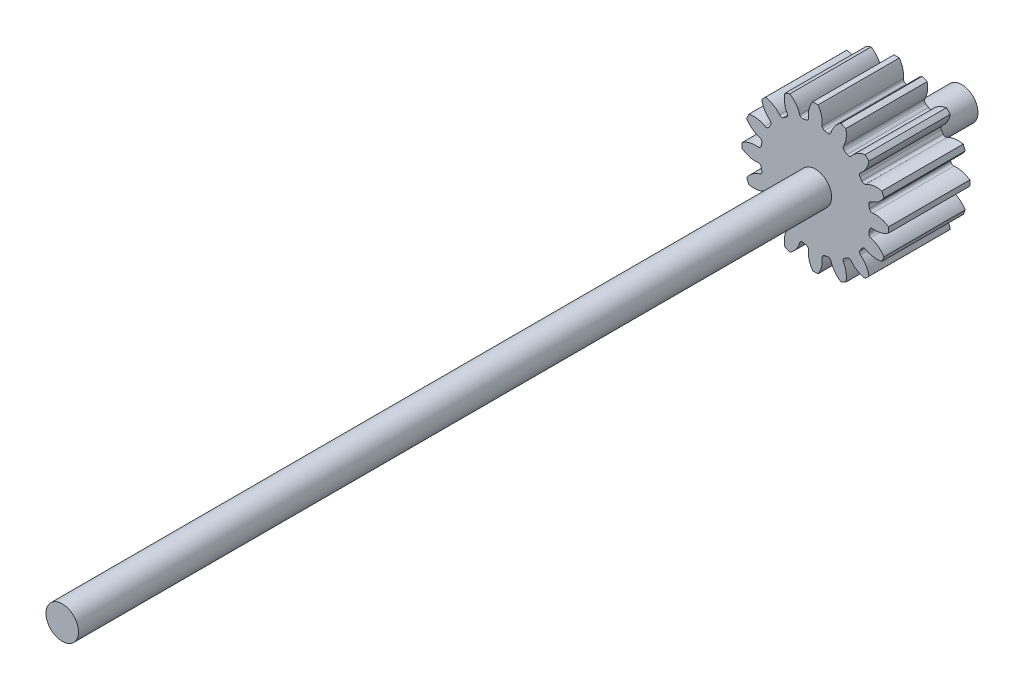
ISO-10303-21;
HEADER;
FILE_DESCRIPTION(('STEP AP214'),'2;1');
FILE_NAME('part.step','',(''),(''),'','','');
FILE_SCHEMA(('AUTOMOTIVE_DESIGN { 1 0 10303 214 1 1 1 1 }'));
ENDSEC;
DATA;
#1=APPLICATION_CONTEXT('core data for automotive mechanical design processes');
#2=APPLICATION_PROTOCOL_DEFINITION('international standard','automotive_design',2000,#1);
#3=PRODUCT_CONTEXT('',#1,'mechanical');
#4=PRODUCT('Part','Part','',(#3));
#5=PRODUCT_RELATED_PRODUCT_CATEGORY('part','',(#4));
#6=PRODUCT_DEFINITION_FORMATION('','',#4);
#7=PRODUCT_DEFINITION_CONTEXT('part definition',#1,'design');
#8=PRODUCT_DEFINITION('design','',#6,#7);
#9=PRODUCT_DEFINITION_SHAPE('','',#8);
#10=(LENGTH_UNIT() NAMED_UNIT(*) SI_UNIT(.MILLI.,.METRE.));
#11=(NAMED_UNIT(*) PLANE_ANGLE_UNIT() SI_UNIT($,.RADIAN.));
#12=(NAMED_UNIT(*) SI_UNIT($,.STERADIAN.) SOLID_ANGLE_UNIT());
#13=UNCERTAINTY_MEASURE_WITH_UNIT(LENGTH_MEASURE(1.E-05),#10,'distance_accuracy_value','');
#14=(GEOMETRIC_REPRESENTATION_CONTEXT(3) GLOBAL_UNCERTAINTY_ASSIGNED_CONTEXT((#13)) GLOBAL_UNIT_ASSIGNED_CONTEXT((#10,
#11,#12)) REPRESENTATION_CONTEXT('',''));
#15=CARTESIAN_POINT('',(0.,0.,0.));
#16=DIRECTION('',(0.,0.,1.));
#17=DIRECTION('',(1.,0.,0.));
#18=AXIS2_PLACEMENT_3D('',#15,#16,#17);
#19=CARTESIAN_POINT('',(0.,0.,9.));
#20=DIRECTION('',(0.,0.,1.));
#21=DIRECTION('',(1.,0.,0.));
#22=AXIS2_PLACEMENT_3D('',#19,#20,#21);
#23=PLANE('',#22);
#24=CARTESIAN_POINT('',(2.34515456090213,3.00306684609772,9.));
#25=DIRECTION('',(0.,0.,1.));
#26=DIRECTION('',(0.923879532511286,-0.382683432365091,0.));
#27=AXIS2_PLACEMENT_3D('',#24,#25,#26);
#28=CIRCLE('',#27,1.44291876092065);
#29=CARTESIAN_POINT('',(1.56717607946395,4.21828865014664,9.));
#30=VERTEX_POINT('',#29);
#31=CARTESIAN_POINT('',(0.961043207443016,3.41080488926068,9.));
#32=VERTEX_POINT('',#31);
#33=EDGE_CURVE('E1006',#30,#32,#28,.T.);
#34=ORIENTED_EDGE('',*,*,#33,.T.);
#35=CARTESIAN_POINT('',(0.793175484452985,3.46025615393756,9.));
#36=DIRECTION('',(0.,0.,1.));
#37=DIRECTION('',(1.,0.,0.));
#38=AXIS2_PLACEMENT_3D('',#35,#36,#37);
#39=CIRCLE('',#38,0.175);
#40=CARTESIAN_POINT('',(0.754075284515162,3.28968014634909,9.));
#41=VERTEX_POINT('',#40);
#42=EDGE_CURVE('E1088',#32,#41,#39,.F.);
#43=ORIENTED_EDGE('',*,*,#42,.T.);
#44=CARTESIAN_POINT('',(0.,0.,9.));
#45=DIRECTION('',(0.,0.,1.));
#46=DIRECTION('',(1.,0.,0.));
#47=AXIS2_PLACEMENT_3D('',#44,#45,#46);
#48=CIRCLE('',#47,3.375);
#49=CARTESIAN_POINT('',(0.56223136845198,3.3278402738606,9.));
#50=VERTEX_POINT('',#49);
#51=EDGE_CURVE('E1026',#41,#50,#48,.T.);
#52=ORIENTED_EDGE('',*,*,#51,.T.);
#53=CARTESIAN_POINT('',(0.591384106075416,3.50039495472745,9.));
#54=DIRECTION('',(0.,0.,1.));
#55=DIRECTION('',(1.,0.,0.));
#56=AXIS2_PLACEMENT_3D('',#53,#54,#55);
#57=CIRCLE('',#56,0.175);
#58=CARTESIAN_POINT('',(0.417370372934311,3.51894813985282,9.));
#59=VERTEX_POINT('',#58);
#60=EDGE_CURVE('E1063',#50,#59,#57,.F.);
#61=ORIENTED_EDGE('',*,*,#60,.T.);
#62=CARTESIAN_POINT('',(-1.01741637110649,3.67192379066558,9.));
#63=DIRECTION('',(0.,0.,-1.));
#64=DIRECTION('',(-1.,0.,0.));
#65=AXIS2_PLACEMENT_3D('',#62,#63,#64);
#66=CIRCLE('',#65,1.44291876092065);
#67=CARTESIAN_POINT('',(0.166387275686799,4.49692286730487,9.));
#68=VERTEX_POINT('',#67);
#69=EDGE_CURVE('E1028',#68,#59,#66,.T.);
#70=ORIENTED_EDGE('',*,*,#69,.F.);
#71=CARTESIAN_POINT('',(0.,0.,9.));
#72=DIRECTION('',(0.,0.,1.));
#73=DIRECTION('',(1.,0.,0.));
#74=AXIS2_PLACEMENT_3D('',#71,#72,#73);
#75=CIRCLE('',#74,4.5);
#76=CARTESIAN_POINT('',(-0.1663872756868,4.49692286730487,9.));
#77=VERTEX_POINT('',#76);
#78=EDGE_CURVE('E1031',#68,#77,#75,.T.);
#79=ORIENTED_EDGE('',*,*,#78,.T.);
#80=CARTESIAN_POINT('',(1.01741637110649,3.67192379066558,9.));
#81=DIRECTION('',(0.,0.,1.));
#82=DIRECTION('',(1.,0.,0.));
#83=AXIS2_PLACEMENT_3D('',#80,#81,#82);
#84=CIRCLE('',#83,1.44291876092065);
#85=CARTESIAN_POINT('',(-0.417370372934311,3.51894813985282,9.));
#86=VERTEX_POINT('',#85);
#87=EDGE_CURVE('E1033',#77,#86,#84,.T.);
#88=ORIENTED_EDGE('',*,*,#87,.T.);
#89=CARTESIAN_POINT('',(-0.591384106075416,3.50039495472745,9.));
#90=DIRECTION('',(0.,0.,1.));
#91=DIRECTION('',(1.,0.,0.));
#92=AXIS2_PLACEMENT_3D('',#89,#90,#91);
#93=CIRCLE('',#92,0.175);
#94=CARTESIAN_POINT('',(-0.56223136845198,3.3278402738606,9.));
#95=VERTEX_POINT('',#94);
#96=EDGE_CURVE('E1067',#86,#95,#93,.F.);
#97=ORIENTED_EDGE('',*,*,#96,.T.);
#98=CARTESIAN_POINT('',(0.,0.,9.));
#99=DIRECTION('',(0.,0.,-1.));
#100=DIRECTION('',(-1.,0.,0.));
#101=AXIS2_PLACEMENT_3D('',#98,#99,#100);
#102=CIRCLE('',#101,3.375);
#103=CARTESIAN_POINT('',(-0.754075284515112,3.2896801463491,9.));
#104=VERTEX_POINT('',#103);
#105=EDGE_CURVE('E1036',#104,#95,#102,.T.);
#106=ORIENTED_EDGE('',*,*,#105,.F.);
#107=CARTESIAN_POINT('',(-0.793175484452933,3.46025615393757,9.));
#108=DIRECTION('',(0.,0.,1.));
#109=DIRECTION('',(1.,0.,0.));
#110=AXIS2_PLACEMENT_3D('',#107,#108,#109);
#111=CIRCLE('',#110,0.175);
#112=CARTESIAN_POINT('',(-0.961043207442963,3.4108048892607,9.));
#113=VERTEX_POINT('',#112);
#114=EDGE_CURVE('E1359',#104,#113,#111,.F.);
#115=ORIENTED_EDGE('',*,*,#114,.T.);
#116=CARTESIAN_POINT('',(-2.34515456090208,3.00306684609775,9.));
#117=DIRECTION('',(0.,0.,-1.));
#118=DIRECTION('',(-0.923879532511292,-0.382683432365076,0.));
#119=AXIS2_PLACEMENT_3D('',#116,#117,#118);
#120=CIRCLE('',#119,1.44291876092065);
#121=CARTESIAN_POINT('',(-1.56717607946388,4.21828865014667,9.));
#122=VERTEX_POINT('',#121);
#123=EDGE_CURVE('E659',#122,#113,#120,.T.);
#124=ORIENTED_EDGE('',*,*,#123,.F.);
#125=CARTESIAN_POINT('',(0.,0.,9.));
#126=DIRECTION('',(0.,0.,1.));
#127=DIRECTION('',(0.923879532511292,0.382683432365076,0.));
#128=AXIS2_PLACEMENT_3D('',#125,#126,#127);
#129=CIRCLE('',#128,4.5);
#130=CARTESIAN_POINT('',(-1.87461967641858,4.09094134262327,9.));
#131=VERTEX_POINT('',#130);
#132=EDGE_CURVE('E631',#122,#131,#129,.T.);
#133=ORIENTED_EDGE('',*,*,#132,.T.);
#134=CARTESIAN_POINT('',(-0.465214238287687,3.78176362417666,9.));
#135=DIRECTION('',(0.,0.,1.));
#136=DIRECTION('',(0.923879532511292,0.382683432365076,0.));
#137=AXIS2_PLACEMENT_3D('',#134,#135,#136);
#138=CIRCLE('',#137,1.44291876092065);
#139=CARTESIAN_POINT('',(-1.73224309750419,3.09136343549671,9.));
#140=VERTEX_POINT('',#139);
#141=EDGE_CURVE('E662',#131,#140,#138,.T.);
#142=ORIENTED_EDGE('',*,*,#141,.T.);
#143=CARTESIAN_POINT('',(-1.88591082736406,3.00763035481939,9.));
#144=DIRECTION('',(0.,0.,1.));
#145=DIRECTION('',(1.,0.,0.));
#146=AXIS2_PLACEMENT_3D('',#143,#144,#145);
#147=CIRCLE('',#146,0.175);
#148=CARTESIAN_POINT('',(-1.79294339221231,2.85936688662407,9.));
#149=VERTEX_POINT('',#148);
#150=EDGE_CURVE('E12',#140,#149,#147,.F.);
#151=ORIENTED_EDGE('',*,*,#150,.T.);
#152=CARTESIAN_POINT('',(0.,0.,9.));
#153=DIRECTION('',(0.,0.,1.));
#154=DIRECTION('',(0.707106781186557,0.707106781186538,0.));
#155=AXIS2_PLACEMENT_3D('',#152,#153,#154);
#156=CIRCLE('',#155,3.375);
#157=CARTESIAN_POINT('',(-1.9555808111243,2.75069603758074,9.));
#158=VERTEX_POINT('',#157);
#159=EDGE_CURVE('E674',#149,#158,#156,.T.);
#160=ORIENTED_EDGE('',*,*,#159,.T.);
#161=CARTESIAN_POINT('',(-2.05698129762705,2.89332472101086,9.));
#162=DIRECTION('',(0.,0.,1.));
#163=DIRECTION('',(1.,0.,0.));
#164=AXIS2_PLACEMENT_3D('',#161,#162,#163);
#165=CIRCLE('',#164,0.175);
#166=CARTESIAN_POINT('',(-2.19314667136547,2.78339751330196,9.));
#167=VERTEX_POINT('',#166);
#168=EDGE_CURVE('E1344',#158,#167,#165,.F.);
#169=ORIENTED_EDGE('',*,*,#168,.T.);
#170=CARTESIAN_POINT('',(-3.31586422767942,1.87702019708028,9.));
#171=DIRECTION('',(0.,0.,-1.));
#172=DIRECTION('',(-0.707106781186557,-0.707106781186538,0.));
#173=AXIS2_PLACEMENT_3D('',#170,#171,#172);
#174=CIRCLE('',#173,1.44291876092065);
#175=CARTESIAN_POINT('',(-3.06215108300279,3.29745822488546,9.));
#176=VERTEX_POINT('',#175);
#177=EDGE_CURVE('E676',#176,#167,#174,.T.);
#178=ORIENTED_EDGE('',*,*,#177,.F.);
#179=CARTESIAN_POINT('',(0.,0.,9.));
#180=DIRECTION('',(0.,0.,1.));
#181=DIRECTION('',(0.707106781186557,0.707106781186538,0.));
#182=AXIS2_PLACEMENT_3D('',#179,#180,#181);
#183=CIRCLE('',#182,4.5);
#184=CARTESIAN_POINT('',(-3.29745822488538,3.06215108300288,9.));
#185=VERTEX_POINT('',#184);
#186=EDGE_CURVE('E679',#176,#185,#183,.T.);
#187=ORIENTED_EDGE('',*,*,#186,.T.);
#188=CARTESIAN_POINT('',(-1.87702019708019,3.31586422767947,9.));
#189=DIRECTION('',(0.,0.,1.));
#190=DIRECTION('',(0.707106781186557,0.707106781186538,0.));
#191=AXIS2_PLACEMENT_3D('',#188,#189,#190);
#192=CIRCLE('',#191,1.44291876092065);
#193=CARTESIAN_POINT('',(-2.7833975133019,2.19314667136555,9.));
#194=VERTEX_POINT('',#193);
#195=EDGE_CURVE('E681',#185,#194,#192,.T.);
#196=ORIENTED_EDGE('',*,*,#195,.T.);
#197=CARTESIAN_POINT('',(-2.8933247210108,2.05698129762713,9.));
#198=DIRECTION('',(0.,0.,1.));
#199=DIRECTION('',(1.,0.,0.));
#200=AXIS2_PLACEMENT_3D('',#197,#198,#199);
#201=CIRCLE('',#200,0.175);
#202=CARTESIAN_POINT('',(-2.75069603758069,1.95558081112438,9.));
#203=VERTEX_POINT('',#202);
#204=EDGE_CURVE('E1348',#194,#203,#201,.F.);
#205=ORIENTED_EDGE('',*,*,#204,.T.);
#206=CARTESIAN_POINT('',(0.,0.,9.));
#207=DIRECTION('',(0.,0.,1.));
#208=DIRECTION('',(0.382683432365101,0.923879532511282,0.));
#209=AXIS2_PLACEMENT_3D('',#206,#207,#208);
#210=CIRCLE('',#209,3.375);
#211=CARTESIAN_POINT('',(-2.85936688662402,1.79294339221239,9.));
#212=VERTEX_POINT('',#211);
#213=EDGE_CURVE('E699',#203,#212,#210,.T.);
#214=ORIENTED_EDGE('',*,*,#213,.T.);
#215=CARTESIAN_POINT('',(-3.00763035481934,1.88591082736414,9.));
#216=DIRECTION('',(0.,0.,1.));
#217=DIRECTION('',(1.,0.,0.));
#218=AXIS2_PLACEMENT_3D('',#215,#216,#217);
#219=CIRCLE('',#218,0.175);
#220=CARTESIAN_POINT('',(-3.09136343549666,1.73224309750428,9.));
#221=VERTEX_POINT('',#220);
#222=EDGE_CURVE('E1324',#212,#221,#219,.F.);
#223=ORIENTED_EDGE('',*,*,#222,.T.);
#224=CARTESIAN_POINT('',(-3.78176362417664,0.465214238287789,9.));
#225=DIRECTION('',(0.,0.,-1.));
#226=DIRECTION('',(-0.382683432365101,-0.923879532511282,0.));
#227=AXIS2_PLACEMENT_3D('',#224,#225,#226);
#228=CIRCLE('',#227,1.44291876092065);
#229=CARTESIAN_POINT('',(-4.09094134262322,1.87461967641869,9.));
#230=VERTEX_POINT('',#229);
#231=EDGE_CURVE('E701',#230,#221,#228,.T.);
#232=ORIENTED_EDGE('',*,*,#231,.F.);
#233=CARTESIAN_POINT('',(0.,0.,9.));
#234=DIRECTION('',(0.,0.,1.));
#235=DIRECTION('',(0.382683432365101,0.923879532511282,0.));
#236=AXIS2_PLACEMENT_3D('',#233,#234,#235);
#237=CIRCLE('',#236,4.5);
#238=CARTESIAN_POINT('',(-4.21828865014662,1.567176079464,9.));
#239=VERTEX_POINT('',#238);
#240=EDGE_CURVE('E704',#230,#239,#237,.T.);
#241=ORIENTED_EDGE('',*,*,#240,.T.);
#242=CARTESIAN_POINT('',(-3.00306684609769,2.34515456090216,9.));
#243=DIRECTION('',(0.,0.,1.));
#244=DIRECTION('',(0.382683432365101,0.923879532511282,0.));
#245=AXIS2_PLACEMENT_3D('',#242,#243,#244);
#246=CIRCLE('',#245,1.44291876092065);
#247=CARTESIAN_POINT('',(-3.41080488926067,0.961043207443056,9.));
#248=VERTEX_POINT('',#247);
#249=EDGE_CURVE('E706',#239,#248,#246,.T.);
#250=ORIENTED_EDGE('',*,*,#249,.T.);
#251=CARTESIAN_POINT('',(-3.46025615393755,0.793175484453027,9.));
#252=DIRECTION('',(0.,0.,1.));
#253=DIRECTION('',(1.,0.,0.));
#254=AXIS2_PLACEMENT_3D('',#251,#252,#253);
#255=CIRCLE('',#254,0.175);
#256=CARTESIAN_POINT('',(-3.28968014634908,0.754075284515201,9.));
#257=VERTEX_POINT('',#256);
#258=EDGE_CURVE('E1328',#248,#257,#255,.F.);
#259=ORIENTED_EDGE('',*,*,#258,.T.);
#260=CARTESIAN_POINT('',(0.,0.,9.));
#261=DIRECTION('',(0.,0.,1.));
#262=DIRECTION('',(0.,1.,0.));
#263=AXIS2_PLACEMENT_3D('',#260,#261,#262);
#264=CIRCLE('',#263,3.375);
#265=CARTESIAN_POINT('',(-3.3278402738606,0.562231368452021,9.));
#266=VERTEX_POINT('',#265);
#267=EDGE_CURVE('E724',#257,#266,#264,.T.);
#268=ORIENTED_EDGE('',*,*,#267,.T.);
#269=CARTESIAN_POINT('',(-3.50039495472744,0.591384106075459,9.));
#270=DIRECTION('',(0.,0.,1.));
#271=DIRECTION('',(1.,0.,0.));
#272=AXIS2_PLACEMENT_3D('',#269,#270,#271);
#273=CIRCLE('',#272,0.175);
#274=CARTESIAN_POINT('',(-3.51894813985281,0.417370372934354,9.));
#275=VERTEX_POINT('',#274);
#276=EDGE_CURVE('E1304',#266,#275,#273,.F.);
#277=ORIENTED_EDGE('',*,*,#276,.T.);
#278=CARTESIAN_POINT('',(-3.67192379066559,-1.01741637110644,9.));
#279=DIRECTION('',(0.,0.,-1.));
#280=DIRECTION('',(0.,-1.,0.));
#281=AXIS2_PLACEMENT_3D('',#278,#279,#280);
#282=CIRCLE('',#281,1.44291876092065);
#283=CARTESIAN_POINT('',(-4.49692286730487,0.166387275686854,9.));
#284=VERTEX_POINT('',#283);
#285=EDGE_CURVE('E726',#284,#275,#282,.T.);
#286=ORIENTED_EDGE('',*,*,#285,.F.);
#287=CARTESIAN_POINT('',(0.,0.,9.));
#288=DIRECTION('',(0.,0.,1.));
#289=DIRECTION('',(0.,1.,0.));
#290=AXIS2_PLACEMENT_3D('',#287,#288,#289);
#291=CIRCLE('',#290,4.5);
#292=CARTESIAN_POINT('',(-4.49692286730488,-0.166387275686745,9.));
#293=VERTEX_POINT('',#292);
#294=EDGE_CURVE('E729',#284,#293,#291,.T.);
#295=ORIENTED_EDGE('',*,*,#294,.T.);
#296=CARTESIAN_POINT('',(-3.67192379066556,1.01741637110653,9.));
#297=DIRECTION('',(0.,0.,1.));
#298=DIRECTION('',(0.,1.,0.));
#299=AXIS2_PLACEMENT_3D('',#296,#297,#298);
#300=CIRCLE('',#299,1.44291876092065);
#301=CARTESIAN_POINT('',(-3.51894813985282,-0.417370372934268,9.));
#302=VERTEX_POINT('',#301);
#303=EDGE_CURVE('E731',#293,#302,#300,.T.);
#304=ORIENTED_EDGE('',*,*,#303,.T.);
#305=CARTESIAN_POINT('',(-3.50039495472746,-0.591384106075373,9.));
#306=DIRECTION('',(0.,0.,1.));
#307=DIRECTION('',(1.,0.,0.));
#308=AXIS2_PLACEMENT_3D('',#305,#306,#307);
#309=CIRCLE('',#308,0.175);
#310=CARTESIAN_POINT('',(-3.32784027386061,-0.562231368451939,9.));
#311=VERTEX_POINT('',#310);
#312=EDGE_CURVE('E1308',#302,#311,#309,.F.);
#313=ORIENTED_EDGE('',*,*,#312,.T.);
#314=CARTESIAN_POINT('',(0.,0.,9.));
#315=DIRECTION('',(0.,0.,1.));
#316=DIRECTION('',(-0.38268343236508,0.923879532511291,0.));
#317=AXIS2_PLACEMENT_3D('',#314,#315,#316);
#318=CIRCLE('',#317,3.375);
#319=CARTESIAN_POINT('',(-3.2896801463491,-0.754075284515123,9.));
#320=VERTEX_POINT('',#319);
#321=EDGE_CURVE('E749',#311,#320,#318,.T.);
#322=ORIENTED_EDGE('',*,*,#321,.T.);
#323=CARTESIAN_POINT('',(-3.46025615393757,-0.793175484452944,9.));
#324=DIRECTION('',(0.,0.,1.));
#325=DIRECTION('',(1.,0.,0.));
#326=AXIS2_PLACEMENT_3D('',#323,#324,#325);
#327=CIRCLE('',#326,0.175);
#328=CARTESIAN_POINT('',(-3.4108048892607,-0.961043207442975,9.));
#329=VERTEX_POINT('',#328);
#330=EDGE_CURVE('E1284',#320,#329,#327,.F.);
#331=ORIENTED_EDGE('',*,*,#330,.T.);
#332=CARTESIAN_POINT('',(-3.00306684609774,-2.34515456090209,9.));
#333=DIRECTION('',(0.,0.,-1.));
#334=DIRECTION('',(0.38268343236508,-0.923879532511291,0.));
#335=AXIS2_PLACEMENT_3D('',#332,#333,#334);
#336=CIRCLE('',#335,1.44291876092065);
#337=CARTESIAN_POINT('',(-4.21828865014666,-1.5671760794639,9.));
#338=VERTEX_POINT('',#337);
#339=EDGE_CURVE('E751',#338,#329,#336,.T.);
#340=ORIENTED_EDGE('',*,*,#339,.F.);
#341=CARTESIAN_POINT('',(0.,0.,9.));
#342=DIRECTION('',(0.,0.,1.));
#343=DIRECTION('',(-0.38268343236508,0.923879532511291,0.));
#344=AXIS2_PLACEMENT_3D('',#341,#342,#343);
#345=CIRCLE('',#344,4.5);
#346=CARTESIAN_POINT('',(-4.09094134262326,-1.87461967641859,9.));
#347=VERTEX_POINT('',#346);
#348=EDGE_CURVE('E754',#338,#347,#345,.T.);
#349=ORIENTED_EDGE('',*,*,#348,.T.);
#350=CARTESIAN_POINT('',(-3.78176362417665,-0.4652142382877,9.));
#351=DIRECTION('',(0.,0.,1.));
#352=DIRECTION('',(-0.38268343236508,0.923879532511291,0.));
#353=AXIS2_PLACEMENT_3D('',#350,#351,#352);
#354=CIRCLE('',#353,1.44291876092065);
#355=CARTESIAN_POINT('',(-3.0913634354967,-1.7322430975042,9.));
#356=VERTEX_POINT('',#355);
#357=EDGE_CURVE('E756',#347,#356,#354,.T.);
#358=ORIENTED_EDGE('',*,*,#357,.T.);
#359=CARTESIAN_POINT('',(-3.00763035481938,-1.88591082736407,9.));
#360=DIRECTION('',(0.,0.,1.));
#361=DIRECTION('',(1.,0.,0.));
#362=AXIS2_PLACEMENT_3D('',#359,#360,#361);
#363=CIRCLE('',#362,0.175);
#364=CARTESIAN_POINT('',(-2.85936688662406,-1.79294339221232,9.));
#365=VERTEX_POINT('',#364);
#366=EDGE_CURVE('E1288',#356,#365,#363,.F.);
#367=ORIENTED_EDGE('',*,*,#366,.T.);
#368=CARTESIAN_POINT('',(0.,0.,9.));
#369=DIRECTION('',(0.,0.,1.));
#370=DIRECTION('',(-0.707106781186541,0.707106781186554,0.));
#371=AXIS2_PLACEMENT_3D('',#368,#369,#370);
#372=CIRCLE('',#371,3.375);
#373=CARTESIAN_POINT('',(-2.75069603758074,-1.95558081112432,9.));
#374=VERTEX_POINT('',#373);
#375=EDGE_CURVE('E774',#365,#374,#372,.T.);
#376=ORIENTED_EDGE('',*,*,#375,.T.);
#377=CARTESIAN_POINT('',(-2.89332472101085,-2.05698129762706,9.));
#378=DIRECTION('',(0.,0.,1.));
#379=DIRECTION('',(1.,0.,0.));
#380=AXIS2_PLACEMENT_3D('',#377,#378,#379);
#381=CIRCLE('',#380,0.175);
#382=CARTESIAN_POINT('',(-2.78339751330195,-2.19314667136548,9.));
#383=VERTEX_POINT('',#382);
#384=EDGE_CURVE('E1264',#374,#383,#381,.F.);
#385=ORIENTED_EDGE('',*,*,#384,.T.);
#386=CARTESIAN_POINT('',(-1.87702019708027,-3.31586422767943,9.));
#387=DIRECTION('',(0.,0.,-1.));
#388=DIRECTION('',(0.707106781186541,-0.707106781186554,0.));
#389=AXIS2_PLACEMENT_3D('',#386,#387,#388);
#390=CIRCLE('',#389,1.44291876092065);
#391=CARTESIAN_POINT('',(-3.29745822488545,-3.06215108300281,9.));
#392=VERTEX_POINT('',#391);
#393=EDGE_CURVE('E776',#392,#383,#390,.T.);
#394=ORIENTED_EDGE('',*,*,#393,.F.);
#395=CARTESIAN_POINT('',(0.,0.,9.));
#396=DIRECTION('',(0.,0.,1.));
#397=DIRECTION('',(-0.707106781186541,0.707106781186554,0.));
#398=AXIS2_PLACEMENT_3D('',#395,#396,#397);
#399=CIRCLE('',#398,4.5);
#400=CARTESIAN_POINT('',(-3.06215108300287,-3.29745822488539,9.));
#401=VERTEX_POINT('',#400);
#402=EDGE_CURVE('E779',#392,#401,#399,.T.);
#403=ORIENTED_EDGE('',*,*,#402,.T.);
#404=CARTESIAN_POINT('',(-3.31586422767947,-1.8770201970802,9.));
#405=DIRECTION('',(0.,0.,1.));
#406=DIRECTION('',(-0.707106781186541,0.707106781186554,0.));
#407=AXIS2_PLACEMENT_3D('',#404,#405,#406);
#408=CIRCLE('',#407,1.44291876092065);
#409=CARTESIAN_POINT('',(-2.19314667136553,-2.7833975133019,9.));
#410=VERTEX_POINT('',#409);
#411=EDGE_CURVE('E781',#401,#410,#408,.T.);
#412=ORIENTED_EDGE('',*,*,#411,.T.);
#413=CARTESIAN_POINT('',(-2.05698129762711,-2.89332472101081,9.));
#414=DIRECTION('',(0.,0.,1.));
#415=DIRECTION('',(1.,0.,0.));
#416=AXIS2_PLACEMENT_3D('',#413,#414,#415);
#417=CIRCLE('',#416,0.175);
#418=CARTESIAN_POINT('',(-1.95558081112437,-2.7506960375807,9.));
#419=VERTEX_POINT('',#418);
#420=EDGE_CURVE('E1268',#410,#419,#417,.F.);
#421=ORIENTED_EDGE('',*,*,#420,.T.);
#422=CARTESIAN_POINT('',(0.,0.,9.));
#423=DIRECTION('',(0.,0.,1.));
#424=DIRECTION('',(-0.923879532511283,0.382683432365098,0.));
#425=AXIS2_PLACEMENT_3D('',#422,#423,#424);
#426=CIRCLE('',#425,3.375);
#427=CARTESIAN_POINT('',(-1.79294339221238,-2.85936688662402,9.));
#428=VERTEX_POINT('',#427);
#429=EDGE_CURVE('E799',#419,#428,#426,.T.);
#430=ORIENTED_EDGE('',*,*,#429,.T.);
#431=CARTESIAN_POINT('',(-1.88591082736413,-3.00763035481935,9.));
#432=DIRECTION('',(0.,0.,1.));
#433=DIRECTION('',(1.,0.,0.));
#434=AXIS2_PLACEMENT_3D('',#431,#432,#433);
#435=CIRCLE('',#434,0.175);
#436=CARTESIAN_POINT('',(-1.73224309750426,-3.09136343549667,9.));
#437=VERTEX_POINT('',#436);
#438=EDGE_CURVE('E1244',#428,#437,#435,.F.);
#439=ORIENTED_EDGE('',*,*,#438,.T.);
#440=CARTESIAN_POINT('',(-0.465214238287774,-3.78176362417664,9.));
#441=DIRECTION('',(0.,0.,-1.));
#442=DIRECTION('',(0.923879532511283,-0.382683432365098,0.));
#443=AXIS2_PLACEMENT_3D('',#440,#441,#442);
#444=CIRCLE('',#443,1.44291876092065);
#445=CARTESIAN_POINT('',(-1.87461967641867,-4.09094134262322,9.));
#446=VERTEX_POINT('',#445);
#447=EDGE_CURVE('E801',#446,#437,#444,.T.);
#448=ORIENTED_EDGE('',*,*,#447,.F.);
#449=CARTESIAN_POINT('',(0.,0.,9.));
#450=DIRECTION('',(0.,0.,1.));
#451=DIRECTION('',(-0.923879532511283,0.382683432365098,0.));
#452=AXIS2_PLACEMENT_3D('',#449,#450,#451);
#453=CIRCLE('',#452,4.5);
#454=CARTESIAN_POINT('',(-1.56717607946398,-4.21828865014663,9.));
#455=VERTEX_POINT('',#454);
#456=EDGE_CURVE('E804',#446,#455,#453,.T.);
#457=ORIENTED_EDGE('',*,*,#456,.T.);
#458=CARTESIAN_POINT('',(-2.34515456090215,-3.0030668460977,9.));
#459=DIRECTION('',(0.,0.,1.));
#460=DIRECTION('',(-0.923879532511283,0.382683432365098,0.));
#461=AXIS2_PLACEMENT_3D('',#458,#459,#460);
#462=CIRCLE('',#461,1.44291876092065);
#463=CARTESIAN_POINT('',(-0.961043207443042,-3.41080488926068,9.));
#464=VERTEX_POINT('',#463);
#465=EDGE_CURVE('E806',#455,#464,#462,.T.);
#466=ORIENTED_EDGE('',*,*,#465,.T.);
#467=CARTESIAN_POINT('',(-0.793175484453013,-3.46025615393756,9.));
#468=DIRECTION('',(0.,0.,1.));
#469=DIRECTION('',(1.,0.,0.));
#470=AXIS2_PLACEMENT_3D('',#467,#468,#469);
#471=CIRCLE('',#470,0.175);
#472=CARTESIAN_POINT('',(-0.754075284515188,-3.28968014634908,9.));
#473=VERTEX_POINT('',#472);
#474=EDGE_CURVE('E1248',#464,#473,#471,.F.);
#475=ORIENTED_EDGE('',*,*,#474,.T.);
#476=CARTESIAN_POINT('',(0.,0.,9.));
#477=DIRECTION('',(0.,0.,1.));
#478=DIRECTION('',(-1.,0.,0.));
#479=AXIS2_PLACEMENT_3D('',#476,#477,#478);
#480=CIRCLE('',#479,3.375);
#481=CARTESIAN_POINT('',(-0.562231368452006,-3.3278402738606,9.));
#482=VERTEX_POINT('',#481);
#483=EDGE_CURVE('E824',#473,#482,#480,.T.);
#484=ORIENTED_EDGE('',*,*,#483,.T.);
#485=CARTESIAN_POINT('',(-0.591384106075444,-3.50039495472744,9.));
#486=DIRECTION('',(0.,0.,1.));
#487=DIRECTION('',(1.,0.,0.));
#488=AXIS2_PLACEMENT_3D('',#485,#486,#487);
#489=CIRCLE('',#488,0.175);
#490=CARTESIAN_POINT('',(-0.417370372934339,-3.51894813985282,9.));
#491=VERTEX_POINT('',#490);
#492=EDGE_CURVE('E1224',#482,#491,#489,.F.);
#493=ORIENTED_EDGE('',*,*,#492,.T.);
#494=CARTESIAN_POINT('',(1.01741637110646,-3.67192379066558,9.));
#495=DIRECTION('',(0.,0.,-1.));
#496=DIRECTION('',(1.,0.,0.));
#497=AXIS2_PLACEMENT_3D('',#494,#495,#496);
#498=CIRCLE('',#497,1.44291876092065);
#499=CARTESIAN_POINT('',(-0.166387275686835,-4.49692286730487,9.));
#500=VERTEX_POINT('',#499);
#501=EDGE_CURVE('E826',#500,#491,#498,.T.);
#502=ORIENTED_EDGE('',*,*,#501,.F.);
#503=CARTESIAN_POINT('',(0.,0.,9.));
#504=DIRECTION('',(0.,0.,1.));
#505=DIRECTION('',(-1.,0.,0.));
#506=AXIS2_PLACEMENT_3D('',#503,#504,#505);
#507=CIRCLE('',#506,4.5);
#508=CARTESIAN_POINT('',(0.166387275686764,-4.49692286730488,9.));
#509=VERTEX_POINT('',#508);
#510=EDGE_CURVE('E829',#500,#509,#507,.T.);
#511=ORIENTED_EDGE('',*,*,#510,.T.);
#512=CARTESIAN_POINT('',(-1.01741637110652,-3.67192379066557,9.));
#513=DIRECTION('',(0.,0.,1.));
#514=DIRECTION('',(-1.,0.,0.));
#515=AXIS2_PLACEMENT_3D('',#512,#513,#514);
#516=CIRCLE('',#515,1.44291876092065);
#517=CARTESIAN_POINT('',(0.417370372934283,-3.51894813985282,9.));
#518=VERTEX_POINT('',#517);
#519=EDGE_CURVE('E831',#509,#518,#516,.T.);
#520=ORIENTED_EDGE('',*,*,#519,.T.);
#521=CARTESIAN_POINT('',(0.591384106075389,-3.50039495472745,9.));
#522=DIRECTION('',(0.,0.,1.));
#523=DIRECTION('',(1.,0.,0.));
#524=AXIS2_PLACEMENT_3D('',#521,#522,#523);
#525=CIRCLE('',#524,0.175);
#526=CARTESIAN_POINT('',(0.562231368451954,-3.32784027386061,9.));
#527=VERTEX_POINT('',#526);
#528=EDGE_CURVE('E1228',#518,#527,#525,.F.);
#529=ORIENTED_EDGE('',*,*,#528,.T.);
#530=CARTESIAN_POINT('',(0.,0.,9.));
#531=DIRECTION('',(0.,0.,1.));
#532=DIRECTION('',(-0.923879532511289,-0.382683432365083,0.));
#533=AXIS2_PLACEMENT_3D('',#530,#531,#532);
#534=CIRCLE('',#533,3.375);
#535=CARTESIAN_POINT('',(0.754075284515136,-3.2896801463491,9.));
#536=VERTEX_POINT('',#535);
#537=EDGE_CURVE('E849',#527,#536,#534,.T.);
#538=ORIENTED_EDGE('',*,*,#537,.T.);
#539=CARTESIAN_POINT('',(0.793175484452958,-3.46025615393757,9.));
#540=DIRECTION('',(0.,0.,1.));
#541=DIRECTION('',(1.,0.,0.));
#542=AXIS2_PLACEMENT_3D('',#539,#540,#541);
#543=CIRCLE('',#542,0.175);
#544=CARTESIAN_POINT('',(0.961043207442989,-3.41080488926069,9.));
#545=VERTEX_POINT('',#544);
#546=EDGE_CURVE('E1204',#536,#545,#543,.F.);
#547=ORIENTED_EDGE('',*,*,#546,.T.);
#548=CARTESIAN_POINT('',(2.34515456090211,-3.00306684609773,9.));
#549=DIRECTION('',(0.,0.,-1.));
#550=DIRECTION('',(0.923879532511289,0.382683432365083,0.));
#551=AXIS2_PLACEMENT_3D('',#548,#549,#550);
#552=CIRCLE('',#551,1.44291876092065);
#553=CARTESIAN_POINT('',(1.56717607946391,-4.21828865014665,9.));
#554=VERTEX_POINT('',#553);
#555=EDGE_CURVE('E851',#554,#545,#552,.T.);
#556=ORIENTED_EDGE('',*,*,#555,.F.);
#557=CARTESIAN_POINT('',(0.,0.,9.));
#558=DIRECTION('',(0.,0.,1.));
#559=DIRECTION('',(-0.923879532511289,-0.382683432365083,0.));
#560=AXIS2_PLACEMENT_3D('',#557,#558,#559);
#561=CIRCLE('',#560,4.5);
#562=CARTESIAN_POINT('',(1.87461967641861,-4.09094134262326,9.));
#563=VERTEX_POINT('',#562);
#564=EDGE_CURVE('E854',#554,#563,#561,.T.);
#565=ORIENTED_EDGE('',*,*,#564,.T.);
#566=CARTESIAN_POINT('',(0.465214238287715,-3.78176362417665,9.));
#567=DIRECTION('',(0.,0.,1.));
#568=DIRECTION('',(-0.923879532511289,-0.382683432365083,0.));
#569=AXIS2_PLACEMENT_3D('',#566,#567,#568);
#570=CIRCLE('',#569,1.44291876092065);
#571=CARTESIAN_POINT('',(1.73224309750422,-3.0913634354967,9.));
#572=VERTEX_POINT('',#571);
#573=EDGE_CURVE('E856',#563,#572,#570,.T.);
#574=ORIENTED_EDGE('',*,*,#573,.T.);
#575=CARTESIAN_POINT('',(1.88591082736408,-3.00763035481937,9.));
#576=DIRECTION('',(0.,0.,1.));
#577=DIRECTION('',(1.,0.,0.));
#578=AXIS2_PLACEMENT_3D('',#575,#576,#577);
#579=CIRCLE('',#578,0.175);
#580=CARTESIAN_POINT('',(1.79294339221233,-2.85936688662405,9.));
#581=VERTEX_POINT('',#580);
#582=EDGE_CURVE('E1208',#572,#581,#579,.F.);
#583=ORIENTED_EDGE('',*,*,#582,.T.);
#584=CARTESIAN_POINT('',(0.,0.,9.));
#585=DIRECTION('',(0.,0.,1.));
#586=DIRECTION('',(-0.707106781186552,-0.707106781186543,0.));
#587=AXIS2_PLACEMENT_3D('',#584,#585,#586);
#588=CIRCLE('',#587,3.375);
#589=CARTESIAN_POINT('',(1.95558081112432,-2.75069603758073,9.));
#590=VERTEX_POINT('',#589);
#591=EDGE_CURVE('E874',#581,#590,#588,.T.);
#592=ORIENTED_EDGE('',*,*,#591,.T.);
#593=CARTESIAN_POINT('',(2.05698129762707,-2.89332472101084,9.));
#594=DIRECTION('',(0.,0.,1.));
#595=DIRECTION('',(1.,0.,0.));
#596=AXIS2_PLACEMENT_3D('',#593,#594,#595);
#597=CIRCLE('',#596,0.175);
#598=CARTESIAN_POINT('',(2.19314667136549,-2.78339751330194,9.));
#599=VERTEX_POINT('',#598);
#600=EDGE_CURVE('E1184',#590,#599,#597,.F.);
#601=ORIENTED_EDGE('',*,*,#600,.T.);
#602=CARTESIAN_POINT('',(3.31586422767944,-1.87702019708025,9.));
#603=DIRECTION('',(0.,0.,-1.));
#604=DIRECTION('',(0.707106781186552,0.707106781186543,0.));
#605=AXIS2_PLACEMENT_3D('',#602,#603,#604);
#606=CIRCLE('',#605,1.44291876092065);
#607=CARTESIAN_POINT('',(3.06215108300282,-3.29745822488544,9.));
#608=VERTEX_POINT('',#607);
#609=EDGE_CURVE('E876',#608,#599,#606,.T.);
#610=ORIENTED_EDGE('',*,*,#609,.F.);
#611=CARTESIAN_POINT('',(0.,0.,9.));
#612=DIRECTION('',(0.,0.,1.));
#613=DIRECTION('',(-0.707106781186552,-0.707106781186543,0.));
#614=AXIS2_PLACEMENT_3D('',#611,#612,#613);
#615=CIRCLE('',#614,4.5);
#616=CARTESIAN_POINT('',(3.2974582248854,-3.06215108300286,9.));
#617=VERTEX_POINT('',#616);
#618=EDGE_CURVE('E879',#608,#617,#615,.T.);
#619=ORIENTED_EDGE('',*,*,#618,.T.);
#620=CARTESIAN_POINT('',(1.87702019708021,-3.31586422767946,9.));
#621=DIRECTION('',(0.,0.,1.));
#622=DIRECTION('',(-0.707106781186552,-0.707106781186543,0.));
#623=AXIS2_PLACEMENT_3D('',#620,#621,#622);
#624=CIRCLE('',#623,1.44291876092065);
#625=CARTESIAN_POINT('',(2.78339751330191,-2.19314667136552,9.));
#626=VERTEX_POINT('',#625);
#627=EDGE_CURVE('E881',#617,#626,#624,.T.);
#628=ORIENTED_EDGE('',*,*,#627,.T.);
#629=CARTESIAN_POINT('',(2.89332472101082,-2.0569812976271,9.));
#630=DIRECTION('',(0.,0.,1.));
#631=DIRECTION('',(1.,0.,0.));
#632=AXIS2_PLACEMENT_3D('',#629,#630,#631);
#633=CIRCLE('',#632,0.175);
#634=CARTESIAN_POINT('',(2.7506960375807,-1.95558081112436,9.));
#635=VERTEX_POINT('',#634);
#636=EDGE_CURVE('E1188',#626,#635,#633,.F.);
#637=ORIENTED_EDGE('',*,*,#636,.T.);
#638=CARTESIAN_POINT('',(0.,0.,9.));
#639=DIRECTION('',(0.,0.,1.));
#640=DIRECTION('',(-0.382683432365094,-0.923879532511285,0.));
#641=AXIS2_PLACEMENT_3D('',#638,#639,#640);
#642=CIRCLE('',#641,3.375);
#643=CARTESIAN_POINT('',(2.85936688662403,-1.79294339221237,9.));
#644=VERTEX_POINT('',#643);
#645=EDGE_CURVE('E899',#635,#644,#642,.T.);
#646=ORIENTED_EDGE('',*,*,#645,.T.);
#647=CARTESIAN_POINT('',(3.00763035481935,-1.88591082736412,9.));
#648=DIRECTION('',(0.,0.,1.));
#649=DIRECTION('',(1.,0.,0.));
#650=AXIS2_PLACEMENT_3D('',#647,#648,#649);
#651=CIRCLE('',#650,0.175);
#652=CARTESIAN_POINT('',(3.09136343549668,-1.73224309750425,9.));
#653=VERTEX_POINT('',#652);
#654=EDGE_CURVE('E1164',#644,#653,#651,.F.);
#655=ORIENTED_EDGE('',*,*,#654,.T.);
#656=CARTESIAN_POINT('',(3.78176362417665,-0.465214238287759,9.));
#657=DIRECTION('',(0.,0.,-1.));
#658=DIRECTION('',(0.382683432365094,0.923879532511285,0.));
#659=AXIS2_PLACEMENT_3D('',#656,#657,#658);
#660=CIRCLE('',#659,1.44291876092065);
#661=CARTESIAN_POINT('',(4.09094134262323,-1.87461967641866,9.));
#662=VERTEX_POINT('',#661);
#663=EDGE_CURVE('E901',#662,#653,#660,.T.);
#664=ORIENTED_EDGE('',*,*,#663,.F.);
#665=CARTESIAN_POINT('',(0.,0.,9.));
#666=DIRECTION('',(0.,0.,1.));
#667=DIRECTION('',(-0.382683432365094,-0.923879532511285,0.));
#668=AXIS2_PLACEMENT_3D('',#665,#666,#667);
#669=CIRCLE('',#668,4.5);
#670=CARTESIAN_POINT('',(4.21828865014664,-1.56717607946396,9.));
#671=VERTEX_POINT('',#670);
#672=EDGE_CURVE('E904',#662,#671,#669,.T.);
#673=ORIENTED_EDGE('',*,*,#672,.T.);
#674=CARTESIAN_POINT('',(3.00306684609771,-2.34515456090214,9.));
#675=DIRECTION('',(0.,0.,1.));
#676=DIRECTION('',(-0.382683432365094,-0.923879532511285,0.));
#677=AXIS2_PLACEMENT_3D('',#674,#675,#676);
#678=CIRCLE('',#677,1.44291876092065);
#679=CARTESIAN_POINT('',(3.41080488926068,-0.961043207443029,9.));
#680=VERTEX_POINT('',#679);
#681=EDGE_CURVE('E906',#671,#680,#678,.T.);
#682=ORIENTED_EDGE('',*,*,#681,.T.);
#683=CARTESIAN_POINT('',(3.46025615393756,-0.793175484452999,9.));
#684=DIRECTION('',(0.,0.,1.));
#685=DIRECTION('',(1.,0.,0.));
#686=AXIS2_PLACEMENT_3D('',#683,#684,#685);
#687=CIRCLE('',#686,0.175);
#688=CARTESIAN_POINT('',(3.28968014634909,-0.754075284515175,9.));
#689=VERTEX_POINT('',#688);
#690=EDGE_CURVE('E1168',#680,#689,#687,.F.);
#691=ORIENTED_EDGE('',*,*,#690,.T.);
#692=CARTESIAN_POINT('',(0.,0.,9.));
#693=DIRECTION('',(0.,0.,1.));
#694=DIRECTION('',(0.,-1.,0.));
#695=AXIS2_PLACEMENT_3D('',#692,#693,#694);
#696=CIRCLE('',#695,3.375);
#697=CARTESIAN_POINT('',(3.3278402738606,-0.562231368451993,9.));
#698=VERTEX_POINT('',#697);
#699=EDGE_CURVE('E924',#689,#698,#696,.T.);
#700=ORIENTED_EDGE('',*,*,#699,.T.);
#701=CARTESIAN_POINT('',(3.50039495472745,-0.59138410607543,9.));
#702=DIRECTION('',(0.,0.,1.));
#703=DIRECTION('',(1.,0.,0.));
#704=AXIS2_PLACEMENT_3D('',#701,#702,#703);
#705=CIRCLE('',#704,0.175);
#706=CARTESIAN_POINT('',(3.51894813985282,-0.417370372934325,9.));
#707=VERTEX_POINT('',#706);
#708=EDGE_CURVE('E1144',#698,#707,#705,.F.);
#709=ORIENTED_EDGE('',*,*,#708,.T.);
#710=CARTESIAN_POINT('',(3.67192379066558,1.01741637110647,9.));
#711=DIRECTION('',(0.,0.,-1.));
#712=DIRECTION('',(0.,1.,0.));
#713=AXIS2_PLACEMENT_3D('',#710,#711,#712);
#714=CIRCLE('',#713,1.44291876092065);
#715=CARTESIAN_POINT('',(4.49692286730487,-0.166387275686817,9.));
#716=VERTEX_POINT('',#715);
#717=EDGE_CURVE('E926',#716,#707,#714,.T.);
#718=ORIENTED_EDGE('',*,*,#717,.F.);
#719=CARTESIAN_POINT('',(0.,0.,9.));
#720=DIRECTION('',(0.,0.,1.));
#721=DIRECTION('',(0.,-1.,0.));
#722=AXIS2_PLACEMENT_3D('',#719,#720,#721);
#723=CIRCLE('',#722,4.5);
#724=CARTESIAN_POINT('',(4.49692286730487,0.166387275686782,9.));
#725=VERTEX_POINT('',#724);
#726=EDGE_CURVE('E929',#716,#725,#723,.T.);
#727=ORIENTED_EDGE('',*,*,#726,.T.);
#728=CARTESIAN_POINT('',(3.67192379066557,-1.0174163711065,9.));
#729=DIRECTION('',(0.,0.,1.));
#730=DIRECTION('',(0.,-1.,0.));
#731=AXIS2_PLACEMENT_3D('',#728,#729,#730);
#732=CIRCLE('',#731,1.44291876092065);
#733=CARTESIAN_POINT('',(3.51894813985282,0.417370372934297,9.));
#734=VERTEX_POINT('',#733);
#735=EDGE_CURVE('E931',#725,#734,#732,.T.);
#736=ORIENTED_EDGE('',*,*,#735,.T.);
#737=CARTESIAN_POINT('',(3.50039495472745,0.591384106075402,9.));
#738=DIRECTION('',(0.,0.,1.));
#739=DIRECTION('',(1.,0.,0.));
#740=AXIS2_PLACEMENT_3D('',#737,#738,#739);
#741=CIRCLE('',#740,0.175);
#742=CARTESIAN_POINT('',(3.3278402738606,0.562231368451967,9.));
#743=VERTEX_POINT('',#742);
#744=EDGE_CURVE('E1148',#734,#743,#741,.F.);
#745=ORIENTED_EDGE('',*,*,#744,.T.);
#746=CARTESIAN_POINT('',(0.,0.,9.));
#747=DIRECTION('',(0.,0.,1.));
#748=DIRECTION('',(0.382683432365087,-0.923879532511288,0.));
#749=AXIS2_PLACEMENT_3D('',#746,#747,#748);
#750=CIRCLE('',#749,3.375);
#751=CARTESIAN_POINT('',(3.28968014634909,0.754075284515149,9.));
#752=VERTEX_POINT('',#751);
#753=EDGE_CURVE('E949',#743,#752,#750,.T.);
#754=ORIENTED_EDGE('',*,*,#753,.T.);
#755=CARTESIAN_POINT('',(3.46025615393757,0.793175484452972,9.));
#756=DIRECTION('',(0.,0.,1.));
#757=DIRECTION('',(1.,0.,0.));
#758=AXIS2_PLACEMENT_3D('',#755,#756,#757);
#759=CIRCLE('',#758,0.175);
#760=CARTESIAN_POINT('',(3.41080488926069,0.961043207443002,9.));
#761=VERTEX_POINT('',#760);
#762=EDGE_CURVE('E1124',#752,#761,#759,.F.);
#763=ORIENTED_EDGE('',*,*,#762,.T.);
#764=CARTESIAN_POINT('',(3.00306684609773,2.34515456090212,9.));
#765=DIRECTION('',(0.,0.,-1.));
#766=DIRECTION('',(-0.382683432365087,0.923879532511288,0.));
#767=AXIS2_PLACEMENT_3D('',#764,#765,#766);
#768=CIRCLE('',#767,1.44291876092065);
#769=CARTESIAN_POINT('',(4.21828865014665,1.56717607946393,9.));
#770=VERTEX_POINT('',#769);
#771=EDGE_CURVE('E951',#770,#761,#768,.T.);
#772=ORIENTED_EDGE('',*,*,#771,.F.);
#773=CARTESIAN_POINT('',(0.,0.,9.));
#774=DIRECTION('',(0.,0.,1.));
#775=DIRECTION('',(0.382683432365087,-0.923879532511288,0.));
#776=AXIS2_PLACEMENT_3D('',#773,#774,#775);
#777=CIRCLE('',#776,4.5);
#778=CARTESIAN_POINT('',(4.09094134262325,1.87461967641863,9.));
#779=VERTEX_POINT('',#778);
#780=EDGE_CURVE('E954',#770,#779,#777,.T.);
#781=ORIENTED_EDGE('',*,*,#780,.T.);
#782=CARTESIAN_POINT('',(3.78176362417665,0.46521423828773,9.));
#783=DIRECTION('',(0.,0.,1.));
#784=DIRECTION('',(0.382683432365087,-0.923879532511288,0.));
#785=AXIS2_PLACEMENT_3D('',#782,#783,#784);
#786=CIRCLE('',#785,1.44291876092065);
#787=CARTESIAN_POINT('',(3.09136343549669,1.73224309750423,9.));
#788=VERTEX_POINT('',#787);
#789=EDGE_CURVE('E956',#779,#788,#786,.T.);
#790=ORIENTED_EDGE('',*,*,#789,.T.);
#791=CARTESIAN_POINT('',(3.00763035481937,1.88591082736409,9.));
#792=DIRECTION('',(0.,0.,1.));
#793=DIRECTION('',(1.,0.,0.));
#794=AXIS2_PLACEMENT_3D('',#791,#792,#793);
#795=CIRCLE('',#794,0.175);
#796=CARTESIAN_POINT('',(2.85936688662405,1.79294339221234,9.));
#797=VERTEX_POINT('',#796);
#798=EDGE_CURVE('E1128',#788,#797,#795,.F.);
#799=ORIENTED_EDGE('',*,*,#798,.T.);
#800=CARTESIAN_POINT('',(0.,0.,9.));
#801=DIRECTION('',(0.,0.,1.));
#802=DIRECTION('',(0.707106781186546,-0.707106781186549,0.));
#803=AXIS2_PLACEMENT_3D('',#800,#801,#802);
#804=CIRCLE('',#803,3.375);
#805=CARTESIAN_POINT('',(2.75069603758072,1.95558081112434,9.));
#806=VERTEX_POINT('',#805);
#807=EDGE_CURVE('E974',#797,#806,#804,.T.);
#808=ORIENTED_EDGE('',*,*,#807,.T.);
#809=CARTESIAN_POINT('',(2.89332472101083,2.05698129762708,9.));
#810=DIRECTION('',(0.,0.,1.));
#811=DIRECTION('',(1.,0.,0.));
#812=AXIS2_PLACEMENT_3D('',#809,#810,#811);
#813=CIRCLE('',#812,0.175);
#814=CARTESIAN_POINT('',(2.78339751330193,2.1931466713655,9.));
#815=VERTEX_POINT('',#814);
#816=EDGE_CURVE('E1104',#806,#815,#813,.F.);
#817=ORIENTED_EDGE('',*,*,#816,.T.);
#818=CARTESIAN_POINT('',(1.87702019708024,3.31586422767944,9.));
#819=DIRECTION('',(0.,0.,-1.));
#820=DIRECTION('',(-0.707106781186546,0.707106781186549,0.));
#821=AXIS2_PLACEMENT_3D('',#818,#819,#820);
#822=CIRCLE('',#821,1.44291876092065);
#823=CARTESIAN_POINT('',(3.29745822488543,3.06215108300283,9.));
#824=VERTEX_POINT('',#823);
#825=EDGE_CURVE('E976',#824,#815,#822,.T.);
#826=ORIENTED_EDGE('',*,*,#825,.F.);
#827=CARTESIAN_POINT('',(0.,0.,9.));
#828=DIRECTION('',(0.,0.,1.));
#829=DIRECTION('',(0.707106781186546,-0.707106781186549,0.));
#830=AXIS2_PLACEMENT_3D('',#827,#828,#829);
#831=CIRCLE('',#830,4.5);
#832=CARTESIAN_POINT('',(3.06215108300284,3.29745822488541,9.));
#833=VERTEX_POINT('',#832);
#834=EDGE_CURVE('E979',#824,#833,#831,.T.);
#835=ORIENTED_EDGE('',*,*,#834,.T.);
#836=CARTESIAN_POINT('',(3.31586422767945,1.87702019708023,9.));
#837=DIRECTION('',(0.,0.,1.));
#838=DIRECTION('',(0.707106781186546,-0.707106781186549,0.));
#839=AXIS2_PLACEMENT_3D('',#836,#837,#838);
#840=CIRCLE('',#839,1.44291876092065);
#841=CARTESIAN_POINT('',(2.19314667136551,2.78339751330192,9.));
#842=VERTEX_POINT('',#841);
#843=EDGE_CURVE('E981',#833,#842,#840,.T.);
#844=ORIENTED_EDGE('',*,*,#843,.T.);
#845=CARTESIAN_POINT('',(2.05698129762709,2.89332472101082,9.));
#846=DIRECTION('',(0.,0.,1.));
#847=DIRECTION('',(1.,0.,0.));
#848=AXIS2_PLACEMENT_3D('',#845,#846,#847);
#849=CIRCLE('',#848,0.175);
#850=CARTESIAN_POINT('',(1.95558081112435,2.75069603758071,9.));
#851=VERTEX_POINT('',#850);
#852=EDGE_CURVE('E1108',#842,#851,#849,.F.);
#853=ORIENTED_EDGE('',*,*,#852,.T.);
#854=CARTESIAN_POINT('',(0.,0.,9.));
#855=DIRECTION('',(0.,0.,1.));
#856=DIRECTION('',(0.923879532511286,-0.382683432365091,0.));
#857=AXIS2_PLACEMENT_3D('',#854,#855,#856);
#858=CIRCLE('',#857,3.375);
#859=CARTESIAN_POINT('',(1.79294339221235,2.85936688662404,9.));
#860=VERTEX_POINT('',#859);
#861=EDGE_CURVE('E999',#851,#860,#858,.T.);
#862=ORIENTED_EDGE('',*,*,#861,.T.);
#863=CARTESIAN_POINT('',(1.88591082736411,3.00763035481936,9.));
#864=DIRECTION('',(0.,0.,1.));
#865=DIRECTION('',(1.,0.,0.));
#866=AXIS2_PLACEMENT_3D('',#863,#864,#865);
#867=CIRCLE('',#866,0.175);
#868=CARTESIAN_POINT('',(1.73224309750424,3.09136343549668,9.));
#869=VERTEX_POINT('',#868);
#870=EDGE_CURVE('E1084',#860,#869,#867,.F.);
#871=ORIENTED_EDGE('',*,*,#870,.T.);
#872=CARTESIAN_POINT('',(0.465214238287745,3.78176362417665,9.));
#873=DIRECTION('',(0.,0.,-1.));
#874=DIRECTION('',(-0.923879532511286,0.382683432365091,0.));
#875=AXIS2_PLACEMENT_3D('',#872,#873,#874);
#876=CIRCLE('',#875,1.44291876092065);
#877=CARTESIAN_POINT('',(1.87461967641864,4.09094134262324,9.));
#878=VERTEX_POINT('',#877);
#879=EDGE_CURVE('E1001',#878,#869,#876,.T.);
#880=ORIENTED_EDGE('',*,*,#879,.F.);
#881=CARTESIAN_POINT('',(0.,0.,9.));
#882=DIRECTION('',(0.,0.,1.));
#883=DIRECTION('',(0.923879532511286,-0.382683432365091,0.));
#884=AXIS2_PLACEMENT_3D('',#881,#882,#883);
#885=CIRCLE('',#884,4.5);
#886=EDGE_CURVE('E1004',#878,#30,#885,.T.);
#887=ORIENTED_EDGE('',*,*,#886,.T.);
#888=EDGE_LOOP('',(#34,#43,#52,#61,#70,#79,#88,#97,#106,#115,#124,#133,#142,#151,#160,#169,#178,
#187,#196,#205,#214,#223,#232,#241,#250,#259,#268,#277,#286,#295,#304,#313,#322,#331,#340,#349,
#358,#367,#376,#385,#394,#403,#412,#421,#430,#439,#448,#457,#466,#475,#484,#493,#502,#511,#520,
#529,#538,#547,#556,#565,#574,#583,#592,#601,#610,#619,#628,#637,#646,#655,#664,#673,#682,#691,
#700,#709,#718,#727,#736,#745,#754,#763,#772,#781,#790,#799,#808,#817,#826,#835,#844,#853,#862,
#871,#880,#887));
#889=FACE_BOUND('',#888,.T.);
#890=CARTESIAN_POINT('',(0.,0.,9.));
#891=DIRECTION('',(0.,0.,1.));
#892=DIRECTION('',(1.,0.,0.));
#893=AXIS2_PLACEMENT_3D('',#890,#891,#892);
#894=CIRCLE('',#893,1.);
#895=CARTESIAN_POINT('',(1.,0.,9.));
#896=VERTEX_POINT('',#895);
#897=EDGE_CURVE('E654',#896,#896,#894,.T.);
#898=ORIENTED_EDGE('',*,*,#897,.F.);
#899=EDGE_LOOP('',(#898));
#900=FACE_BOUND('',#899,.T.);
#901=ADVANCED_FACE('F33',(#889,#900),#23,.T.);
#902=CARTESIAN_POINT('',(0.,0.,4.));
#903=DIRECTION('',(0.,0.,-1.));
#904=DIRECTION('',(-1.,0.,0.));
#905=AXIS2_PLACEMENT_3D('',#902,#903,#904);
#906=CYLINDRICAL_SURFACE('',#905,0.999999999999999);
#907=CARTESIAN_POINT('',(0.,0.,4.));
#908=DIRECTION('',(0.,0.,1.));
#909=DIRECTION('',(1.,0.,0.));
#910=AXIS2_PLACEMENT_3D('',#907,#908,#909);
#911=CIRCLE('',#910,0.999999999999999);
#912=CARTESIAN_POINT('',(0.999999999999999,0.,4.));
#913=VERTEX_POINT('',#912);
#914=EDGE_CURVE('E1046',#913,#913,#911,.T.);
#915=ORIENTED_EDGE('',*,*,#914,.F.);
#916=EDGE_LOOP('',(#915));
#917=FACE_BOUND('',#916,.T.);
#918=CARTESIAN_POINT('',(0.,0.,0.));
#919=DIRECTION('',(0.,0.,1.));
#920=DIRECTION('',(1.,0.,0.));
#921=AXIS2_PLACEMENT_3D('',#918,#919,#920);
#922=CIRCLE('',#921,0.999999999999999);
#923=CARTESIAN_POINT('',(0.999999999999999,0.,0.));
#924=VERTEX_POINT('',#923);
#925=EDGE_CURVE('E1043',#924,#924,#922,.T.);
#926=ORIENTED_EDGE('',*,*,#925,.T.);
#927=EDGE_LOOP('',(#926));
#928=FACE_BOUND('',#927,.T.);
#929=ADVANCED_FACE('F35',(#917,#928),#906,.T.);
#930=CARTESIAN_POINT('',(0.,0.,0.));
#931=DIRECTION('',(0.,0.,1.));
#932=DIRECTION('',(1.,0.,0.));
#933=AXIS2_PLACEMENT_3D('',#930,#931,#932);
#934=PLANE('',#933);
#935=ORIENTED_EDGE('',*,*,#925,.F.);
#936=EDGE_LOOP('',(#935));
#937=FACE_BOUND('',#936,.T.);
#938=ADVANCED_FACE('F1792',(#937),#934,.F.);
#939=CARTESIAN_POINT('',(0.,0.,4.));
#940=DIRECTION('',(0.,0.,1.));
#941=DIRECTION('',(1.,0.,0.));
#942=AXIS2_PLACEMENT_3D('',#939,#940,#941);
#943=PLANE('',#942);
#944=CARTESIAN_POINT('',(0.,0.,4.));
#945=DIRECTION('',(0.,0.,1.));
#946=DIRECTION('',(1.,0.,0.));
#947=AXIS2_PLACEMENT_3D('',#944,#945,#946);
#948=CIRCLE('',#947,3.375);
#949=CARTESIAN_POINT('',(0.754075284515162,3.28968014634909,4.));
#950=VERTEX_POINT('',#949);
#951=CARTESIAN_POINT('',(0.56223136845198,3.3278402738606,4.));
#952=VERTEX_POINT('',#951);
#953=EDGE_CURVE('E1014',#950,#952,#948,.T.);
#954=ORIENTED_EDGE('',*,*,#953,.F.);
#955=CARTESIAN_POINT('',(0.793175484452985,3.46025615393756,4.));
#956=DIRECTION('',(0.,0.,1.));
#957=DIRECTION('',(1.,0.,0.));
#958=AXIS2_PLACEMENT_3D('',#955,#956,#957);
#959=CIRCLE('',#958,0.175);
#960=CARTESIAN_POINT('',(0.961043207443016,3.41080488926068,4.));
#961=VERTEX_POINT('',#960);
#962=EDGE_CURVE('E1086',#950,#961,#959,.T.);
#963=ORIENTED_EDGE('',*,*,#962,.T.);
#964=CARTESIAN_POINT('',(2.34515456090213,3.00306684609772,4.));
#965=DIRECTION('',(0.,0.,1.));
#966=DIRECTION('',(0.923879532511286,-0.382683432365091,0.));
#967=AXIS2_PLACEMENT_3D('',#964,#965,#966);
#968=CIRCLE('',#967,1.44291876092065);
#969=CARTESIAN_POINT('',(1.56717607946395,4.21828865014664,4.));
#970=VERTEX_POINT('',#969);
#971=EDGE_CURVE('E996',#970,#961,#968,.T.);
#972=ORIENTED_EDGE('',*,*,#971,.F.);
#973=CARTESIAN_POINT('',(0.,0.,4.));
#974=DIRECTION('',(0.,0.,1.));
#975=DIRECTION('',(0.923879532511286,-0.382683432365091,0.));
#976=AXIS2_PLACEMENT_3D('',#973,#974,#975);
#977=CIRCLE('',#976,4.5);
#978=CARTESIAN_POINT('',(1.87461967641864,4.09094134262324,4.));
#979=VERTEX_POINT('',#978);
#980=EDGE_CURVE('E994',#979,#970,#977,.T.);
#981=ORIENTED_EDGE('',*,*,#980,.F.);
#982=CARTESIAN_POINT('',(0.465214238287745,3.78176362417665,4.));
#983=DIRECTION('',(0.,0.,-1.));
#984=DIRECTION('',(-0.923879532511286,0.382683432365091,0.));
#985=AXIS2_PLACEMENT_3D('',#982,#983,#984);
#986=CIRCLE('',#985,1.44291876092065);
#987=CARTESIAN_POINT('',(1.73224309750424,3.09136343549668,4.));
#988=VERTEX_POINT('',#987);
#989=EDGE_CURVE('E991',#979,#988,#986,.T.);
#990=ORIENTED_EDGE('',*,*,#989,.T.);
#991=CARTESIAN_POINT('',(1.88591082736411,3.00763035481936,4.));
#992=DIRECTION('',(0.,0.,1.));
#993=DIRECTION('',(1.,0.,0.));
#994=AXIS2_PLACEMENT_3D('',#991,#992,#993);
#995=CIRCLE('',#994,0.175);
#996=CARTESIAN_POINT('',(1.79294339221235,2.85936688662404,4.));
#997=VERTEX_POINT('',#996);
#998=EDGE_CURVE('E1081',#988,#997,#995,.T.);
#999=ORIENTED_EDGE('',*,*,#998,.T.);
#1000=CARTESIAN_POINT('',(0.,0.,4.));
#1001=DIRECTION('',(0.,0.,1.));
#1002=DIRECTION('',(0.923879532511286,-0.382683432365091,0.));
#1003=AXIS2_PLACEMENT_3D('',#1000,#1001,#1002);
#1004=CIRCLE('',#1003,3.375);
#1005=CARTESIAN_POINT('',(1.95558081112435,2.75069603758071,4.));
#1006=VERTEX_POINT('',#1005);
#1007=EDGE_CURVE('E989',#1006,#997,#1004,.T.);
#1008=ORIENTED_EDGE('',*,*,#1007,.F.);
#1009=CARTESIAN_POINT('',(2.05698129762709,2.89332472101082,4.));
#1010=DIRECTION('',(0.,0.,1.));
#1011=DIRECTION('',(1.,0.,0.));
#1012=AXIS2_PLACEMENT_3D('',#1009,#1010,#1011);
#1013=CIRCLE('',#1012,0.175);
#1014=CARTESIAN_POINT('',(2.19314667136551,2.78339751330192,4.));
#1015=VERTEX_POINT('',#1014);
#1016=EDGE_CURVE('E1106',#1006,#1015,#1013,.T.);
#1017=ORIENTED_EDGE('',*,*,#1016,.T.);
#1018=CARTESIAN_POINT('',(3.31586422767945,1.87702019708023,4.));
#1019=DIRECTION('',(0.,0.,1.));
#1020=DIRECTION('',(0.707106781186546,-0.707106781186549,0.));
#1021=AXIS2_PLACEMENT_3D('',#1018,#1019,#1020);
#1022=CIRCLE('',#1021,1.44291876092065);
#1023=CARTESIAN_POINT('',(3.06215108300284,3.29745822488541,4.));
#1024=VERTEX_POINT('',#1023);
#1025=EDGE_CURVE('E971',#1024,#1015,#1022,.T.);
#1026=ORIENTED_EDGE('',*,*,#1025,.F.);
#1027=CARTESIAN_POINT('',(0.,0.,4.));
#1028=DIRECTION('',(0.,0.,1.));
#1029=DIRECTION('',(0.707106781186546,-0.707106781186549,0.));
#1030=AXIS2_PLACEMENT_3D('',#1027,#1028,#1029);
#1031=CIRCLE('',#1030,4.5);
#1032=CARTESIAN_POINT('',(3.29745822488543,3.06215108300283,4.));
#1033=VERTEX_POINT('',#1032);
#1034=EDGE_CURVE('E969',#1033,#1024,#1031,.T.);
#1035=ORIENTED_EDGE('',*,*,#1034,.F.);
#1036=CARTESIAN_POINT('',(1.87702019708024,3.31586422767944,4.));
#1037=DIRECTION('',(0.,0.,-1.));
#1038=DIRECTION('',(-0.707106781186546,0.707106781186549,0.));
#1039=AXIS2_PLACEMENT_3D('',#1036,#1037,#1038);
#1040=CIRCLE('',#1039,1.44291876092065);
#1041=CARTESIAN_POINT('',(2.78339751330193,2.1931466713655,4.));
#1042=VERTEX_POINT('',#1041);
#1043=EDGE_CURVE('E966',#1033,#1042,#1040,.T.);
#1044=ORIENTED_EDGE('',*,*,#1043,.T.);
#1045=CARTESIAN_POINT('',(2.89332472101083,2.05698129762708,4.));
#1046=DIRECTION('',(0.,0.,1.));
#1047=DIRECTION('',(1.,0.,0.));
#1048=AXIS2_PLACEMENT_3D('',#1045,#1046,#1047);
#1049=CIRCLE('',#1048,0.175);
#1050=CARTESIAN_POINT('',(2.75069603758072,1.95558081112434,4.));
#1051=VERTEX_POINT('',#1050);
#1052=EDGE_CURVE('E1101',#1042,#1051,#1049,.T.);
#1053=ORIENTED_EDGE('',*,*,#1052,.T.);
#1054=CARTESIAN_POINT('',(0.,0.,4.));
#1055=DIRECTION('',(0.,0.,1.));
#1056=DIRECTION('',(0.707106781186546,-0.707106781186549,0.));
#1057=AXIS2_PLACEMENT_3D('',#1054,#1055,#1056);
#1058=CIRCLE('',#1057,3.375);
#1059=CARTESIAN_POINT('',(2.85936688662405,1.79294339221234,4.));
#1060=VERTEX_POINT('',#1059);
#1061=EDGE_CURVE('E964',#1060,#1051,#1058,.T.);
#1062=ORIENTED_EDGE('',*,*,#1061,.F.);
#1063=CARTESIAN_POINT('',(3.00763035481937,1.88591082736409,4.));
#1064=DIRECTION('',(0.,0.,1.));
#1065=DIRECTION('',(1.,0.,0.));
#1066=AXIS2_PLACEMENT_3D('',#1063,#1064,#1065);
#1067=CIRCLE('',#1066,0.175);
#1068=CARTESIAN_POINT('',(3.09136343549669,1.73224309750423,4.));
#1069=VERTEX_POINT('',#1068);
#1070=EDGE_CURVE('E1126',#1060,#1069,#1067,.T.);
#1071=ORIENTED_EDGE('',*,*,#1070,.T.);
#1072=CARTESIAN_POINT('',(3.78176362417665,0.46521423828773,4.));
#1073=DIRECTION('',(0.,0.,1.));
#1074=DIRECTION('',(0.382683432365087,-0.923879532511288,0.));
#1075=AXIS2_PLACEMENT_3D('',#1072,#1073,#1074);
#1076=CIRCLE('',#1075,1.44291876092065);
#1077=CARTESIAN_POINT('',(4.09094134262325,1.87461967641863,4.));
#1078=VERTEX_POINT('',#1077);
#1079=EDGE_CURVE('E946',#1078,#1069,#1076,.T.);
#1080=ORIENTED_EDGE('',*,*,#1079,.F.);
#1081=CARTESIAN_POINT('',(0.,0.,4.));
#1082=DIRECTION('',(0.,0.,1.));
#1083=DIRECTION('',(0.382683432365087,-0.923879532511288,0.));
#1084=AXIS2_PLACEMENT_3D('',#1081,#1082,#1083);
#1085=CIRCLE('',#1084,4.5);
#1086=CARTESIAN_POINT('',(4.21828865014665,1.56717607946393,4.));
#1087=VERTEX_POINT('',#1086);
#1088=EDGE_CURVE('E944',#1087,#1078,#1085,.T.);
#1089=ORIENTED_EDGE('',*,*,#1088,.F.);
#1090=CARTESIAN_POINT('',(3.00306684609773,2.34515456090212,4.));
#1091=DIRECTION('',(0.,0.,-1.));
#1092=DIRECTION('',(-0.382683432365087,0.923879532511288,0.));
#1093=AXIS2_PLACEMENT_3D('',#1090,#1091,#1092);
#1094=CIRCLE('',#1093,1.44291876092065);
#1095=CARTESIAN_POINT('',(3.41080488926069,0.961043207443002,4.));
#1096=VERTEX_POINT('',#1095);
#1097=EDGE_CURVE('E941',#1087,#1096,#1094,.T.);
#1098=ORIENTED_EDGE('',*,*,#1097,.T.);
#1099=CARTESIAN_POINT('',(3.46025615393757,0.793175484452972,4.));
#1100=DIRECTION('',(0.,0.,1.));
#1101=DIRECTION('',(1.,0.,0.));
#1102=AXIS2_PLACEMENT_3D('',#1099,#1100,#1101);
#1103=CIRCLE('',#1102,0.175);
#1104=CARTESIAN_POINT('',(3.28968014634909,0.754075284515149,4.));
#1105=VERTEX_POINT('',#1104);
#1106=EDGE_CURVE('E1121',#1096,#1105,#1103,.T.);
#1107=ORIENTED_EDGE('',*,*,#1106,.T.);
#1108=CARTESIAN_POINT('',(0.,0.,4.));
#1109=DIRECTION('',(0.,0.,1.));
#1110=DIRECTION('',(0.382683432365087,-0.923879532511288,0.));
#1111=AXIS2_PLACEMENT_3D('',#1108,#1109,#1110);
#1112=CIRCLE('',#1111,3.375);
#1113=CARTESIAN_POINT('',(3.3278402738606,0.562231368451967,4.));
#1114=VERTEX_POINT('',#1113);
#1115=EDGE_CURVE('E939',#1114,#1105,#1112,.T.);
#1116=ORIENTED_EDGE('',*,*,#1115,.F.);
#1117=CARTESIAN_POINT('',(3.50039495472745,0.591384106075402,4.));
#1118=DIRECTION('',(0.,0.,1.));
#1119=DIRECTION('',(1.,0.,0.));
#1120=AXIS2_PLACEMENT_3D('',#1117,#1118,#1119);
#1121=CIRCLE('',#1120,0.175);
#1122=CARTESIAN_POINT('',(3.51894813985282,0.417370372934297,4.));
#1123=VERTEX_POINT('',#1122);
#1124=EDGE_CURVE('E1146',#1114,#1123,#1121,.T.);
#1125=ORIENTED_EDGE('',*,*,#1124,.T.);
#1126=CARTESIAN_POINT('',(3.67192379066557,-1.0174163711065,4.));
#1127=DIRECTION('',(0.,0.,1.));
#1128=DIRECTION('',(0.,-1.,0.));
#1129=AXIS2_PLACEMENT_3D('',#1126,#1127,#1128);
#1130=CIRCLE('',#1129,1.44291876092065);
#1131=CARTESIAN_POINT('',(4.49692286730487,0.166387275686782,4.));
#1132=VERTEX_POINT('',#1131);
#1133=EDGE_CURVE('E921',#1132,#1123,#1130,.T.);
#1134=ORIENTED_EDGE('',*,*,#1133,.F.);
#1135=CARTESIAN_POINT('',(0.,0.,4.));
#1136=DIRECTION('',(0.,0.,1.));
#1137=DIRECTION('',(0.,-1.,0.));
#1138=AXIS2_PLACEMENT_3D('',#1135,#1136,#1137);
#1139=CIRCLE('',#1138,4.5);
#1140=CARTESIAN_POINT('',(4.49692286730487,-0.166387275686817,4.));
#1141=VERTEX_POINT('',#1140);
#1142=EDGE_CURVE('E919',#1141,#1132,#1139,.T.);
#1143=ORIENTED_EDGE('',*,*,#1142,.F.);
#1144=CARTESIAN_POINT('',(3.67192379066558,1.01741637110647,4.));
#1145=DIRECTION('',(0.,0.,-1.));
#1146=DIRECTION('',(0.,1.,0.));
#1147=AXIS2_PLACEMENT_3D('',#1144,#1145,#1146);
#1148=CIRCLE('',#1147,1.44291876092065);
#1149=CARTESIAN_POINT('',(3.51894813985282,-0.417370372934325,4.));
#1150=VERTEX_POINT('',#1149);
#1151=EDGE_CURVE('E916',#1141,#1150,#1148,.T.);
#1152=ORIENTED_EDGE('',*,*,#1151,.T.);
#1153=CARTESIAN_POINT('',(3.50039495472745,-0.59138410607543,4.));
#1154=DIRECTION('',(0.,0.,1.));
#1155=DIRECTION('',(1.,0.,0.));
#1156=AXIS2_PLACEMENT_3D('',#1153,#1154,#1155);
#1157=CIRCLE('',#1156,0.175);
#1158=CARTESIAN_POINT('',(3.3278402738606,-0.562231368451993,4.));
#1159=VERTEX_POINT('',#1158);
#1160=EDGE_CURVE('E1141',#1150,#1159,#1157,.T.);
#1161=ORIENTED_EDGE('',*,*,#1160,.T.);
#1162=CARTESIAN_POINT('',(0.,0.,4.));
#1163=DIRECTION('',(0.,0.,1.));
#1164=DIRECTION('',(0.,-1.,0.));
#1165=AXIS2_PLACEMENT_3D('',#1162,#1163,#1164);
#1166=CIRCLE('',#1165,3.375);
#1167=CARTESIAN_POINT('',(3.28968014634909,-0.754075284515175,4.));
#1168=VERTEX_POINT('',#1167);
#1169=EDGE_CURVE('E914',#1168,#1159,#1166,.T.);
#1170=ORIENTED_EDGE('',*,*,#1169,.F.);
#1171=CARTESIAN_POINT('',(3.46025615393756,-0.793175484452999,4.));
#1172=DIRECTION('',(0.,0.,1.));
#1173=DIRECTION('',(1.,0.,0.));
#1174=AXIS2_PLACEMENT_3D('',#1171,#1172,#1173);
#1175=CIRCLE('',#1174,0.175);
#1176=CARTESIAN_POINT('',(3.41080488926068,-0.961043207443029,4.));
#1177=VERTEX_POINT('',#1176);
#1178=EDGE_CURVE('E1166',#1168,#1177,#1175,.T.);
#1179=ORIENTED_EDGE('',*,*,#1178,.T.);
#1180=CARTESIAN_POINT('',(3.00306684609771,-2.34515456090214,4.));
#1181=DIRECTION('',(0.,0.,1.));
#1182=DIRECTION('',(-0.382683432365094,-0.923879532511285,0.));
#1183=AXIS2_PLACEMENT_3D('',#1180,#1181,#1182);
#1184=CIRCLE('',#1183,1.44291876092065);
#1185=CARTESIAN_POINT('',(4.21828865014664,-1.56717607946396,4.));
#1186=VERTEX_POINT('',#1185);
#1187=EDGE_CURVE('E896',#1186,#1177,#1184,.T.);
#1188=ORIENTED_EDGE('',*,*,#1187,.F.);
#1189=CARTESIAN_POINT('',(0.,0.,4.));
#1190=DIRECTION('',(0.,0.,1.));
#1191=DIRECTION('',(-0.382683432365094,-0.923879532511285,0.));
#1192=AXIS2_PLACEMENT_3D('',#1189,#1190,#1191);
#1193=CIRCLE('',#1192,4.5);
#1194=CARTESIAN_POINT('',(4.09094134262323,-1.87461967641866,4.));
#1195=VERTEX_POINT('',#1194);
#1196=EDGE_CURVE('E894',#1195,#1186,#1193,.T.);
#1197=ORIENTED_EDGE('',*,*,#1196,.F.);
#1198=CARTESIAN_POINT('',(3.78176362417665,-0.465214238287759,4.));
#1199=DIRECTION('',(0.,0.,-1.));
#1200=DIRECTION('',(0.382683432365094,0.923879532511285,0.));
#1201=AXIS2_PLACEMENT_3D('',#1198,#1199,#1200);
#1202=CIRCLE('',#1201,1.44291876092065);
#1203=CARTESIAN_POINT('',(3.09136343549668,-1.73224309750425,4.));
#1204=VERTEX_POINT('',#1203);
#1205=EDGE_CURVE('E891',#1195,#1204,#1202,.T.);
#1206=ORIENTED_EDGE('',*,*,#1205,.T.);
#1207=CARTESIAN_POINT('',(3.00763035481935,-1.88591082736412,4.));
#1208=DIRECTION('',(0.,0.,1.));
#1209=DIRECTION('',(1.,0.,0.));
#1210=AXIS2_PLACEMENT_3D('',#1207,#1208,#1209);
#1211=CIRCLE('',#1210,0.175);
#1212=CARTESIAN_POINT('',(2.85936688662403,-1.79294339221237,4.));
#1213=VERTEX_POINT('',#1212);
#1214=EDGE_CURVE('E1161',#1204,#1213,#1211,.T.);
#1215=ORIENTED_EDGE('',*,*,#1214,.T.);
#1216=CARTESIAN_POINT('',(0.,0.,4.));
#1217=DIRECTION('',(0.,0.,1.));
#1218=DIRECTION('',(-0.382683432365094,-0.923879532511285,0.));
#1219=AXIS2_PLACEMENT_3D('',#1216,#1217,#1218);
#1220=CIRCLE('',#1219,3.375);
#1221=CARTESIAN_POINT('',(2.7506960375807,-1.95558081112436,4.));
#1222=VERTEX_POINT('',#1221);
#1223=EDGE_CURVE('E889',#1222,#1213,#1220,.T.);
#1224=ORIENTED_EDGE('',*,*,#1223,.F.);
#1225=CARTESIAN_POINT('',(2.89332472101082,-2.0569812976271,4.));
#1226=DIRECTION('',(0.,0.,1.));
#1227=DIRECTION('',(1.,0.,0.));
#1228=AXIS2_PLACEMENT_3D('',#1225,#1226,#1227);
#1229=CIRCLE('',#1228,0.175);
#1230=CARTESIAN_POINT('',(2.78339751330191,-2.19314667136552,4.));
#1231=VERTEX_POINT('',#1230);
#1232=EDGE_CURVE('E1186',#1222,#1231,#1229,.T.);
#1233=ORIENTED_EDGE('',*,*,#1232,.T.);
#1234=CARTESIAN_POINT('',(1.87702019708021,-3.31586422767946,4.));
#1235=DIRECTION('',(0.,0.,1.));
#1236=DIRECTION('',(-0.707106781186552,-0.707106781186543,0.));
#1237=AXIS2_PLACEMENT_3D('',#1234,#1235,#1236);
#1238=CIRCLE('',#1237,1.44291876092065);
#1239=CARTESIAN_POINT('',(3.2974582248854,-3.06215108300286,4.));
#1240=VERTEX_POINT('',#1239);
#1241=EDGE_CURVE('E871',#1240,#1231,#1238,.T.);
#1242=ORIENTED_EDGE('',*,*,#1241,.F.);
#1243=CARTESIAN_POINT('',(0.,0.,4.));
#1244=DIRECTION('',(0.,0.,1.));
#1245=DIRECTION('',(-0.707106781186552,-0.707106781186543,0.));
#1246=AXIS2_PLACEMENT_3D('',#1243,#1244,#1245);
#1247=CIRCLE('',#1246,4.5);
#1248=CARTESIAN_POINT('',(3.06215108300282,-3.29745822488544,4.));
#1249=VERTEX_POINT('',#1248);
#1250=EDGE_CURVE('E869',#1249,#1240,#1247,.T.);
#1251=ORIENTED_EDGE('',*,*,#1250,.F.);
#1252=CARTESIAN_POINT('',(3.31586422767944,-1.87702019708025,4.));
#1253=DIRECTION('',(0.,0.,-1.));
#1254=DIRECTION('',(0.707106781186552,0.707106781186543,0.));
#1255=AXIS2_PLACEMENT_3D('',#1252,#1253,#1254);
#1256=CIRCLE('',#1255,1.44291876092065);
#1257=CARTESIAN_POINT('',(2.19314667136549,-2.78339751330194,4.));
#1258=VERTEX_POINT('',#1257);
#1259=EDGE_CURVE('E866',#1249,#1258,#1256,.T.);
#1260=ORIENTED_EDGE('',*,*,#1259,.T.);
#1261=CARTESIAN_POINT('',(2.05698129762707,-2.89332472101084,4.));
#1262=DIRECTION('',(0.,0.,1.));
#1263=DIRECTION('',(1.,0.,0.));
#1264=AXIS2_PLACEMENT_3D('',#1261,#1262,#1263);
#1265=CIRCLE('',#1264,0.175);
#1266=CARTESIAN_POINT('',(1.95558081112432,-2.75069603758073,4.));
#1267=VERTEX_POINT('',#1266);
#1268=EDGE_CURVE('E1181',#1258,#1267,#1265,.T.);
#1269=ORIENTED_EDGE('',*,*,#1268,.T.);
#1270=CARTESIAN_POINT('',(0.,0.,4.));
#1271=DIRECTION('',(0.,0.,1.));
#1272=DIRECTION('',(-0.707106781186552,-0.707106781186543,0.));
#1273=AXIS2_PLACEMENT_3D('',#1270,#1271,#1272);
#1274=CIRCLE('',#1273,3.375);
#1275=CARTESIAN_POINT('',(1.79294339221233,-2.85936688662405,4.));
#1276=VERTEX_POINT('',#1275);
#1277=EDGE_CURVE('E864',#1276,#1267,#1274,.T.);
#1278=ORIENTED_EDGE('',*,*,#1277,.F.);
#1279=CARTESIAN_POINT('',(1.88591082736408,-3.00763035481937,4.));
#1280=DIRECTION('',(0.,0.,1.));
#1281=DIRECTION('',(1.,0.,0.));
#1282=AXIS2_PLACEMENT_3D('',#1279,#1280,#1281);
#1283=CIRCLE('',#1282,0.175);
#1284=CARTESIAN_POINT('',(1.73224309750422,-3.0913634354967,4.));
#1285=VERTEX_POINT('',#1284);
#1286=EDGE_CURVE('E1206',#1276,#1285,#1283,.T.);
#1287=ORIENTED_EDGE('',*,*,#1286,.T.);
#1288=CARTESIAN_POINT('',(0.465214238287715,-3.78176362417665,4.));
#1289=DIRECTION('',(0.,0.,1.));
#1290=DIRECTION('',(-0.923879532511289,-0.382683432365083,0.));
#1291=AXIS2_PLACEMENT_3D('',#1288,#1289,#1290);
#1292=CIRCLE('',#1291,1.44291876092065);
#1293=CARTESIAN_POINT('',(1.87461967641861,-4.09094134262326,4.));
#1294=VERTEX_POINT('',#1293);
#1295=EDGE_CURVE('E846',#1294,#1285,#1292,.T.);
#1296=ORIENTED_EDGE('',*,*,#1295,.F.);
#1297=CARTESIAN_POINT('',(0.,0.,4.));
#1298=DIRECTION('',(0.,0.,1.));
#1299=DIRECTION('',(-0.923879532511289,-0.382683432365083,0.));
#1300=AXIS2_PLACEMENT_3D('',#1297,#1298,#1299);
#1301=CIRCLE('',#1300,4.5);
#1302=CARTESIAN_POINT('',(1.56717607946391,-4.21828865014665,4.));
#1303=VERTEX_POINT('',#1302);
#1304=EDGE_CURVE('E844',#1303,#1294,#1301,.T.);
#1305=ORIENTED_EDGE('',*,*,#1304,.F.);
#1306=CARTESIAN_POINT('',(2.34515456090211,-3.00306684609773,4.));
#1307=DIRECTION('',(0.,0.,-1.));
#1308=DIRECTION('',(0.923879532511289,0.382683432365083,0.));
#1309=AXIS2_PLACEMENT_3D('',#1306,#1307,#1308);
#1310=CIRCLE('',#1309,1.44291876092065);
#1311=CARTESIAN_POINT('',(0.961043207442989,-3.41080488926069,4.));
#1312=VERTEX_POINT('',#1311);
#1313=EDGE_CURVE('E841',#1303,#1312,#1310,.T.);
#1314=ORIENTED_EDGE('',*,*,#1313,.T.);
#1315=CARTESIAN_POINT('',(0.793175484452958,-3.46025615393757,4.));
#1316=DIRECTION('',(0.,0.,1.));
#1317=DIRECTION('',(1.,0.,0.));
#1318=AXIS2_PLACEMENT_3D('',#1315,#1316,#1317);
#1319=CIRCLE('',#1318,0.175);
#1320=CARTESIAN_POINT('',(0.754075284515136,-3.2896801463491,4.));
#1321=VERTEX_POINT('',#1320);
#1322=EDGE_CURVE('E1201',#1312,#1321,#1319,.T.);
#1323=ORIENTED_EDGE('',*,*,#1322,.T.);
#1324=CARTESIAN_POINT('',(0.,0.,4.));
#1325=DIRECTION('',(0.,0.,1.));
#1326=DIRECTION('',(-0.923879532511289,-0.382683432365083,0.));
#1327=AXIS2_PLACEMENT_3D('',#1324,#1325,#1326);
#1328=CIRCLE('',#1327,3.375);
#1329=CARTESIAN_POINT('',(0.562231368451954,-3.32784027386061,4.));
#1330=VERTEX_POINT('',#1329);
#1331=EDGE_CURVE('E839',#1330,#1321,#1328,.T.);
#1332=ORIENTED_EDGE('',*,*,#1331,.F.);
#1333=CARTESIAN_POINT('',(0.591384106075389,-3.50039495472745,4.));
#1334=DIRECTION('',(0.,0.,1.));
#1335=DIRECTION('',(1.,0.,0.));
#1336=AXIS2_PLACEMENT_3D('',#1333,#1334,#1335);
#1337=CIRCLE('',#1336,0.175);
#1338=CARTESIAN_POINT('',(0.417370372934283,-3.51894813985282,4.));
#1339=VERTEX_POINT('',#1338);
#1340=EDGE_CURVE('E1226',#1330,#1339,#1337,.T.);
#1341=ORIENTED_EDGE('',*,*,#1340,.T.);
#1342=CARTESIAN_POINT('',(-1.01741637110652,-3.67192379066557,4.));
#1343=DIRECTION('',(0.,0.,1.));
#1344=DIRECTION('',(-1.,0.,0.));
#1345=AXIS2_PLACEMENT_3D('',#1342,#1343,#1344);
#1346=CIRCLE('',#1345,1.44291876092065);
#1347=CARTESIAN_POINT('',(0.166387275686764,-4.49692286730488,4.));
#1348=VERTEX_POINT('',#1347);
#1349=EDGE_CURVE('E821',#1348,#1339,#1346,.T.);
#1350=ORIENTED_EDGE('',*,*,#1349,.F.);
#1351=CARTESIAN_POINT('',(0.,0.,4.));
#1352=DIRECTION('',(0.,0.,1.));
#1353=DIRECTION('',(-1.,0.,0.));
#1354=AXIS2_PLACEMENT_3D('',#1351,#1352,#1353);
#1355=CIRCLE('',#1354,4.5);
#1356=CARTESIAN_POINT('',(-0.166387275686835,-4.49692286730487,4.));
#1357=VERTEX_POINT('',#1356);
#1358=EDGE_CURVE('E819',#1357,#1348,#1355,.T.);
#1359=ORIENTED_EDGE('',*,*,#1358,.F.);
#1360=CARTESIAN_POINT('',(1.01741637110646,-3.67192379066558,4.));
#1361=DIRECTION('',(0.,0.,-1.));
#1362=DIRECTION('',(1.,0.,0.));
#1363=AXIS2_PLACEMENT_3D('',#1360,#1361,#1362);
#1364=CIRCLE('',#1363,1.44291876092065);
#1365=CARTESIAN_POINT('',(-0.417370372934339,-3.51894813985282,4.));
#1366=VERTEX_POINT('',#1365);
#1367=EDGE_CURVE('E816',#1357,#1366,#1364,.T.);
#1368=ORIENTED_EDGE('',*,*,#1367,.T.);
#1369=CARTESIAN_POINT('',(-0.591384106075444,-3.50039495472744,4.));
#1370=DIRECTION('',(0.,0.,1.));
#1371=DIRECTION('',(1.,0.,0.));
#1372=AXIS2_PLACEMENT_3D('',#1369,#1370,#1371);
#1373=CIRCLE('',#1372,0.175);
#1374=CARTESIAN_POINT('',(-0.562231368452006,-3.3278402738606,4.));
#1375=VERTEX_POINT('',#1374);
#1376=EDGE_CURVE('E1221',#1366,#1375,#1373,.T.);
#1377=ORIENTED_EDGE('',*,*,#1376,.T.);
#1378=CARTESIAN_POINT('',(0.,0.,4.));
#1379=DIRECTION('',(0.,0.,1.));
#1380=DIRECTION('',(-1.,0.,0.));
#1381=AXIS2_PLACEMENT_3D('',#1378,#1379,#1380);
#1382=CIRCLE('',#1381,3.375);
#1383=CARTESIAN_POINT('',(-0.754075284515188,-3.28968014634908,4.));
#1384=VERTEX_POINT('',#1383);
#1385=EDGE_CURVE('E814',#1384,#1375,#1382,.T.);
#1386=ORIENTED_EDGE('',*,*,#1385,.F.);
#1387=CARTESIAN_POINT('',(-0.793175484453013,-3.46025615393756,4.));
#1388=DIRECTION('',(0.,0.,1.));
#1389=DIRECTION('',(1.,0.,0.));
#1390=AXIS2_PLACEMENT_3D('',#1387,#1388,#1389);
#1391=CIRCLE('',#1390,0.175);
#1392=CARTESIAN_POINT('',(-0.961043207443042,-3.41080488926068,4.));
#1393=VERTEX_POINT('',#1392);
#1394=EDGE_CURVE('E1246',#1384,#1393,#1391,.T.);
#1395=ORIENTED_EDGE('',*,*,#1394,.T.);
#1396=CARTESIAN_POINT('',(-2.34515456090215,-3.0030668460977,4.));
#1397=DIRECTION('',(0.,0.,1.));
#1398=DIRECTION('',(-0.923879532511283,0.382683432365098,0.));
#1399=AXIS2_PLACEMENT_3D('',#1396,#1397,#1398);
#1400=CIRCLE('',#1399,1.44291876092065);
#1401=CARTESIAN_POINT('',(-1.56717607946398,-4.21828865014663,4.));
#1402=VERTEX_POINT('',#1401);
#1403=EDGE_CURVE('E796',#1402,#1393,#1400,.T.);
#1404=ORIENTED_EDGE('',*,*,#1403,.F.);
#1405=CARTESIAN_POINT('',(0.,0.,4.));
#1406=DIRECTION('',(0.,0.,1.));
#1407=DIRECTION('',(-0.923879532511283,0.382683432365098,0.));
#1408=AXIS2_PLACEMENT_3D('',#1405,#1406,#1407);
#1409=CIRCLE('',#1408,4.5);
#1410=CARTESIAN_POINT('',(-1.87461967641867,-4.09094134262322,4.));
#1411=VERTEX_POINT('',#1410);
#1412=EDGE_CURVE('E794',#1411,#1402,#1409,.T.);
#1413=ORIENTED_EDGE('',*,*,#1412,.F.);
#1414=CARTESIAN_POINT('',(-0.465214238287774,-3.78176362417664,4.));
#1415=DIRECTION('',(0.,0.,-1.));
#1416=DIRECTION('',(0.923879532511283,-0.382683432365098,0.));
#1417=AXIS2_PLACEMENT_3D('',#1414,#1415,#1416);
#1418=CIRCLE('',#1417,1.44291876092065);
#1419=CARTESIAN_POINT('',(-1.73224309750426,-3.09136343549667,4.));
#1420=VERTEX_POINT('',#1419);
#1421=EDGE_CURVE('E791',#1411,#1420,#1418,.T.);
#1422=ORIENTED_EDGE('',*,*,#1421,.T.);
#1423=CARTESIAN_POINT('',(-1.88591082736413,-3.00763035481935,4.));
#1424=DIRECTION('',(0.,0.,1.));
#1425=DIRECTION('',(1.,0.,0.));
#1426=AXIS2_PLACEMENT_3D('',#1423,#1424,#1425);
#1427=CIRCLE('',#1426,0.175);
#1428=CARTESIAN_POINT('',(-1.79294339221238,-2.85936688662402,4.));
#1429=VERTEX_POINT('',#1428);
#1430=EDGE_CURVE('E1241',#1420,#1429,#1427,.T.);
#1431=ORIENTED_EDGE('',*,*,#1430,.T.);
#1432=CARTESIAN_POINT('',(0.,0.,4.));
#1433=DIRECTION('',(0.,0.,1.));
#1434=DIRECTION('',(-0.923879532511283,0.382683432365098,0.));
#1435=AXIS2_PLACEMENT_3D('',#1432,#1433,#1434);
#1436=CIRCLE('',#1435,3.375);
#1437=CARTESIAN_POINT('',(-1.95558081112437,-2.7506960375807,4.));
#1438=VERTEX_POINT('',#1437);
#1439=EDGE_CURVE('E789',#1438,#1429,#1436,.T.);
#1440=ORIENTED_EDGE('',*,*,#1439,.F.);
#1441=CARTESIAN_POINT('',(-2.05698129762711,-2.89332472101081,4.));
#1442=DIRECTION('',(0.,0.,1.));
#1443=DIRECTION('',(1.,0.,0.));
#1444=AXIS2_PLACEMENT_3D('',#1441,#1442,#1443);
#1445=CIRCLE('',#1444,0.175);
#1446=CARTESIAN_POINT('',(-2.19314667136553,-2.7833975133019,4.));
#1447=VERTEX_POINT('',#1446);
#1448=EDGE_CURVE('E1266',#1438,#1447,#1445,.T.);
#1449=ORIENTED_EDGE('',*,*,#1448,.T.);
#1450=CARTESIAN_POINT('',(-3.31586422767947,-1.8770201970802,4.));
#1451=DIRECTION('',(0.,0.,1.));
#1452=DIRECTION('',(-0.707106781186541,0.707106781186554,0.));
#1453=AXIS2_PLACEMENT_3D('',#1450,#1451,#1452);
#1454=CIRCLE('',#1453,1.44291876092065);
#1455=CARTESIAN_POINT('',(-3.06215108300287,-3.29745822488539,4.));
#1456=VERTEX_POINT('',#1455);
#1457=EDGE_CURVE('E771',#1456,#1447,#1454,.T.);
#1458=ORIENTED_EDGE('',*,*,#1457,.F.);
#1459=CARTESIAN_POINT('',(0.,0.,4.));
#1460=DIRECTION('',(0.,0.,1.));
#1461=DIRECTION('',(-0.707106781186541,0.707106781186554,0.));
#1462=AXIS2_PLACEMENT_3D('',#1459,#1460,#1461);
#1463=CIRCLE('',#1462,4.5);
#1464=CARTESIAN_POINT('',(-3.29745822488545,-3.06215108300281,4.));
#1465=VERTEX_POINT('',#1464);
#1466=EDGE_CURVE('E769',#1465,#1456,#1463,.T.);
#1467=ORIENTED_EDGE('',*,*,#1466,.F.);
#1468=CARTESIAN_POINT('',(-1.87702019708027,-3.31586422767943,4.));
#1469=DIRECTION('',(0.,0.,-1.));
#1470=DIRECTION('',(0.707106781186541,-0.707106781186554,0.));
#1471=AXIS2_PLACEMENT_3D('',#1468,#1469,#1470);
#1472=CIRCLE('',#1471,1.44291876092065);
#1473=CARTESIAN_POINT('',(-2.78339751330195,-2.19314667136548,4.));
#1474=VERTEX_POINT('',#1473);
#1475=EDGE_CURVE('E766',#1465,#1474,#1472,.T.);
#1476=ORIENTED_EDGE('',*,*,#1475,.T.);
#1477=CARTESIAN_POINT('',(-2.89332472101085,-2.05698129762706,4.));
#1478=DIRECTION('',(0.,0.,1.));
#1479=DIRECTION('',(1.,0.,0.));
#1480=AXIS2_PLACEMENT_3D('',#1477,#1478,#1479);
#1481=CIRCLE('',#1480,0.175);
#1482=CARTESIAN_POINT('',(-2.75069603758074,-1.95558081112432,4.));
#1483=VERTEX_POINT('',#1482);
#1484=EDGE_CURVE('E1261',#1474,#1483,#1481,.T.);
#1485=ORIENTED_EDGE('',*,*,#1484,.T.);
#1486=CARTESIAN_POINT('',(0.,0.,4.));
#1487=DIRECTION('',(0.,0.,1.));
#1488=DIRECTION('',(-0.707106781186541,0.707106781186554,0.));
#1489=AXIS2_PLACEMENT_3D('',#1486,#1487,#1488);
#1490=CIRCLE('',#1489,3.375);
#1491=CARTESIAN_POINT('',(-2.85936688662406,-1.79294339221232,4.));
#1492=VERTEX_POINT('',#1491);
#1493=EDGE_CURVE('E764',#1492,#1483,#1490,.T.);
#1494=ORIENTED_EDGE('',*,*,#1493,.F.);
#1495=CARTESIAN_POINT('',(-3.00763035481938,-1.88591082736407,4.));
#1496=DIRECTION('',(0.,0.,1.));
#1497=DIRECTION('',(1.,0.,0.));
#1498=AXIS2_PLACEMENT_3D('',#1495,#1496,#1497);
#1499=CIRCLE('',#1498,0.175);
#1500=CARTESIAN_POINT('',(-3.0913634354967,-1.7322430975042,4.));
#1501=VERTEX_POINT('',#1500);
#1502=EDGE_CURVE('E1286',#1492,#1501,#1499,.T.);
#1503=ORIENTED_EDGE('',*,*,#1502,.T.);
#1504=CARTESIAN_POINT('',(-3.78176362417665,-0.4652142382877,4.));
#1505=DIRECTION('',(0.,0.,1.));
#1506=DIRECTION('',(-0.38268343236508,0.923879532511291,0.));
#1507=AXIS2_PLACEMENT_3D('',#1504,#1505,#1506);
#1508=CIRCLE('',#1507,1.44291876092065);
#1509=CARTESIAN_POINT('',(-4.09094134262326,-1.87461967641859,4.));
#1510=VERTEX_POINT('',#1509);
#1511=EDGE_CURVE('E746',#1510,#1501,#1508,.T.);
#1512=ORIENTED_EDGE('',*,*,#1511,.F.);
#1513=CARTESIAN_POINT('',(0.,0.,4.));
#1514=DIRECTION('',(0.,0.,1.));
#1515=DIRECTION('',(-0.38268343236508,0.923879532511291,0.));
#1516=AXIS2_PLACEMENT_3D('',#1513,#1514,#1515);
#1517=CIRCLE('',#1516,4.5);
#1518=CARTESIAN_POINT('',(-4.21828865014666,-1.5671760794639,4.));
#1519=VERTEX_POINT('',#1518);
#1520=EDGE_CURVE('E744',#1519,#1510,#1517,.T.);
#1521=ORIENTED_EDGE('',*,*,#1520,.F.);
#1522=CARTESIAN_POINT('',(-3.00306684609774,-2.34515456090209,4.));
#1523=DIRECTION('',(0.,0.,-1.));
#1524=DIRECTION('',(0.38268343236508,-0.923879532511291,0.));
#1525=AXIS2_PLACEMENT_3D('',#1522,#1523,#1524);
#1526=CIRCLE('',#1525,1.44291876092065);
#1527=CARTESIAN_POINT('',(-3.4108048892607,-0.961043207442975,4.));
#1528=VERTEX_POINT('',#1527);
#1529=EDGE_CURVE('E741',#1519,#1528,#1526,.T.);
#1530=ORIENTED_EDGE('',*,*,#1529,.T.);
#1531=CARTESIAN_POINT('',(-3.46025615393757,-0.793175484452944,4.));
#1532=DIRECTION('',(0.,0.,1.));
#1533=DIRECTION('',(1.,0.,0.));
#1534=AXIS2_PLACEMENT_3D('',#1531,#1532,#1533);
#1535=CIRCLE('',#1534,0.175);
#1536=CARTESIAN_POINT('',(-3.2896801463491,-0.754075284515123,4.));
#1537=VERTEX_POINT('',#1536);
#1538=EDGE_CURVE('E1281',#1528,#1537,#1535,.T.);
#1539=ORIENTED_EDGE('',*,*,#1538,.T.);
#1540=CARTESIAN_POINT('',(0.,0.,4.));
#1541=DIRECTION('',(0.,0.,1.));
#1542=DIRECTION('',(-0.38268343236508,0.923879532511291,0.));
#1543=AXIS2_PLACEMENT_3D('',#1540,#1541,#1542);
#1544=CIRCLE('',#1543,3.375);
#1545=CARTESIAN_POINT('',(-3.32784027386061,-0.562231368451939,4.));
#1546=VERTEX_POINT('',#1545);
#1547=EDGE_CURVE('E739',#1546,#1537,#1544,.T.);
#1548=ORIENTED_EDGE('',*,*,#1547,.F.);
#1549=CARTESIAN_POINT('',(-3.50039495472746,-0.591384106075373,4.));
#1550=DIRECTION('',(0.,0.,1.));
#1551=DIRECTION('',(1.,0.,0.));
#1552=AXIS2_PLACEMENT_3D('',#1549,#1550,#1551);
#1553=CIRCLE('',#1552,0.175);
#1554=CARTESIAN_POINT('',(-3.51894813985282,-0.417370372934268,4.));
#1555=VERTEX_POINT('',#1554);
#1556=EDGE_CURVE('E1306',#1546,#1555,#1553,.T.);
#1557=ORIENTED_EDGE('',*,*,#1556,.T.);
#1558=CARTESIAN_POINT('',(-3.67192379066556,1.01741637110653,4.));
#1559=DIRECTION('',(0.,0.,1.));
#1560=DIRECTION('',(0.,1.,0.));
#1561=AXIS2_PLACEMENT_3D('',#1558,#1559,#1560);
#1562=CIRCLE('',#1561,1.44291876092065);
#1563=CARTESIAN_POINT('',(-4.49692286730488,-0.166387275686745,4.));
#1564=VERTEX_POINT('',#1563);
#1565=EDGE_CURVE('E721',#1564,#1555,#1562,.T.);
#1566=ORIENTED_EDGE('',*,*,#1565,.F.);
#1567=CARTESIAN_POINT('',(0.,0.,4.));
#1568=DIRECTION('',(0.,0.,1.));
#1569=DIRECTION('',(0.,1.,0.));
#1570=AXIS2_PLACEMENT_3D('',#1567,#1568,#1569);
#1571=CIRCLE('',#1570,4.5);
#1572=CARTESIAN_POINT('',(-4.49692286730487,0.166387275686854,4.));
#1573=VERTEX_POINT('',#1572);
#1574=EDGE_CURVE('E719',#1573,#1564,#1571,.T.);
#1575=ORIENTED_EDGE('',*,*,#1574,.F.);
#1576=CARTESIAN_POINT('',(-3.67192379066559,-1.01741637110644,4.));
#1577=DIRECTION('',(0.,0.,-1.));
#1578=DIRECTION('',(0.,-1.,0.));
#1579=AXIS2_PLACEMENT_3D('',#1576,#1577,#1578);
#1580=CIRCLE('',#1579,1.44291876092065);
#1581=CARTESIAN_POINT('',(-3.51894813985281,0.417370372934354,4.));
#1582=VERTEX_POINT('',#1581);
#1583=EDGE_CURVE('E716',#1573,#1582,#1580,.T.);
#1584=ORIENTED_EDGE('',*,*,#1583,.T.);
#1585=CARTESIAN_POINT('',(-3.50039495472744,0.591384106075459,4.));
#1586=DIRECTION('',(0.,0.,1.));
#1587=DIRECTION('',(1.,0.,0.));
#1588=AXIS2_PLACEMENT_3D('',#1585,#1586,#1587);
#1589=CIRCLE('',#1588,0.175);
#1590=CARTESIAN_POINT('',(-3.3278402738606,0.562231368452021,4.));
#1591=VERTEX_POINT('',#1590);
#1592=EDGE_CURVE('E1301',#1582,#1591,#1589,.T.);
#1593=ORIENTED_EDGE('',*,*,#1592,.T.);
#1594=CARTESIAN_POINT('',(0.,0.,4.));
#1595=DIRECTION('',(0.,0.,1.));
#1596=DIRECTION('',(0.,1.,0.));
#1597=AXIS2_PLACEMENT_3D('',#1594,#1595,#1596);
#1598=CIRCLE('',#1597,3.375);
#1599=CARTESIAN_POINT('',(-3.28968014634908,0.754075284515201,4.));
#1600=VERTEX_POINT('',#1599);
#1601=EDGE_CURVE('E714',#1600,#1591,#1598,.T.);
#1602=ORIENTED_EDGE('',*,*,#1601,.F.);
#1603=CARTESIAN_POINT('',(-3.46025615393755,0.793175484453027,4.));
#1604=DIRECTION('',(0.,0.,1.));
#1605=DIRECTION('',(1.,0.,0.));
#1606=AXIS2_PLACEMENT_3D('',#1603,#1604,#1605);
#1607=CIRCLE('',#1606,0.175);
#1608=CARTESIAN_POINT('',(-3.41080488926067,0.961043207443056,4.));
#1609=VERTEX_POINT('',#1608);
#1610=EDGE_CURVE('E1326',#1600,#1609,#1607,.T.);
#1611=ORIENTED_EDGE('',*,*,#1610,.T.);
#1612=CARTESIAN_POINT('',(-3.00306684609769,2.34515456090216,4.));
#1613=DIRECTION('',(0.,0.,1.));
#1614=DIRECTION('',(0.382683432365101,0.923879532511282,0.));
#1615=AXIS2_PLACEMENT_3D('',#1612,#1613,#1614);
#1616=CIRCLE('',#1615,1.44291876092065);
#1617=CARTESIAN_POINT('',(-4.21828865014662,1.567176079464,4.));
#1618=VERTEX_POINT('',#1617);
#1619=EDGE_CURVE('E696',#1618,#1609,#1616,.T.);
#1620=ORIENTED_EDGE('',*,*,#1619,.F.);
#1621=CARTESIAN_POINT('',(0.,0.,4.));
#1622=DIRECTION('',(0.,0.,1.));
#1623=DIRECTION('',(0.382683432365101,0.923879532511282,0.));
#1624=AXIS2_PLACEMENT_3D('',#1621,#1622,#1623);
#1625=CIRCLE('',#1624,4.5);
#1626=CARTESIAN_POINT('',(-4.09094134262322,1.87461967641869,4.));
#1627=VERTEX_POINT('',#1626);
#1628=EDGE_CURVE('E694',#1627,#1618,#1625,.T.);
#1629=ORIENTED_EDGE('',*,*,#1628,.F.);
#1630=CARTESIAN_POINT('',(-3.78176362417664,0.465214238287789,4.));
#1631=DIRECTION('',(0.,0.,-1.));
#1632=DIRECTION('',(-0.382683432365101,-0.923879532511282,0.));
#1633=AXIS2_PLACEMENT_3D('',#1630,#1631,#1632);
#1634=CIRCLE('',#1633,1.44291876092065);
#1635=CARTESIAN_POINT('',(-3.09136343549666,1.73224309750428,4.));
#1636=VERTEX_POINT('',#1635);
#1637=EDGE_CURVE('E691',#1627,#1636,#1634,.T.);
#1638=ORIENTED_EDGE('',*,*,#1637,.T.);
#1639=CARTESIAN_POINT('',(-3.00763035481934,1.88591082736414,4.));
#1640=DIRECTION('',(0.,0.,1.));
#1641=DIRECTION('',(1.,0.,0.));
#1642=AXIS2_PLACEMENT_3D('',#1639,#1640,#1641);
#1643=CIRCLE('',#1642,0.175);
#1644=CARTESIAN_POINT('',(-2.85936688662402,1.79294339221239,4.));
#1645=VERTEX_POINT('',#1644);
#1646=EDGE_CURVE('E1321',#1636,#1645,#1643,.T.);
#1647=ORIENTED_EDGE('',*,*,#1646,.T.);
#1648=CARTESIAN_POINT('',(0.,0.,4.));
#1649=DIRECTION('',(0.,0.,1.));
#1650=DIRECTION('',(0.382683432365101,0.923879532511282,0.));
#1651=AXIS2_PLACEMENT_3D('',#1648,#1649,#1650);
#1652=CIRCLE('',#1651,3.375);
#1653=CARTESIAN_POINT('',(-2.75069603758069,1.95558081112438,4.));
#1654=VERTEX_POINT('',#1653);
#1655=EDGE_CURVE('E689',#1654,#1645,#1652,.T.);
#1656=ORIENTED_EDGE('',*,*,#1655,.F.);
#1657=CARTESIAN_POINT('',(-2.8933247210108,2.05698129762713,4.));
#1658=DIRECTION('',(0.,0.,1.));
#1659=DIRECTION('',(1.,0.,0.));
#1660=AXIS2_PLACEMENT_3D('',#1657,#1658,#1659);
#1661=CIRCLE('',#1660,0.175);
#1662=CARTESIAN_POINT('',(-2.7833975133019,2.19314667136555,4.));
#1663=VERTEX_POINT('',#1662);
#1664=EDGE_CURVE('E1346',#1654,#1663,#1661,.T.);
#1665=ORIENTED_EDGE('',*,*,#1664,.T.);
#1666=CARTESIAN_POINT('',(-1.87702019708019,3.31586422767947,4.));
#1667=DIRECTION('',(0.,0.,1.));
#1668=DIRECTION('',(0.707106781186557,0.707106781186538,0.));
#1669=AXIS2_PLACEMENT_3D('',#1666,#1667,#1668);
#1670=CIRCLE('',#1669,1.44291876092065);
#1671=CARTESIAN_POINT('',(-3.29745822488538,3.06215108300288,4.));
#1672=VERTEX_POINT('',#1671);
#1673=EDGE_CURVE('E671',#1672,#1663,#1670,.T.);
#1674=ORIENTED_EDGE('',*,*,#1673,.F.);
#1675=CARTESIAN_POINT('',(0.,0.,4.));
#1676=DIRECTION('',(0.,0.,1.));
#1677=DIRECTION('',(0.707106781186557,0.707106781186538,0.));
#1678=AXIS2_PLACEMENT_3D('',#1675,#1676,#1677);
#1679=CIRCLE('',#1678,4.5);
#1680=CARTESIAN_POINT('',(-3.06215108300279,3.29745822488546,4.));
#1681=VERTEX_POINT('',#1680);
#1682=EDGE_CURVE('E669',#1681,#1672,#1679,.T.);
#1683=ORIENTED_EDGE('',*,*,#1682,.F.);
#1684=CARTESIAN_POINT('',(-3.31586422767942,1.87702019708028,4.));
#1685=DIRECTION('',(0.,0.,-1.));
#1686=DIRECTION('',(-0.707106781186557,-0.707106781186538,0.));
#1687=AXIS2_PLACEMENT_3D('',#1684,#1685,#1686);
#1688=CIRCLE('',#1687,1.44291876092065);
#1689=CARTESIAN_POINT('',(-2.19314667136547,2.78339751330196,4.));
#1690=VERTEX_POINT('',#1689);
#1691=EDGE_CURVE('E666',#1681,#1690,#1688,.T.);
#1692=ORIENTED_EDGE('',*,*,#1691,.T.);
#1693=CARTESIAN_POINT('',(-2.05698129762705,2.89332472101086,4.));
#1694=DIRECTION('',(0.,0.,1.));
#1695=DIRECTION('',(1.,0.,0.));
#1696=AXIS2_PLACEMENT_3D('',#1693,#1694,#1695);
#1697=CIRCLE('',#1696,0.175);
#1698=CARTESIAN_POINT('',(-1.9555808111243,2.75069603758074,4.));
#1699=VERTEX_POINT('',#1698);
#1700=EDGE_CURVE('E1341',#1690,#1699,#1697,.T.);
#1701=ORIENTED_EDGE('',*,*,#1700,.T.);
#1702=CARTESIAN_POINT('',(0.,0.,4.));
#1703=DIRECTION('',(0.,0.,1.));
#1704=DIRECTION('',(0.707106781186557,0.707106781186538,0.));
#1705=AXIS2_PLACEMENT_3D('',#1702,#1703,#1704);
#1706=CIRCLE('',#1705,3.375);
#1707=CARTESIAN_POINT('',(-1.79294339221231,2.85936688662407,4.));
#1708=VERTEX_POINT('',#1707);
#1709=EDGE_CURVE('E636',#1708,#1699,#1706,.T.);
#1710=ORIENTED_EDGE('',*,*,#1709,.F.);
#1711=CARTESIAN_POINT('',(-1.88591082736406,3.00763035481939,4.));
#1712=DIRECTION('',(0.,0.,1.));
#1713=DIRECTION('',(1.,0.,0.));
#1714=AXIS2_PLACEMENT_3D('',#1711,#1712,#1713);
#1715=CIRCLE('',#1714,0.175);
#1716=CARTESIAN_POINT('',(-1.73224309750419,3.09136343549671,4.));
#1717=VERTEX_POINT('',#1716);
#1718=EDGE_CURVE('E41',#1708,#1717,#1715,.T.);
#1719=ORIENTED_EDGE('',*,*,#1718,.T.);
#1720=CARTESIAN_POINT('',(-0.465214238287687,3.78176362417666,4.));
#1721=DIRECTION('',(0.,0.,1.));
#1722=DIRECTION('',(0.923879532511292,0.382683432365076,0.));
#1723=AXIS2_PLACEMENT_3D('',#1720,#1721,#1722);
#1724=CIRCLE('',#1723,1.44291876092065);
#1725=CARTESIAN_POINT('',(-1.87461967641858,4.09094134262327,4.));
#1726=VERTEX_POINT('',#1725);
#1727=EDGE_CURVE('E644',#1726,#1717,#1724,.T.);
#1728=ORIENTED_EDGE('',*,*,#1727,.F.);
#1729=CARTESIAN_POINT('',(0.,0.,4.));
#1730=DIRECTION('',(0.,0.,1.));
#1731=DIRECTION('',(0.923879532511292,0.382683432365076,0.));
#1732=AXIS2_PLACEMENT_3D('',#1729,#1730,#1731);
#1733=CIRCLE('',#1732,4.5);
#1734=CARTESIAN_POINT('',(-1.56717607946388,4.21828865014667,4.));
#1735=VERTEX_POINT('',#1734);
#1736=EDGE_CURVE('E629',#1735,#1726,#1733,.T.);
#1737=ORIENTED_EDGE('',*,*,#1736,.F.);
#1738=CARTESIAN_POINT('',(-2.34515456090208,3.00306684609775,4.));
#1739=DIRECTION('',(0.,0.,-1.));
#1740=DIRECTION('',(-0.923879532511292,-0.382683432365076,0.));
#1741=AXIS2_PLACEMENT_3D('',#1738,#1739,#1740);
#1742=CIRCLE('',#1741,1.44291876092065);
#1743=CARTESIAN_POINT('',(-0.961043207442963,3.4108048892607,4.));
#1744=VERTEX_POINT('',#1743);
#1745=EDGE_CURVE('E643',#1735,#1744,#1742,.T.);
#1746=ORIENTED_EDGE('',*,*,#1745,.T.);
#1747=CARTESIAN_POINT('',(-0.793175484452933,3.46025615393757,4.));
#1748=DIRECTION('',(0.,0.,1.));
#1749=DIRECTION('',(1.,0.,0.));
#1750=AXIS2_PLACEMENT_3D('',#1747,#1748,#1749);
#1751=CIRCLE('',#1750,0.175);
#1752=CARTESIAN_POINT('',(-0.754075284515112,3.2896801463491,4.));
#1753=VERTEX_POINT('',#1752);
#1754=EDGE_CURVE('E1357',#1744,#1753,#1751,.T.);
#1755=ORIENTED_EDGE('',*,*,#1754,.T.);
#1756=CARTESIAN_POINT('',(0.,0.,4.));
#1757=DIRECTION('',(0.,0.,-1.));
#1758=DIRECTION('',(-1.,0.,0.));
#1759=AXIS2_PLACEMENT_3D('',#1756,#1757,#1758);
#1760=CIRCLE('',#1759,3.375);
#1761=CARTESIAN_POINT('',(-0.56223136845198,3.3278402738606,4.));
#1762=VERTEX_POINT('',#1761);
#1763=EDGE_CURVE('E1024',#1753,#1762,#1760,.T.);
#1764=ORIENTED_EDGE('',*,*,#1763,.T.);
#1765=CARTESIAN_POINT('',(-0.591384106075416,3.50039495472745,4.));
#1766=DIRECTION('',(0.,0.,1.));
#1767=DIRECTION('',(1.,0.,0.));
#1768=AXIS2_PLACEMENT_3D('',#1765,#1766,#1767);
#1769=CIRCLE('',#1768,0.175);
#1770=CARTESIAN_POINT('',(-0.417370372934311,3.51894813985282,4.));
#1771=VERTEX_POINT('',#1770);
#1772=EDGE_CURVE('E1065',#1762,#1771,#1769,.T.);
#1773=ORIENTED_EDGE('',*,*,#1772,.T.);
#1774=CARTESIAN_POINT('',(1.01741637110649,3.67192379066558,4.));
#1775=DIRECTION('',(0.,0.,1.));
#1776=DIRECTION('',(1.,0.,0.));
#1777=AXIS2_PLACEMENT_3D('',#1774,#1775,#1776);
#1778=CIRCLE('',#1777,1.44291876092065);
#1779=CARTESIAN_POINT('',(-0.1663872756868,4.49692286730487,4.));
#1780=VERTEX_POINT('',#1779);
#1781=EDGE_CURVE('E1021',#1780,#1771,#1778,.T.);
#1782=ORIENTED_EDGE('',*,*,#1781,.F.);
#1783=CARTESIAN_POINT('',(0.,0.,4.));
#1784=DIRECTION('',(0.,0.,1.));
#1785=DIRECTION('',(1.,0.,0.));
#1786=AXIS2_PLACEMENT_3D('',#1783,#1784,#1785);
#1787=CIRCLE('',#1786,4.5);
#1788=CARTESIAN_POINT('',(0.166387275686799,4.49692286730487,4.));
#1789=VERTEX_POINT('',#1788);
#1790=EDGE_CURVE('E1019',#1789,#1780,#1787,.T.);
#1791=ORIENTED_EDGE('',*,*,#1790,.F.);
#1792=CARTESIAN_POINT('',(-1.01741637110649,3.67192379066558,4.));
#1793=DIRECTION('',(0.,0.,-1.));
#1794=DIRECTION('',(-1.,0.,0.));
#1795=AXIS2_PLACEMENT_3D('',#1792,#1793,#1794);
#1796=CIRCLE('',#1795,1.44291876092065);
#1797=CARTESIAN_POINT('',(0.417370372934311,3.51894813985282,4.));
#1798=VERTEX_POINT('',#1797);
#1799=EDGE_CURVE('E1016',#1789,#1798,#1796,.T.);
#1800=ORIENTED_EDGE('',*,*,#1799,.T.);
#1801=CARTESIAN_POINT('',(0.591384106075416,3.50039495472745,4.));
#1802=DIRECTION('',(0.,0.,1.));
#1803=DIRECTION('',(1.,0.,0.));
#1804=AXIS2_PLACEMENT_3D('',#1801,#1802,#1803);
#1805=CIRCLE('',#1804,0.175);
#1806=EDGE_CURVE('E1060',#1798,#952,#1805,.T.);
#1807=ORIENTED_EDGE('',*,*,#1806,.T.);
#1808=EDGE_LOOP('',(#954,#963,#972,#981,#990,#999,#1008,#1017,#1026,#1035,#1044,#1053,#1062,
#1071,#1080,#1089,#1098,#1107,#1116,#1125,#1134,#1143,#1152,#1161,#1170,#1179,#1188,#1197,#1206,
#1215,#1224,#1233,#1242,#1251,#1260,#1269,#1278,#1287,#1296,#1305,#1314,#1323,#1332,#1341,#1350,
#1359,#1368,#1377,#1386,#1395,#1404,#1413,#1422,#1431,#1440,#1449,#1458,#1467,#1476,#1485,#1494,
#1503,#1512,#1521,#1530,#1539,#1548,#1557,#1566,#1575,#1584,#1593,#1602,#1611,#1620,#1629,#1638,
#1647,#1656,#1665,#1674,#1683,#1692,#1701,#1710,#1719,#1728,#1737,#1746,#1755,#1764,#1773,#1782,
#1791,#1800,#1807));
#1809=FACE_BOUND('',#1808,.T.);
#1810=ORIENTED_EDGE('',*,*,#914,.T.);
#1811=EDGE_LOOP('',(#1810));
#1812=FACE_BOUND('',#1811,.T.);
#1813=ADVANCED_FACE('F641',(#1809,#1812),#943,.F.);
#1814=CARTESIAN_POINT('',(0.,0.,9.));
#1815=DIRECTION('',(0.,0.,-1.));
#1816=DIRECTION('',(-1.,0.,0.));
#1817=AXIS2_PLACEMENT_3D('',#1814,#1815,#1816);
#1818=CYLINDRICAL_SURFACE('',#1817,3.375);
#1819=ORIENTED_EDGE('',*,*,#51,.F.);
#1820=DIRECTION('',(0.,0.,-1.));
#1821=VECTOR('',#1820,1.);
#1822=CARTESIAN_POINT('',(0.754075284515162,3.28968014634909,9.));
#1823=LINE('',#1822,#1821);
#1824=EDGE_CURVE('E1076',#41,#950,#1823,.T.);
#1825=ORIENTED_EDGE('',*,*,#1824,.T.);
#1826=ORIENTED_EDGE('',*,*,#953,.T.);
#1827=DIRECTION('',(0.,0.,-1.));
#1828=VECTOR('',#1827,1.);
#1829=CARTESIAN_POINT('',(0.56223136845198,3.3278402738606,9.));
#1830=LINE('',#1829,#1828);
#1831=EDGE_CURVE('E1052',#952,#50,#1830,.F.);
#1832=ORIENTED_EDGE('',*,*,#1831,.T.);
#1833=EDGE_LOOP('',(#1819,#1825,#1826,#1832));
#1834=FACE_BOUND('',#1833,.T.);
#1835=ADVANCED_FACE('F1397',(#1834),#1818,.T.);
#1836=CARTESIAN_POINT('',(-1.01741637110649,3.67192379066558,9.));
#1837=DIRECTION('',(0.,0.,-1.));
#1838=DIRECTION('',(-1.,0.,0.));
#1839=AXIS2_PLACEMENT_3D('',#1836,#1837,#1838);
#1840=CYLINDRICAL_SURFACE('',#1839,1.44291876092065);
#1841=ORIENTED_EDGE('',*,*,#69,.T.);
#1842=DIRECTION('',(0.,0.,-1.));
#1843=VECTOR('',#1842,1.);
#1844=CARTESIAN_POINT('',(0.417370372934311,3.51894813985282,9.));
#1845=LINE('',#1844,#1843);
#1846=EDGE_CURVE('E1049',#59,#1798,#1845,.T.);
#1847=ORIENTED_EDGE('',*,*,#1846,.T.);
#1848=ORIENTED_EDGE('',*,*,#1799,.F.);
#1849=DIRECTION('',(0.,0.,-1.));
#1850=VECTOR('',#1849,1.);
#1851=CARTESIAN_POINT('',(0.166387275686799,4.49692286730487,9.));
#1852=LINE('',#1851,#1850);
#1853=EDGE_CURVE('E1041',#68,#1789,#1852,.T.);
#1854=ORIENTED_EDGE('',*,*,#1853,.F.);
#1855=EDGE_LOOP('',(#1841,#1847,#1848,#1854));
#1856=FACE_BOUND('',#1855,.T.);
#1857=ADVANCED_FACE('F1388',(#1856),#1840,.T.);
#1858=CARTESIAN_POINT('',(0.,0.,9.));
#1859=DIRECTION('',(0.,0.,-1.));
#1860=DIRECTION('',(-1.,0.,0.));
#1861=AXIS2_PLACEMENT_3D('',#1858,#1859,#1860);
#1862=CYLINDRICAL_SURFACE('',#1861,4.5);
#1863=ORIENTED_EDGE('',*,*,#1790,.T.);
#1864=DIRECTION('',(0.,0.,-1.));
#1865=VECTOR('',#1864,1.);
#1866=CARTESIAN_POINT('',(-0.1663872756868,4.49692286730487,9.));
#1867=LINE('',#1866,#1865);
#1868=EDGE_CURVE('E1038',#77,#1780,#1867,.T.);
#1869=ORIENTED_EDGE('',*,*,#1868,.F.);
#1870=ORIENTED_EDGE('',*,*,#78,.F.);
#1871=ORIENTED_EDGE('',*,*,#1853,.T.);
#1872=EDGE_LOOP('',(#1863,#1869,#1870,#1871));
#1873=FACE_BOUND('',#1872,.T.);
#1874=ADVANCED_FACE('F1384',(#1873),#1862,.T.);
#1875=CARTESIAN_POINT('',(1.01741637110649,3.67192379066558,9.));
#1876=DIRECTION('',(0.,0.,-1.));
#1877=DIRECTION('',(-1.,0.,0.));
#1878=AXIS2_PLACEMENT_3D('',#1875,#1876,#1877);
#1879=CYLINDRICAL_SURFACE('',#1878,1.44291876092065);
#1880=ORIENTED_EDGE('',*,*,#1781,.T.);
#1881=DIRECTION('',(0.,0.,-1.));
#1882=VECTOR('',#1881,1.);
#1883=CARTESIAN_POINT('',(-0.417370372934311,3.51894813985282,9.));
#1884=LINE('',#1883,#1882);
#1885=EDGE_CURVE('E1058',#1771,#86,#1884,.F.);
#1886=ORIENTED_EDGE('',*,*,#1885,.T.);
#1887=ORIENTED_EDGE('',*,*,#87,.F.);
#1888=ORIENTED_EDGE('',*,*,#1868,.T.);
#1889=EDGE_LOOP('',(#1880,#1886,#1887,#1888));
#1890=FACE_BOUND('',#1889,.T.);
#1891=ADVANCED_FACE('F1379',(#1890),#1879,.T.);
#1892=CARTESIAN_POINT('',(0.,0.,9.));
#1893=DIRECTION('',(0.,0.,-1.));
#1894=DIRECTION('',(-1.,0.,0.));
#1895=AXIS2_PLACEMENT_3D('',#1892,#1893,#1894);
#1896=CYLINDRICAL_SURFACE('',#1895,3.375);
#1897=ORIENTED_EDGE('',*,*,#1763,.F.);
#1898=DIRECTION('',(0.,0.,-1.));
#1899=VECTOR('',#1898,1.);
#1900=CARTESIAN_POINT('',(-0.754075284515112,3.2896801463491,9.));
#1901=LINE('',#1900,#1899);
#1902=EDGE_CURVE('E1351',#1753,#104,#1901,.F.);
#1903=ORIENTED_EDGE('',*,*,#1902,.T.);
#1904=ORIENTED_EDGE('',*,*,#105,.T.);
#1905=DIRECTION('',(0.,0.,-1.));
#1906=VECTOR('',#1905,1.);
#1907=CARTESIAN_POINT('',(-0.56223136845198,3.3278402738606,9.));
#1908=LINE('',#1907,#1906);
#1909=EDGE_CURVE('E1055',#95,#1762,#1908,.T.);
#1910=ORIENTED_EDGE('',*,*,#1909,.T.);
#1911=EDGE_LOOP('',(#1897,#1903,#1904,#1910));
#1912=FACE_BOUND('',#1911,.T.);
#1913=ADVANCED_FACE('F1370',(#1912),#1896,.T.);
#1914=CARTESIAN_POINT('',(0.591384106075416,3.50039495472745,9.));
#1915=DIRECTION('',(0.,0.,1.));
#1916=DIRECTION('',(1.,0.,0.));
#1917=AXIS2_PLACEMENT_3D('',#1914,#1915,#1916);
#1918=CYLINDRICAL_SURFACE('',#1917,0.175);
#1919=ORIENTED_EDGE('',*,*,#60,.F.);
#1920=ORIENTED_EDGE('',*,*,#1831,.F.);
#1921=ORIENTED_EDGE('',*,*,#1806,.F.);
#1922=ORIENTED_EDGE('',*,*,#1846,.F.);
#1923=EDGE_LOOP('',(#1919,#1920,#1921,#1922));
#1924=FACE_BOUND('',#1923,.T.);
#1925=ADVANCED_FACE('F1392',(#1924),#1918,.F.);
#1926=CARTESIAN_POINT('',(-0.591384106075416,3.50039495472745,9.));
#1927=DIRECTION('',(0.,0.,1.));
#1928=DIRECTION('',(1.,0.,0.));
#1929=AXIS2_PLACEMENT_3D('',#1926,#1927,#1928);
#1930=CYLINDRICAL_SURFACE('',#1929,0.175);
#1931=ORIENTED_EDGE('',*,*,#96,.F.);
#1932=ORIENTED_EDGE('',*,*,#1885,.F.);
#1933=ORIENTED_EDGE('',*,*,#1772,.F.);
#1934=ORIENTED_EDGE('',*,*,#1909,.F.);
#1935=EDGE_LOOP('',(#1931,#1932,#1933,#1934));
#1936=FACE_BOUND('',#1935,.T.);
#1937=ADVANCED_FACE('F1374',(#1936),#1930,.F.);
#1938=CARTESIAN_POINT('',(0.,0.,9.));
#1939=DIRECTION('',(0.,0.,-1.));
#1940=DIRECTION('',(-1.,0.,0.));
#1941=AXIS2_PLACEMENT_3D('',#1938,#1939,#1940);
#1942=CYLINDRICAL_SURFACE('',#1941,3.375);
#1943=ORIENTED_EDGE('',*,*,#861,.F.);
#1944=DIRECTION('',(0.,0.,-1.));
#1945=VECTOR('',#1944,1.);
#1946=CARTESIAN_POINT('',(1.95558081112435,2.75069603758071,9.));
#1947=LINE('',#1946,#1945);
#1948=EDGE_CURVE('E1096',#851,#1006,#1947,.T.);
#1949=ORIENTED_EDGE('',*,*,#1948,.T.);
#1950=ORIENTED_EDGE('',*,*,#1007,.T.);
#1951=DIRECTION('',(0.,0.,-1.));
#1952=VECTOR('',#1951,1.);
#1953=CARTESIAN_POINT('',(1.79294339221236,2.85936688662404,9.));
#1954=LINE('',#1953,#1952);
#1955=EDGE_CURVE('E1073',#997,#860,#1954,.F.);
#1956=ORIENTED_EDGE('',*,*,#1955,.T.);
#1957=EDGE_LOOP('',(#1943,#1949,#1950,#1956));
#1958=FACE_BOUND('',#1957,.T.);
#1959=ADVANCED_FACE('F1424',(#1958),#1942,.T.);
#1960=CARTESIAN_POINT('',(0.465214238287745,3.78176362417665,9.));
#1961=DIRECTION('',(0.,0.,-1.));
#1962=DIRECTION('',(-1.,0.,0.));
#1963=AXIS2_PLACEMENT_3D('',#1960,#1961,#1962);
#1964=CYLINDRICAL_SURFACE('',#1963,1.44291876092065);
#1965=ORIENTED_EDGE('',*,*,#879,.T.);
#1966=DIRECTION('',(0.,0.,-1.));
#1967=VECTOR('',#1966,1.);
#1968=CARTESIAN_POINT('',(1.73224309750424,3.09136343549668,9.));
#1969=LINE('',#1968,#1967);
#1970=EDGE_CURVE('E1070',#869,#988,#1969,.T.);
#1971=ORIENTED_EDGE('',*,*,#1970,.T.);
#1972=ORIENTED_EDGE('',*,*,#989,.F.);
#1973=DIRECTION('',(0.,0.,-1.));
#1974=VECTOR('',#1973,1.);
#1975=CARTESIAN_POINT('',(1.87461967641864,4.09094134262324,9.));
#1976=LINE('',#1975,#1974);
#1977=EDGE_CURVE('E1012',#878,#979,#1976,.T.);
#1978=ORIENTED_EDGE('',*,*,#1977,.F.);
#1979=EDGE_LOOP('',(#1965,#1971,#1972,#1978));
#1980=FACE_BOUND('',#1979,.T.);
#1981=ADVANCED_FACE('F1414',(#1980),#1964,.T.);
#1982=CARTESIAN_POINT('',(0.,0.,9.));
#1983=DIRECTION('',(0.,0.,-1.));
#1984=DIRECTION('',(-1.,0.,0.));
#1985=AXIS2_PLACEMENT_3D('',#1982,#1983,#1984);
#1986=CYLINDRICAL_SURFACE('',#1985,4.5);
#1987=ORIENTED_EDGE('',*,*,#980,.T.);
#1988=DIRECTION('',(0.,0.,-1.));
#1989=VECTOR('',#1988,1.);
#1990=CARTESIAN_POINT('',(1.56717607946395,4.21828865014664,9.));
#1991=LINE('',#1990,#1989);
#1992=EDGE_CURVE('E1009',#30,#970,#1991,.T.);
#1993=ORIENTED_EDGE('',*,*,#1992,.F.);
#1994=ORIENTED_EDGE('',*,*,#886,.F.);
#1995=ORIENTED_EDGE('',*,*,#1977,.T.);
#1996=EDGE_LOOP('',(#1987,#1993,#1994,#1995));
#1997=FACE_BOUND('',#1996,.T.);
#1998=ADVANCED_FACE('F1410',(#1997),#1986,.T.);
#1999=CARTESIAN_POINT('',(2.34515456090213,3.00306684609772,9.));
#2000=DIRECTION('',(0.,0.,-1.));
#2001=DIRECTION('',(-1.,0.,0.));
#2002=AXIS2_PLACEMENT_3D('',#1999,#2000,#2001);
#2003=CYLINDRICAL_SURFACE('',#2002,1.44291876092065);
#2004=ORIENTED_EDGE('',*,*,#971,.T.);
#2005=DIRECTION('',(0.,0.,-1.));
#2006=VECTOR('',#2005,1.);
#2007=CARTESIAN_POINT('',(0.961043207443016,3.41080488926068,9.));
#2008=LINE('',#2007,#2006);
#2009=EDGE_CURVE('E1079',#961,#32,#2008,.F.);
#2010=ORIENTED_EDGE('',*,*,#2009,.T.);
#2011=ORIENTED_EDGE('',*,*,#33,.F.);
#2012=ORIENTED_EDGE('',*,*,#1992,.T.);
#2013=EDGE_LOOP('',(#2004,#2010,#2011,#2012));
#2014=FACE_BOUND('',#2013,.T.);
#2015=ADVANCED_FACE('F1405',(#2014),#2003,.T.);
#2016=CARTESIAN_POINT('',(0.,0.,9.));
#2017=DIRECTION('',(0.,0.,-1.));
#2018=DIRECTION('',(-1.,0.,0.));
#2019=AXIS2_PLACEMENT_3D('',#2016,#2017,#2018);
#2020=CYLINDRICAL_SURFACE('',#2019,3.375);
#2021=ORIENTED_EDGE('',*,*,#807,.F.);
#2022=DIRECTION('',(0.,0.,-1.));
#2023=VECTOR('',#2022,1.);
#2024=CARTESIAN_POINT('',(2.85936688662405,1.79294339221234,9.));
#2025=LINE('',#2024,#2023);
#2026=EDGE_CURVE('E1116',#797,#1060,#2025,.T.);
#2027=ORIENTED_EDGE('',*,*,#2026,.T.);
#2028=ORIENTED_EDGE('',*,*,#1061,.T.);
#2029=DIRECTION('',(0.,0.,-1.));
#2030=VECTOR('',#2029,1.);
#2031=CARTESIAN_POINT('',(2.75069603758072,1.95558081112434,9.));
#2032=LINE('',#2031,#2030);
#2033=EDGE_CURVE('E1093',#1051,#806,#2032,.F.);
#2034=ORIENTED_EDGE('',*,*,#2033,.T.);
#2035=EDGE_LOOP('',(#2021,#2027,#2028,#2034));
#2036=FACE_BOUND('',#2035,.T.);
#2037=ADVANCED_FACE('F1451',(#2036),#2020,.T.);
#2038=CARTESIAN_POINT('',(1.87702019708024,3.31586422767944,9.));
#2039=DIRECTION('',(0.,0.,-1.));
#2040=DIRECTION('',(-1.,0.,0.));
#2041=AXIS2_PLACEMENT_3D('',#2038,#2039,#2040);
#2042=CYLINDRICAL_SURFACE('',#2041,1.44291876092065);
#2043=ORIENTED_EDGE('',*,*,#825,.T.);
#2044=DIRECTION('',(0.,0.,-1.));
#2045=VECTOR('',#2044,1.);
#2046=CARTESIAN_POINT('',(2.78339751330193,2.1931466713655,9.));
#2047=LINE('',#2046,#2045);
#2048=EDGE_CURVE('E1090',#815,#1042,#2047,.T.);
#2049=ORIENTED_EDGE('',*,*,#2048,.T.);
#2050=ORIENTED_EDGE('',*,*,#1043,.F.);
#2051=DIRECTION('',(0.,0.,-1.));
#2052=VECTOR('',#2051,1.);
#2053=CARTESIAN_POINT('',(3.29745822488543,3.06215108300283,9.));
#2054=LINE('',#2053,#2052);
#2055=EDGE_CURVE('E987',#824,#1033,#2054,.T.);
#2056=ORIENTED_EDGE('',*,*,#2055,.F.);
#2057=EDGE_LOOP('',(#2043,#2049,#2050,#2056));
#2058=FACE_BOUND('',#2057,.T.);
#2059=ADVANCED_FACE('F1441',(#2058),#2042,.T.);
#2060=CARTESIAN_POINT('',(0.,0.,9.));
#2061=DIRECTION('',(0.,0.,-1.));
#2062=DIRECTION('',(-1.,0.,0.));
#2063=AXIS2_PLACEMENT_3D('',#2060,#2061,#2062);
#2064=CYLINDRICAL_SURFACE('',#2063,4.5);
#2065=ORIENTED_EDGE('',*,*,#1034,.T.);
#2066=DIRECTION('',(0.,0.,-1.));
#2067=VECTOR('',#2066,1.);
#2068=CARTESIAN_POINT('',(3.06215108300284,3.29745822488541,9.));
#2069=LINE('',#2068,#2067);
#2070=EDGE_CURVE('E984',#833,#1024,#2069,.T.);
#2071=ORIENTED_EDGE('',*,*,#2070,.F.);
#2072=ORIENTED_EDGE('',*,*,#834,.F.);
#2073=ORIENTED_EDGE('',*,*,#2055,.T.);
#2074=EDGE_LOOP('',(#2065,#2071,#2072,#2073));
#2075=FACE_BOUND('',#2074,.T.);
#2076=ADVANCED_FACE('F1437',(#2075),#2064,.T.);
#2077=CARTESIAN_POINT('',(3.31586422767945,1.87702019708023,9.));
#2078=DIRECTION('',(0.,0.,-1.));
#2079=DIRECTION('',(-1.,0.,0.));
#2080=AXIS2_PLACEMENT_3D('',#2077,#2078,#2079);
#2081=CYLINDRICAL_SURFACE('',#2080,1.44291876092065);
#2082=ORIENTED_EDGE('',*,*,#1025,.T.);
#2083=DIRECTION('',(0.,0.,-1.));
#2084=VECTOR('',#2083,1.);
#2085=CARTESIAN_POINT('',(2.19314667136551,2.78339751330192,9.));
#2086=LINE('',#2085,#2084);
#2087=EDGE_CURVE('E1099',#1015,#842,#2086,.F.);
#2088=ORIENTED_EDGE('',*,*,#2087,.T.);
#2089=ORIENTED_EDGE('',*,*,#843,.F.);
#2090=ORIENTED_EDGE('',*,*,#2070,.T.);
#2091=EDGE_LOOP('',(#2082,#2088,#2089,#2090));
#2092=FACE_BOUND('',#2091,.T.);
#2093=ADVANCED_FACE('F1432',(#2092),#2081,.T.);
#2094=CARTESIAN_POINT('',(0.,0.,9.));
#2095=DIRECTION('',(0.,0.,-1.));
#2096=DIRECTION('',(-1.,0.,0.));
#2097=AXIS2_PLACEMENT_3D('',#2094,#2095,#2096);
#2098=CYLINDRICAL_SURFACE('',#2097,3.375);
#2099=ORIENTED_EDGE('',*,*,#753,.F.);
#2100=DIRECTION('',(0.,0.,-1.));
#2101=VECTOR('',#2100,1.);
#2102=CARTESIAN_POINT('',(3.3278402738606,0.562231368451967,9.));
#2103=LINE('',#2102,#2101);
#2104=EDGE_CURVE('E1136',#743,#1114,#2103,.T.);
#2105=ORIENTED_EDGE('',*,*,#2104,.T.);
#2106=ORIENTED_EDGE('',*,*,#1115,.T.);
#2107=DIRECTION('',(0.,0.,-1.));
#2108=VECTOR('',#2107,1.);
#2109=CARTESIAN_POINT('',(3.28968014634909,0.754075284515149,9.));
#2110=LINE('',#2109,#2108);
#2111=EDGE_CURVE('E1113',#1105,#752,#2110,.F.);
#2112=ORIENTED_EDGE('',*,*,#2111,.T.);
#2113=EDGE_LOOP('',(#2099,#2105,#2106,#2112));
#2114=FACE_BOUND('',#2113,.T.);
#2115=ADVANCED_FACE('F1478',(#2114),#2098,.T.);
#2116=CARTESIAN_POINT('',(3.00306684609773,2.34515456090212,9.));
#2117=DIRECTION('',(0.,0.,-1.));
#2118=DIRECTION('',(-1.,0.,0.));
#2119=AXIS2_PLACEMENT_3D('',#2116,#2117,#2118);
#2120=CYLINDRICAL_SURFACE('',#2119,1.44291876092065);
#2121=ORIENTED_EDGE('',*,*,#771,.T.);
#2122=DIRECTION('',(0.,0.,-1.));
#2123=VECTOR('',#2122,1.);
#2124=CARTESIAN_POINT('',(3.41080488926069,0.961043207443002,9.));
#2125=LINE('',#2124,#2123);
#2126=EDGE_CURVE('E1110',#761,#1096,#2125,.T.);
#2127=ORIENTED_EDGE('',*,*,#2126,.T.);
#2128=ORIENTED_EDGE('',*,*,#1097,.F.);
#2129=DIRECTION('',(0.,0.,-1.));
#2130=VECTOR('',#2129,1.);
#2131=CARTESIAN_POINT('',(4.21828865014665,1.56717607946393,9.));
#2132=LINE('',#2131,#2130);
#2133=EDGE_CURVE('E962',#770,#1087,#2132,.T.);
#2134=ORIENTED_EDGE('',*,*,#2133,.F.);
#2135=EDGE_LOOP('',(#2121,#2127,#2128,#2134));
#2136=FACE_BOUND('',#2135,.T.);
#2137=ADVANCED_FACE('F1468',(#2136),#2120,.T.);
#2138=CARTESIAN_POINT('',(0.,0.,9.));
#2139=DIRECTION('',(0.,0.,-1.));
#2140=DIRECTION('',(-1.,0.,0.));
#2141=AXIS2_PLACEMENT_3D('',#2138,#2139,#2140);
#2142=CYLINDRICAL_SURFACE('',#2141,4.5);
#2143=ORIENTED_EDGE('',*,*,#1088,.T.);
#2144=DIRECTION('',(0.,0.,-1.));
#2145=VECTOR('',#2144,1.);
#2146=CARTESIAN_POINT('',(4.09094134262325,1.87461967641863,9.));
#2147=LINE('',#2146,#2145);
#2148=EDGE_CURVE('E959',#779,#1078,#2147,.T.);
#2149=ORIENTED_EDGE('',*,*,#2148,.F.);
#2150=ORIENTED_EDGE('',*,*,#780,.F.);
#2151=ORIENTED_EDGE('',*,*,#2133,.T.);
#2152=EDGE_LOOP('',(#2143,#2149,#2150,#2151));
#2153=FACE_BOUND('',#2152,.T.);
#2154=ADVANCED_FACE('F1464',(#2153),#2142,.T.);
#2155=CARTESIAN_POINT('',(3.78176362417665,0.46521423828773,9.));
#2156=DIRECTION('',(0.,0.,-1.));
#2157=DIRECTION('',(-1.,0.,0.));
#2158=AXIS2_PLACEMENT_3D('',#2155,#2156,#2157);
#2159=CYLINDRICAL_SURFACE('',#2158,1.44291876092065);
#2160=ORIENTED_EDGE('',*,*,#1079,.T.);
#2161=DIRECTION('',(0.,0.,-1.));
#2162=VECTOR('',#2161,1.);
#2163=CARTESIAN_POINT('',(3.09136343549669,1.73224309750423,9.));
#2164=LINE('',#2163,#2162);
#2165=EDGE_CURVE('E1119',#1069,#788,#2164,.F.);
#2166=ORIENTED_EDGE('',*,*,#2165,.T.);
#2167=ORIENTED_EDGE('',*,*,#789,.F.);
#2168=ORIENTED_EDGE('',*,*,#2148,.T.);
#2169=EDGE_LOOP('',(#2160,#2166,#2167,#2168));
#2170=FACE_BOUND('',#2169,.T.);
#2171=ADVANCED_FACE('F1459',(#2170),#2159,.T.);
#2172=CARTESIAN_POINT('',(0.,0.,9.));
#2173=DIRECTION('',(0.,0.,-1.));
#2174=DIRECTION('',(-1.,0.,0.));
#2175=AXIS2_PLACEMENT_3D('',#2172,#2173,#2174);
#2176=CYLINDRICAL_SURFACE('',#2175,3.375);
#2177=ORIENTED_EDGE('',*,*,#699,.F.);
#2178=DIRECTION('',(0.,0.,-1.));
#2179=VECTOR('',#2178,1.);
#2180=CARTESIAN_POINT('',(3.28968014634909,-0.754075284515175,9.));
#2181=LINE('',#2180,#2179);
#2182=EDGE_CURVE('E1156',#689,#1168,#2181,.T.);
#2183=ORIENTED_EDGE('',*,*,#2182,.T.);
#2184=ORIENTED_EDGE('',*,*,#1169,.T.);
#2185=DIRECTION('',(0.,0.,-1.));
#2186=VECTOR('',#2185,1.);
#2187=CARTESIAN_POINT('',(3.3278402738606,-0.562231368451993,9.));
#2188=LINE('',#2187,#2186);
#2189=EDGE_CURVE('E1133',#1159,#698,#2188,.F.);
#2190=ORIENTED_EDGE('',*,*,#2189,.T.);
#2191=EDGE_LOOP('',(#2177,#2183,#2184,#2190));
#2192=FACE_BOUND('',#2191,.T.);
#2193=ADVANCED_FACE('F1505',(#2192),#2176,.T.);
#2194=CARTESIAN_POINT('',(3.67192379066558,1.01741637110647,9.));
#2195=DIRECTION('',(0.,0.,-1.));
#2196=DIRECTION('',(-1.,0.,0.));
#2197=AXIS2_PLACEMENT_3D('',#2194,#2195,#2196);
#2198=CYLINDRICAL_SURFACE('',#2197,1.44291876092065);
#2199=ORIENTED_EDGE('',*,*,#717,.T.);
#2200=DIRECTION('',(0.,0.,-1.));
#2201=VECTOR('',#2200,1.);
#2202=CARTESIAN_POINT('',(3.51894813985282,-0.417370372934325,9.));
#2203=LINE('',#2202,#2201);
#2204=EDGE_CURVE('E1130',#707,#1150,#2203,.T.);
#2205=ORIENTED_EDGE('',*,*,#2204,.T.);
#2206=ORIENTED_EDGE('',*,*,#1151,.F.);
#2207=DIRECTION('',(0.,0.,-1.));
#2208=VECTOR('',#2207,1.);
#2209=CARTESIAN_POINT('',(4.49692286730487,-0.166387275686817,9.));
#2210=LINE('',#2209,#2208);
#2211=EDGE_CURVE('E937',#716,#1141,#2210,.T.);
#2212=ORIENTED_EDGE('',*,*,#2211,.F.);
#2213=EDGE_LOOP('',(#2199,#2205,#2206,#2212));
#2214=FACE_BOUND('',#2213,.T.);
#2215=ADVANCED_FACE('F1495',(#2214),#2198,.T.);
#2216=CARTESIAN_POINT('',(0.,0.,9.));
#2217=DIRECTION('',(0.,0.,-1.));
#2218=DIRECTION('',(-1.,0.,0.));
#2219=AXIS2_PLACEMENT_3D('',#2216,#2217,#2218);
#2220=CYLINDRICAL_SURFACE('',#2219,4.5);
#2221=ORIENTED_EDGE('',*,*,#1142,.T.);
#2222=DIRECTION('',(0.,0.,-1.));
#2223=VECTOR('',#2222,1.);
#2224=CARTESIAN_POINT('',(4.49692286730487,0.166387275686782,9.));
#2225=LINE('',#2224,#2223);
#2226=EDGE_CURVE('E934',#725,#1132,#2225,.T.);
#2227=ORIENTED_EDGE('',*,*,#2226,.F.);
#2228=ORIENTED_EDGE('',*,*,#726,.F.);
#2229=ORIENTED_EDGE('',*,*,#2211,.T.);
#2230=EDGE_LOOP('',(#2221,#2227,#2228,#2229));
#2231=FACE_BOUND('',#2230,.T.);
#2232=ADVANCED_FACE('F1491',(#2231),#2220,.T.);
#2233=CARTESIAN_POINT('',(3.67192379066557,-1.0174163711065,9.));
#2234=DIRECTION('',(0.,0.,-1.));
#2235=DIRECTION('',(-1.,0.,0.));
#2236=AXIS2_PLACEMENT_3D('',#2233,#2234,#2235);
#2237=CYLINDRICAL_SURFACE('',#2236,1.44291876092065);
#2238=ORIENTED_EDGE('',*,*,#1133,.T.);
#2239=DIRECTION('',(0.,0.,-1.));
#2240=VECTOR('',#2239,1.);
#2241=CARTESIAN_POINT('',(3.51894813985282,0.417370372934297,9.));
#2242=LINE('',#2241,#2240);
#2243=EDGE_CURVE('E1139',#1123,#734,#2242,.F.);
#2244=ORIENTED_EDGE('',*,*,#2243,.T.);
#2245=ORIENTED_EDGE('',*,*,#735,.F.);
#2246=ORIENTED_EDGE('',*,*,#2226,.T.);
#2247=EDGE_LOOP('',(#2238,#2244,#2245,#2246));
#2248=FACE_BOUND('',#2247,.T.);
#2249=ADVANCED_FACE('F1486',(#2248),#2237,.T.);
#2250=CARTESIAN_POINT('',(0.,0.,9.));
#2251=DIRECTION('',(0.,0.,-1.));
#2252=DIRECTION('',(-1.,0.,0.));
#2253=AXIS2_PLACEMENT_3D('',#2250,#2251,#2252);
#2254=CYLINDRICAL_SURFACE('',#2253,3.375);
#2255=ORIENTED_EDGE('',*,*,#645,.F.);
#2256=DIRECTION('',(0.,0.,-1.));
#2257=VECTOR('',#2256,1.);
#2258=CARTESIAN_POINT('',(2.7506960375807,-1.95558081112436,9.));
#2259=LINE('',#2258,#2257);
#2260=EDGE_CURVE('E1176',#635,#1222,#2259,.T.);
#2261=ORIENTED_EDGE('',*,*,#2260,.T.);
#2262=ORIENTED_EDGE('',*,*,#1223,.T.);
#2263=DIRECTION('',(0.,0.,-1.));
#2264=VECTOR('',#2263,1.);
#2265=CARTESIAN_POINT('',(2.85936688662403,-1.79294339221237,9.));
#2266=LINE('',#2265,#2264);
#2267=EDGE_CURVE('E1153',#1213,#644,#2266,.F.);
#2268=ORIENTED_EDGE('',*,*,#2267,.T.);
#2269=EDGE_LOOP('',(#2255,#2261,#2262,#2268));
#2270=FACE_BOUND('',#2269,.T.);
#2271=ADVANCED_FACE('F1532',(#2270),#2254,.T.);
#2272=CARTESIAN_POINT('',(3.78176362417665,-0.465214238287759,9.));
#2273=DIRECTION('',(0.,0.,-1.));
#2274=DIRECTION('',(-1.,0.,0.));
#2275=AXIS2_PLACEMENT_3D('',#2272,#2273,#2274);
#2276=CYLINDRICAL_SURFACE('',#2275,1.44291876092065);
#2277=ORIENTED_EDGE('',*,*,#663,.T.);
#2278=DIRECTION('',(0.,0.,-1.));
#2279=VECTOR('',#2278,1.);
#2280=CARTESIAN_POINT('',(3.09136343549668,-1.73224309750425,9.));
#2281=LINE('',#2280,#2279);
#2282=EDGE_CURVE('E1150',#653,#1204,#2281,.T.);
#2283=ORIENTED_EDGE('',*,*,#2282,.T.);
#2284=ORIENTED_EDGE('',*,*,#1205,.F.);
#2285=DIRECTION('',(0.,0.,-1.));
#2286=VECTOR('',#2285,1.);
#2287=CARTESIAN_POINT('',(4.09094134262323,-1.87461967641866,9.));
#2288=LINE('',#2287,#2286);
#2289=EDGE_CURVE('E912',#662,#1195,#2288,.T.);
#2290=ORIENTED_EDGE('',*,*,#2289,.F.);
#2291=EDGE_LOOP('',(#2277,#2283,#2284,#2290));
#2292=FACE_BOUND('',#2291,.T.);
#2293=ADVANCED_FACE('F1522',(#2292),#2276,.T.);
#2294=CARTESIAN_POINT('',(0.,0.,9.));
#2295=DIRECTION('',(0.,0.,-1.));
#2296=DIRECTION('',(-1.,0.,0.));
#2297=AXIS2_PLACEMENT_3D('',#2294,#2295,#2296);
#2298=CYLINDRICAL_SURFACE('',#2297,4.5);
#2299=ORIENTED_EDGE('',*,*,#1196,.T.);
#2300=DIRECTION('',(0.,0.,-1.));
#2301=VECTOR('',#2300,1.);
#2302=CARTESIAN_POINT('',(4.21828865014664,-1.56717607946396,9.));
#2303=LINE('',#2302,#2301);
#2304=EDGE_CURVE('E909',#671,#1186,#2303,.T.);
#2305=ORIENTED_EDGE('',*,*,#2304,.F.);
#2306=ORIENTED_EDGE('',*,*,#672,.F.);
#2307=ORIENTED_EDGE('',*,*,#2289,.T.);
#2308=EDGE_LOOP('',(#2299,#2305,#2306,#2307));
#2309=FACE_BOUND('',#2308,.T.);
#2310=ADVANCED_FACE('F1518',(#2309),#2298,.T.);
#2311=CARTESIAN_POINT('',(3.00306684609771,-2.34515456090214,9.));
#2312=DIRECTION('',(0.,0.,-1.));
#2313=DIRECTION('',(-1.,0.,0.));
#2314=AXIS2_PLACEMENT_3D('',#2311,#2312,#2313);
#2315=CYLINDRICAL_SURFACE('',#2314,1.44291876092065);
#2316=ORIENTED_EDGE('',*,*,#1187,.T.);
#2317=DIRECTION('',(0.,0.,-1.));
#2318=VECTOR('',#2317,1.);
#2319=CARTESIAN_POINT('',(3.41080488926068,-0.961043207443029,9.));
#2320=LINE('',#2319,#2318);
#2321=EDGE_CURVE('E1159',#1177,#680,#2320,.F.);
#2322=ORIENTED_EDGE('',*,*,#2321,.T.);
#2323=ORIENTED_EDGE('',*,*,#681,.F.);
#2324=ORIENTED_EDGE('',*,*,#2304,.T.);
#2325=EDGE_LOOP('',(#2316,#2322,#2323,#2324));
#2326=FACE_BOUND('',#2325,.T.);
#2327=ADVANCED_FACE('F1513',(#2326),#2315,.T.);
#2328=CARTESIAN_POINT('',(0.,0.,9.));
#2329=DIRECTION('',(0.,0.,-1.));
#2330=DIRECTION('',(-1.,0.,0.));
#2331=AXIS2_PLACEMENT_3D('',#2328,#2329,#2330);
#2332=CYLINDRICAL_SURFACE('',#2331,3.375);
#2333=ORIENTED_EDGE('',*,*,#591,.F.);
#2334=DIRECTION('',(0.,0.,-1.));
#2335=VECTOR('',#2334,1.);
#2336=CARTESIAN_POINT('',(1.79294339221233,-2.85936688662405,9.));
#2337=LINE('',#2336,#2335);
#2338=EDGE_CURVE('E1196',#581,#1276,#2337,.T.);
#2339=ORIENTED_EDGE('',*,*,#2338,.T.);
#2340=ORIENTED_EDGE('',*,*,#1277,.T.);
#2341=DIRECTION('',(0.,0.,-1.));
#2342=VECTOR('',#2341,1.);
#2343=CARTESIAN_POINT('',(1.95558081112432,-2.75069603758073,9.));
#2344=LINE('',#2343,#2342);
#2345=EDGE_CURVE('E1173',#1267,#590,#2344,.F.);
#2346=ORIENTED_EDGE('',*,*,#2345,.T.);
#2347=EDGE_LOOP('',(#2333,#2339,#2340,#2346));
#2348=FACE_BOUND('',#2347,.T.);
#2349=ADVANCED_FACE('F1559',(#2348),#2332,.T.);
#2350=CARTESIAN_POINT('',(3.31586422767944,-1.87702019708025,9.));
#2351=DIRECTION('',(0.,0.,-1.));
#2352=DIRECTION('',(-1.,0.,0.));
#2353=AXIS2_PLACEMENT_3D('',#2350,#2351,#2352);
#2354=CYLINDRICAL_SURFACE('',#2353,1.44291876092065);
#2355=ORIENTED_EDGE('',*,*,#609,.T.);
#2356=DIRECTION('',(0.,0.,-1.));
#2357=VECTOR('',#2356,1.);
#2358=CARTESIAN_POINT('',(2.19314667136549,-2.78339751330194,9.));
#2359=LINE('',#2358,#2357);
#2360=EDGE_CURVE('E1170',#599,#1258,#2359,.T.);
#2361=ORIENTED_EDGE('',*,*,#2360,.T.);
#2362=ORIENTED_EDGE('',*,*,#1259,.F.);
#2363=DIRECTION('',(0.,0.,-1.));
#2364=VECTOR('',#2363,1.);
#2365=CARTESIAN_POINT('',(3.06215108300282,-3.29745822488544,9.));
#2366=LINE('',#2365,#2364);
#2367=EDGE_CURVE('E887',#608,#1249,#2366,.T.);
#2368=ORIENTED_EDGE('',*,*,#2367,.F.);
#2369=EDGE_LOOP('',(#2355,#2361,#2362,#2368));
#2370=FACE_BOUND('',#2369,.T.);
#2371=ADVANCED_FACE('F1549',(#2370),#2354,.T.);
#2372=CARTESIAN_POINT('',(0.,0.,9.));
#2373=DIRECTION('',(0.,0.,-1.));
#2374=DIRECTION('',(-1.,0.,0.));
#2375=AXIS2_PLACEMENT_3D('',#2372,#2373,#2374);
#2376=CYLINDRICAL_SURFACE('',#2375,4.5);
#2377=ORIENTED_EDGE('',*,*,#1250,.T.);
#2378=DIRECTION('',(0.,0.,-1.));
#2379=VECTOR('',#2378,1.);
#2380=CARTESIAN_POINT('',(3.2974582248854,-3.06215108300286,9.));
#2381=LINE('',#2380,#2379);
#2382=EDGE_CURVE('E884',#617,#1240,#2381,.T.);
#2383=ORIENTED_EDGE('',*,*,#2382,.F.);
#2384=ORIENTED_EDGE('',*,*,#618,.F.);
#2385=ORIENTED_EDGE('',*,*,#2367,.T.);
#2386=EDGE_LOOP('',(#2377,#2383,#2384,#2385));
#2387=FACE_BOUND('',#2386,.T.);
#2388=ADVANCED_FACE('F1545',(#2387),#2376,.T.);
#2389=CARTESIAN_POINT('',(1.87702019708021,-3.31586422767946,9.));
#2390=DIRECTION('',(0.,0.,-1.));
#2391=DIRECTION('',(-1.,0.,0.));
#2392=AXIS2_PLACEMENT_3D('',#2389,#2390,#2391);
#2393=CYLINDRICAL_SURFACE('',#2392,1.44291876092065);
#2394=ORIENTED_EDGE('',*,*,#1241,.T.);
#2395=DIRECTION('',(0.,0.,-1.));
#2396=VECTOR('',#2395,1.);
#2397=CARTESIAN_POINT('',(2.78339751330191,-2.19314667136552,9.));
#2398=LINE('',#2397,#2396);
#2399=EDGE_CURVE('E1179',#1231,#626,#2398,.F.);
#2400=ORIENTED_EDGE('',*,*,#2399,.T.);
#2401=ORIENTED_EDGE('',*,*,#627,.F.);
#2402=ORIENTED_EDGE('',*,*,#2382,.T.);
#2403=EDGE_LOOP('',(#2394,#2400,#2401,#2402));
#2404=FACE_BOUND('',#2403,.T.);
#2405=ADVANCED_FACE('F1540',(#2404),#2393,.T.);
#2406=CARTESIAN_POINT('',(0.,0.,9.));
#2407=DIRECTION('',(0.,0.,-1.));
#2408=DIRECTION('',(-1.,0.,0.));
#2409=AXIS2_PLACEMENT_3D('',#2406,#2407,#2408);
#2410=CYLINDRICAL_SURFACE('',#2409,3.375);
#2411=ORIENTED_EDGE('',*,*,#537,.F.);
#2412=DIRECTION('',(0.,0.,-1.));
#2413=VECTOR('',#2412,1.);
#2414=CARTESIAN_POINT('',(0.562231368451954,-3.32784027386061,9.));
#2415=LINE('',#2414,#2413);
#2416=EDGE_CURVE('E1216',#527,#1330,#2415,.T.);
#2417=ORIENTED_EDGE('',*,*,#2416,.T.);
#2418=ORIENTED_EDGE('',*,*,#1331,.T.);
#2419=DIRECTION('',(0.,0.,-1.));
#2420=VECTOR('',#2419,1.);
#2421=CARTESIAN_POINT('',(0.754075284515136,-3.2896801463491,9.));
#2422=LINE('',#2421,#2420);
#2423=EDGE_CURVE('E1193',#1321,#536,#2422,.F.);
#2424=ORIENTED_EDGE('',*,*,#2423,.T.);
#2425=EDGE_LOOP('',(#2411,#2417,#2418,#2424));
#2426=FACE_BOUND('',#2425,.T.);
#2427=ADVANCED_FACE('F1586',(#2426),#2410,.T.);
#2428=CARTESIAN_POINT('',(2.34515456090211,-3.00306684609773,9.));
#2429=DIRECTION('',(0.,0.,-1.));
#2430=DIRECTION('',(-1.,0.,0.));
#2431=AXIS2_PLACEMENT_3D('',#2428,#2429,#2430);
#2432=CYLINDRICAL_SURFACE('',#2431,1.44291876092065);
#2433=ORIENTED_EDGE('',*,*,#555,.T.);
#2434=DIRECTION('',(0.,0.,-1.));
#2435=VECTOR('',#2434,1.);
#2436=CARTESIAN_POINT('',(0.961043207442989,-3.41080488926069,9.));
#2437=LINE('',#2436,#2435);
#2438=EDGE_CURVE('E1190',#545,#1312,#2437,.T.);
#2439=ORIENTED_EDGE('',*,*,#2438,.T.);
#2440=ORIENTED_EDGE('',*,*,#1313,.F.);
#2441=DIRECTION('',(0.,0.,-1.));
#2442=VECTOR('',#2441,1.);
#2443=CARTESIAN_POINT('',(1.56717607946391,-4.21828865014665,9.));
#2444=LINE('',#2443,#2442);
#2445=EDGE_CURVE('E862',#554,#1303,#2444,.T.);
#2446=ORIENTED_EDGE('',*,*,#2445,.F.);
#2447=EDGE_LOOP('',(#2433,#2439,#2440,#2446));
#2448=FACE_BOUND('',#2447,.T.);
#2449=ADVANCED_FACE('F1576',(#2448),#2432,.T.);
#2450=CARTESIAN_POINT('',(0.,0.,9.));
#2451=DIRECTION('',(0.,0.,-1.));
#2452=DIRECTION('',(-1.,0.,0.));
#2453=AXIS2_PLACEMENT_3D('',#2450,#2451,#2452);
#2454=CYLINDRICAL_SURFACE('',#2453,4.5);
#2455=ORIENTED_EDGE('',*,*,#1304,.T.);
#2456=DIRECTION('',(0.,0.,-1.));
#2457=VECTOR('',#2456,1.);
#2458=CARTESIAN_POINT('',(1.87461967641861,-4.09094134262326,9.));
#2459=LINE('',#2458,#2457);
#2460=EDGE_CURVE('E859',#563,#1294,#2459,.T.);
#2461=ORIENTED_EDGE('',*,*,#2460,.F.);
#2462=ORIENTED_EDGE('',*,*,#564,.F.);
#2463=ORIENTED_EDGE('',*,*,#2445,.T.);
#2464=EDGE_LOOP('',(#2455,#2461,#2462,#2463));
#2465=FACE_BOUND('',#2464,.T.);
#2466=ADVANCED_FACE('F1572',(#2465),#2454,.T.);
#2467=CARTESIAN_POINT('',(0.465214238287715,-3.78176362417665,9.));
#2468=DIRECTION('',(0.,0.,-1.));
#2469=DIRECTION('',(-1.,0.,0.));
#2470=AXIS2_PLACEMENT_3D('',#2467,#2468,#2469);
#2471=CYLINDRICAL_SURFACE('',#2470,1.44291876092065);
#2472=ORIENTED_EDGE('',*,*,#1295,.T.);
#2473=DIRECTION('',(0.,0.,-1.));
#2474=VECTOR('',#2473,1.);
#2475=CARTESIAN_POINT('',(1.73224309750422,-3.0913634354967,9.));
#2476=LINE('',#2475,#2474);
#2477=EDGE_CURVE('E1199',#1285,#572,#2476,.F.);
#2478=ORIENTED_EDGE('',*,*,#2477,.T.);
#2479=ORIENTED_EDGE('',*,*,#573,.F.);
#2480=ORIENTED_EDGE('',*,*,#2460,.T.);
#2481=EDGE_LOOP('',(#2472,#2478,#2479,#2480));
#2482=FACE_BOUND('',#2481,.T.);
#2483=ADVANCED_FACE('F1567',(#2482),#2471,.T.);
#2484=CARTESIAN_POINT('',(0.,0.,9.));
#2485=DIRECTION('',(0.,0.,-1.));
#2486=DIRECTION('',(-1.,0.,0.));
#2487=AXIS2_PLACEMENT_3D('',#2484,#2485,#2486);
#2488=CYLINDRICAL_SURFACE('',#2487,3.375);
#2489=ORIENTED_EDGE('',*,*,#483,.F.);
#2490=DIRECTION('',(0.,0.,-1.));
#2491=VECTOR('',#2490,1.);
#2492=CARTESIAN_POINT('',(-0.754075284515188,-3.28968014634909,9.));
#2493=LINE('',#2492,#2491);
#2494=EDGE_CURVE('E1236',#473,#1384,#2493,.T.);
#2495=ORIENTED_EDGE('',*,*,#2494,.T.);
#2496=ORIENTED_EDGE('',*,*,#1385,.T.);
#2497=DIRECTION('',(0.,0.,-1.));
#2498=VECTOR('',#2497,1.);
#2499=CARTESIAN_POINT('',(-0.562231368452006,-3.3278402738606,9.));
#2500=LINE('',#2499,#2498);
#2501=EDGE_CURVE('E1213',#1375,#482,#2500,.F.);
#2502=ORIENTED_EDGE('',*,*,#2501,.T.);
#2503=EDGE_LOOP('',(#2489,#2495,#2496,#2502));
#2504=FACE_BOUND('',#2503,.T.);
#2505=ADVANCED_FACE('F1613',(#2504),#2488,.T.);
#2506=CARTESIAN_POINT('',(1.01741637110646,-3.67192379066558,9.));
#2507=DIRECTION('',(0.,0.,-1.));
#2508=DIRECTION('',(-1.,0.,0.));
#2509=AXIS2_PLACEMENT_3D('',#2506,#2507,#2508);
#2510=CYLINDRICAL_SURFACE('',#2509,1.44291876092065);
#2511=ORIENTED_EDGE('',*,*,#501,.T.);
#2512=DIRECTION('',(0.,0.,-1.));
#2513=VECTOR('',#2512,1.);
#2514=CARTESIAN_POINT('',(-0.417370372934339,-3.51894813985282,9.));
#2515=LINE('',#2514,#2513);
#2516=EDGE_CURVE('E1210',#491,#1366,#2515,.T.);
#2517=ORIENTED_EDGE('',*,*,#2516,.T.);
#2518=ORIENTED_EDGE('',*,*,#1367,.F.);
#2519=DIRECTION('',(0.,0.,-1.));
#2520=VECTOR('',#2519,1.);
#2521=CARTESIAN_POINT('',(-0.166387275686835,-4.49692286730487,9.));
#2522=LINE('',#2521,#2520);
#2523=EDGE_CURVE('E837',#500,#1357,#2522,.T.);
#2524=ORIENTED_EDGE('',*,*,#2523,.F.);
#2525=EDGE_LOOP('',(#2511,#2517,#2518,#2524));
#2526=FACE_BOUND('',#2525,.T.);
#2527=ADVANCED_FACE('F1603',(#2526),#2510,.T.);
#2528=CARTESIAN_POINT('',(0.,0.,9.));
#2529=DIRECTION('',(0.,0.,-1.));
#2530=DIRECTION('',(-1.,0.,0.));
#2531=AXIS2_PLACEMENT_3D('',#2528,#2529,#2530);
#2532=CYLINDRICAL_SURFACE('',#2531,4.5);
#2533=ORIENTED_EDGE('',*,*,#1358,.T.);
#2534=DIRECTION('',(0.,0.,-1.));
#2535=VECTOR('',#2534,1.);
#2536=CARTESIAN_POINT('',(0.166387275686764,-4.49692286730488,9.));
#2537=LINE('',#2536,#2535);
#2538=EDGE_CURVE('E834',#509,#1348,#2537,.T.);
#2539=ORIENTED_EDGE('',*,*,#2538,.F.);
#2540=ORIENTED_EDGE('',*,*,#510,.F.);
#2541=ORIENTED_EDGE('',*,*,#2523,.T.);
#2542=EDGE_LOOP('',(#2533,#2539,#2540,#2541));
#2543=FACE_BOUND('',#2542,.T.);
#2544=ADVANCED_FACE('F1599',(#2543),#2532,.T.);
#2545=CARTESIAN_POINT('',(-1.01741637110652,-3.67192379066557,9.));
#2546=DIRECTION('',(0.,0.,-1.));
#2547=DIRECTION('',(-1.,0.,0.));
#2548=AXIS2_PLACEMENT_3D('',#2545,#2546,#2547);
#2549=CYLINDRICAL_SURFACE('',#2548,1.44291876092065);
#2550=ORIENTED_EDGE('',*,*,#1349,.T.);
#2551=DIRECTION('',(0.,0.,-1.));
#2552=VECTOR('',#2551,1.);
#2553=CARTESIAN_POINT('',(0.417370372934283,-3.51894813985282,9.));
#2554=LINE('',#2553,#2552);
#2555=EDGE_CURVE('E1219',#1339,#518,#2554,.F.);
#2556=ORIENTED_EDGE('',*,*,#2555,.T.);
#2557=ORIENTED_EDGE('',*,*,#519,.F.);
#2558=ORIENTED_EDGE('',*,*,#2538,.T.);
#2559=EDGE_LOOP('',(#2550,#2556,#2557,#2558));
#2560=FACE_BOUND('',#2559,.T.);
#2561=ADVANCED_FACE('F1594',(#2560),#2549,.T.);
#2562=CARTESIAN_POINT('',(0.,0.,9.));
#2563=DIRECTION('',(0.,0.,-1.));
#2564=DIRECTION('',(-1.,0.,0.));
#2565=AXIS2_PLACEMENT_3D('',#2562,#2563,#2564);
#2566=CYLINDRICAL_SURFACE('',#2565,3.375);
#2567=ORIENTED_EDGE('',*,*,#429,.F.);
#2568=DIRECTION('',(0.,0.,-1.));
#2569=VECTOR('',#2568,1.);
#2570=CARTESIAN_POINT('',(-1.95558081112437,-2.7506960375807,9.));
#2571=LINE('',#2570,#2569);
#2572=EDGE_CURVE('E1256',#419,#1438,#2571,.T.);
#2573=ORIENTED_EDGE('',*,*,#2572,.T.);
#2574=ORIENTED_EDGE('',*,*,#1439,.T.);
#2575=DIRECTION('',(0.,0.,-1.));
#2576=VECTOR('',#2575,1.);
#2577=CARTESIAN_POINT('',(-1.79294339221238,-2.85936688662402,9.));
#2578=LINE('',#2577,#2576);
#2579=EDGE_CURVE('E1233',#1429,#428,#2578,.F.);
#2580=ORIENTED_EDGE('',*,*,#2579,.T.);
#2581=EDGE_LOOP('',(#2567,#2573,#2574,#2580));
#2582=FACE_BOUND('',#2581,.T.);
#2583=ADVANCED_FACE('F1640',(#2582),#2566,.T.);
#2584=CARTESIAN_POINT('',(-0.465214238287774,-3.78176362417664,9.));
#2585=DIRECTION('',(0.,0.,-1.));
#2586=DIRECTION('',(-1.,0.,0.));
#2587=AXIS2_PLACEMENT_3D('',#2584,#2585,#2586);
#2588=CYLINDRICAL_SURFACE('',#2587,1.44291876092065);
#2589=ORIENTED_EDGE('',*,*,#447,.T.);
#2590=DIRECTION('',(0.,0.,-1.));
#2591=VECTOR('',#2590,1.);
#2592=CARTESIAN_POINT('',(-1.73224309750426,-3.09136343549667,9.));
#2593=LINE('',#2592,#2591);
#2594=EDGE_CURVE('E1230',#437,#1420,#2593,.T.);
#2595=ORIENTED_EDGE('',*,*,#2594,.T.);
#2596=ORIENTED_EDGE('',*,*,#1421,.F.);
#2597=DIRECTION('',(0.,0.,-1.));
#2598=VECTOR('',#2597,1.);
#2599=CARTESIAN_POINT('',(-1.87461967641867,-4.09094134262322,9.));
#2600=LINE('',#2599,#2598);
#2601=EDGE_CURVE('E812',#446,#1411,#2600,.T.);
#2602=ORIENTED_EDGE('',*,*,#2601,.F.);
#2603=EDGE_LOOP('',(#2589,#2595,#2596,#2602));
#2604=FACE_BOUND('',#2603,.T.);
#2605=ADVANCED_FACE('F1630',(#2604),#2588,.T.);
#2606=CARTESIAN_POINT('',(0.,0.,9.));
#2607=DIRECTION('',(0.,0.,-1.));
#2608=DIRECTION('',(-1.,0.,0.));
#2609=AXIS2_PLACEMENT_3D('',#2606,#2607,#2608);
#2610=CYLINDRICAL_SURFACE('',#2609,4.5);
#2611=ORIENTED_EDGE('',*,*,#1412,.T.);
#2612=DIRECTION('',(0.,0.,-1.));
#2613=VECTOR('',#2612,1.);
#2614=CARTESIAN_POINT('',(-1.56717607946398,-4.21828865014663,9.));
#2615=LINE('',#2614,#2613);
#2616=EDGE_CURVE('E809',#455,#1402,#2615,.T.);
#2617=ORIENTED_EDGE('',*,*,#2616,.F.);
#2618=ORIENTED_EDGE('',*,*,#456,.F.);
#2619=ORIENTED_EDGE('',*,*,#2601,.T.);
#2620=EDGE_LOOP('',(#2611,#2617,#2618,#2619));
#2621=FACE_BOUND('',#2620,.T.);
#2622=ADVANCED_FACE('F1626',(#2621),#2610,.T.);
#2623=CARTESIAN_POINT('',(-2.34515456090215,-3.0030668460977,9.));
#2624=DIRECTION('',(0.,0.,-1.));
#2625=DIRECTION('',(-1.,0.,0.));
#2626=AXIS2_PLACEMENT_3D('',#2623,#2624,#2625);
#2627=CYLINDRICAL_SURFACE('',#2626,1.44291876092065);
#2628=ORIENTED_EDGE('',*,*,#1403,.T.);
#2629=DIRECTION('',(0.,0.,-1.));
#2630=VECTOR('',#2629,1.);
#2631=CARTESIAN_POINT('',(-0.961043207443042,-3.41080488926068,9.));
#2632=LINE('',#2631,#2630);
#2633=EDGE_CURVE('E1239',#1393,#464,#2632,.F.);
#2634=ORIENTED_EDGE('',*,*,#2633,.T.);
#2635=ORIENTED_EDGE('',*,*,#465,.F.);
#2636=ORIENTED_EDGE('',*,*,#2616,.T.);
#2637=EDGE_LOOP('',(#2628,#2634,#2635,#2636));
#2638=FACE_BOUND('',#2637,.T.);
#2639=ADVANCED_FACE('F1621',(#2638),#2627,.T.);
#2640=CARTESIAN_POINT('',(0.,0.,9.));
#2641=DIRECTION('',(0.,0.,-1.));
#2642=DIRECTION('',(-1.,0.,0.));
#2643=AXIS2_PLACEMENT_3D('',#2640,#2641,#2642);
#2644=CYLINDRICAL_SURFACE('',#2643,3.375);
#2645=ORIENTED_EDGE('',*,*,#375,.F.);
#2646=DIRECTION('',(0.,0.,-1.));
#2647=VECTOR('',#2646,1.);
#2648=CARTESIAN_POINT('',(-2.85936688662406,-1.79294339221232,9.));
#2649=LINE('',#2648,#2647);
#2650=EDGE_CURVE('E1276',#365,#1492,#2649,.T.);
#2651=ORIENTED_EDGE('',*,*,#2650,.T.);
#2652=ORIENTED_EDGE('',*,*,#1493,.T.);
#2653=DIRECTION('',(0.,0.,-1.));
#2654=VECTOR('',#2653,1.);
#2655=CARTESIAN_POINT('',(-2.75069603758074,-1.95558081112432,9.));
#2656=LINE('',#2655,#2654);
#2657=EDGE_CURVE('E1253',#1483,#374,#2656,.F.);
#2658=ORIENTED_EDGE('',*,*,#2657,.T.);
#2659=EDGE_LOOP('',(#2645,#2651,#2652,#2658));
#2660=FACE_BOUND('',#2659,.T.);
#2661=ADVANCED_FACE('F1667',(#2660),#2644,.T.);
#2662=CARTESIAN_POINT('',(-1.87702019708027,-3.31586422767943,9.));
#2663=DIRECTION('',(0.,0.,-1.));
#2664=DIRECTION('',(-1.,0.,0.));
#2665=AXIS2_PLACEMENT_3D('',#2662,#2663,#2664);
#2666=CYLINDRICAL_SURFACE('',#2665,1.44291876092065);
#2667=ORIENTED_EDGE('',*,*,#393,.T.);
#2668=DIRECTION('',(0.,0.,-1.));
#2669=VECTOR('',#2668,1.);
#2670=CARTESIAN_POINT('',(-2.78339751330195,-2.19314667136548,9.));
#2671=LINE('',#2670,#2669);
#2672=EDGE_CURVE('E1250',#383,#1474,#2671,.T.);
#2673=ORIENTED_EDGE('',*,*,#2672,.T.);
#2674=ORIENTED_EDGE('',*,*,#1475,.F.);
#2675=DIRECTION('',(0.,0.,-1.));
#2676=VECTOR('',#2675,1.);
#2677=CARTESIAN_POINT('',(-3.29745822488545,-3.06215108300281,9.));
#2678=LINE('',#2677,#2676);
#2679=EDGE_CURVE('E787',#392,#1465,#2678,.T.);
#2680=ORIENTED_EDGE('',*,*,#2679,.F.);
#2681=EDGE_LOOP('',(#2667,#2673,#2674,#2680));
#2682=FACE_BOUND('',#2681,.T.);
#2683=ADVANCED_FACE('F1657',(#2682),#2666,.T.);
#2684=CARTESIAN_POINT('',(0.,0.,9.));
#2685=DIRECTION('',(0.,0.,-1.));
#2686=DIRECTION('',(-1.,0.,0.));
#2687=AXIS2_PLACEMENT_3D('',#2684,#2685,#2686);
#2688=CYLINDRICAL_SURFACE('',#2687,4.5);
#2689=ORIENTED_EDGE('',*,*,#1466,.T.);
#2690=DIRECTION('',(0.,0.,-1.));
#2691=VECTOR('',#2690,1.);
#2692=CARTESIAN_POINT('',(-3.06215108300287,-3.29745822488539,9.));
#2693=LINE('',#2692,#2691);
#2694=EDGE_CURVE('E784',#401,#1456,#2693,.T.);
#2695=ORIENTED_EDGE('',*,*,#2694,.F.);
#2696=ORIENTED_EDGE('',*,*,#402,.F.);
#2697=ORIENTED_EDGE('',*,*,#2679,.T.);
#2698=EDGE_LOOP('',(#2689,#2695,#2696,#2697));
#2699=FACE_BOUND('',#2698,.T.);
#2700=ADVANCED_FACE('F1653',(#2699),#2688,.T.);
#2701=CARTESIAN_POINT('',(-3.31586422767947,-1.8770201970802,9.));
#2702=DIRECTION('',(0.,0.,-1.));
#2703=DIRECTION('',(-1.,0.,0.));
#2704=AXIS2_PLACEMENT_3D('',#2701,#2702,#2703);
#2705=CYLINDRICAL_SURFACE('',#2704,1.44291876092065);
#2706=ORIENTED_EDGE('',*,*,#1457,.T.);
#2707=DIRECTION('',(0.,0.,-1.));
#2708=VECTOR('',#2707,1.);
#2709=CARTESIAN_POINT('',(-2.19314667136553,-2.7833975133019,9.));
#2710=LINE('',#2709,#2708);
#2711=EDGE_CURVE('E1259',#1447,#410,#2710,.F.);
#2712=ORIENTED_EDGE('',*,*,#2711,.T.);
#2713=ORIENTED_EDGE('',*,*,#411,.F.);
#2714=ORIENTED_EDGE('',*,*,#2694,.T.);
#2715=EDGE_LOOP('',(#2706,#2712,#2713,#2714));
#2716=FACE_BOUND('',#2715,.T.);
#2717=ADVANCED_FACE('F1648',(#2716),#2705,.T.);
#2718=CARTESIAN_POINT('',(0.,0.,9.));
#2719=DIRECTION('',(0.,0.,-1.));
#2720=DIRECTION('',(-1.,0.,0.));
#2721=AXIS2_PLACEMENT_3D('',#2718,#2719,#2720);
#2722=CYLINDRICAL_SURFACE('',#2721,3.375);
#2723=ORIENTED_EDGE('',*,*,#321,.F.);
#2724=DIRECTION('',(0.,0.,-1.));
#2725=VECTOR('',#2724,1.);
#2726=CARTESIAN_POINT('',(-3.32784027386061,-0.562231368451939,9.));
#2727=LINE('',#2726,#2725);
#2728=EDGE_CURVE('E1296',#311,#1546,#2727,.T.);
#2729=ORIENTED_EDGE('',*,*,#2728,.T.);
#2730=ORIENTED_EDGE('',*,*,#1547,.T.);
#2731=DIRECTION('',(0.,0.,-1.));
#2732=VECTOR('',#2731,1.);
#2733=CARTESIAN_POINT('',(-3.2896801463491,-0.754075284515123,9.));
#2734=LINE('',#2733,#2732);
#2735=EDGE_CURVE('E1273',#1537,#320,#2734,.F.);
#2736=ORIENTED_EDGE('',*,*,#2735,.T.);
#2737=EDGE_LOOP('',(#2723,#2729,#2730,#2736));
#2738=FACE_BOUND('',#2737,.T.);
#2739=ADVANCED_FACE('F1694',(#2738),#2722,.T.);
#2740=CARTESIAN_POINT('',(-3.00306684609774,-2.34515456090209,9.));
#2741=DIRECTION('',(0.,0.,-1.));
#2742=DIRECTION('',(-1.,0.,0.));
#2743=AXIS2_PLACEMENT_3D('',#2740,#2741,#2742);
#2744=CYLINDRICAL_SURFACE('',#2743,1.44291876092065);
#2745=ORIENTED_EDGE('',*,*,#339,.T.);
#2746=DIRECTION('',(0.,0.,-1.));
#2747=VECTOR('',#2746,1.);
#2748=CARTESIAN_POINT('',(-3.4108048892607,-0.961043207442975,9.));
#2749=LINE('',#2748,#2747);
#2750=EDGE_CURVE('E1270',#329,#1528,#2749,.T.);
#2751=ORIENTED_EDGE('',*,*,#2750,.T.);
#2752=ORIENTED_EDGE('',*,*,#1529,.F.);
#2753=DIRECTION('',(0.,0.,-1.));
#2754=VECTOR('',#2753,1.);
#2755=CARTESIAN_POINT('',(-4.21828865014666,-1.5671760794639,9.));
#2756=LINE('',#2755,#2754);
#2757=EDGE_CURVE('E762',#338,#1519,#2756,.T.);
#2758=ORIENTED_EDGE('',*,*,#2757,.F.);
#2759=EDGE_LOOP('',(#2745,#2751,#2752,#2758));
#2760=FACE_BOUND('',#2759,.T.);
#2761=ADVANCED_FACE('F1684',(#2760),#2744,.T.);
#2762=CARTESIAN_POINT('',(0.,0.,9.));
#2763=DIRECTION('',(0.,0.,-1.));
#2764=DIRECTION('',(-1.,0.,0.));
#2765=AXIS2_PLACEMENT_3D('',#2762,#2763,#2764);
#2766=CYLINDRICAL_SURFACE('',#2765,4.5);
#2767=ORIENTED_EDGE('',*,*,#1520,.T.);
#2768=DIRECTION('',(0.,0.,-1.));
#2769=VECTOR('',#2768,1.);
#2770=CARTESIAN_POINT('',(-4.09094134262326,-1.87461967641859,9.));
#2771=LINE('',#2770,#2769);
#2772=EDGE_CURVE('E759',#347,#1510,#2771,.T.);
#2773=ORIENTED_EDGE('',*,*,#2772,.F.);
#2774=ORIENTED_EDGE('',*,*,#348,.F.);
#2775=ORIENTED_EDGE('',*,*,#2757,.T.);
#2776=EDGE_LOOP('',(#2767,#2773,#2774,#2775));
#2777=FACE_BOUND('',#2776,.T.);
#2778=ADVANCED_FACE('F1680',(#2777),#2766,.T.);
#2779=CARTESIAN_POINT('',(-3.78176362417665,-0.4652142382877,9.));
#2780=DIRECTION('',(0.,0.,-1.));
#2781=DIRECTION('',(-1.,0.,0.));
#2782=AXIS2_PLACEMENT_3D('',#2779,#2780,#2781);
#2783=CYLINDRICAL_SURFACE('',#2782,1.44291876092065);
#2784=ORIENTED_EDGE('',*,*,#1511,.T.);
#2785=DIRECTION('',(0.,0.,-1.));
#2786=VECTOR('',#2785,1.);
#2787=CARTESIAN_POINT('',(-3.0913634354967,-1.7322430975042,9.));
#2788=LINE('',#2787,#2786);
#2789=EDGE_CURVE('E1279',#1501,#356,#2788,.F.);
#2790=ORIENTED_EDGE('',*,*,#2789,.T.);
#2791=ORIENTED_EDGE('',*,*,#357,.F.);
#2792=ORIENTED_EDGE('',*,*,#2772,.T.);
#2793=EDGE_LOOP('',(#2784,#2790,#2791,#2792));
#2794=FACE_BOUND('',#2793,.T.);
#2795=ADVANCED_FACE('F1675',(#2794),#2783,.T.);
#2796=CARTESIAN_POINT('',(0.,0.,9.));
#2797=DIRECTION('',(0.,0.,-1.));
#2798=DIRECTION('',(-1.,0.,0.));
#2799=AXIS2_PLACEMENT_3D('',#2796,#2797,#2798);
#2800=CYLINDRICAL_SURFACE('',#2799,3.375);
#2801=ORIENTED_EDGE('',*,*,#267,.F.);
#2802=DIRECTION('',(0.,0.,-1.));
#2803=VECTOR('',#2802,1.);
#2804=CARTESIAN_POINT('',(-3.28968014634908,0.754075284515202,9.));
#2805=LINE('',#2804,#2803);
#2806=EDGE_CURVE('E1316',#257,#1600,#2805,.T.);
#2807=ORIENTED_EDGE('',*,*,#2806,.T.);
#2808=ORIENTED_EDGE('',*,*,#1601,.T.);
#2809=DIRECTION('',(0.,0.,-1.));
#2810=VECTOR('',#2809,1.);
#2811=CARTESIAN_POINT('',(-3.3278402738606,0.562231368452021,9.));
#2812=LINE('',#2811,#2810);
#2813=EDGE_CURVE('E1293',#1591,#266,#2812,.F.);
#2814=ORIENTED_EDGE('',*,*,#2813,.T.);
#2815=EDGE_LOOP('',(#2801,#2807,#2808,#2814));
#2816=FACE_BOUND('',#2815,.T.);
#2817=ADVANCED_FACE('F1721',(#2816),#2800,.T.);
#2818=CARTESIAN_POINT('',(-3.67192379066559,-1.01741637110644,9.));
#2819=DIRECTION('',(0.,0.,-1.));
#2820=DIRECTION('',(-1.,0.,0.));
#2821=AXIS2_PLACEMENT_3D('',#2818,#2819,#2820);
#2822=CYLINDRICAL_SURFACE('',#2821,1.44291876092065);
#2823=ORIENTED_EDGE('',*,*,#285,.T.);
#2824=DIRECTION('',(0.,0.,-1.));
#2825=VECTOR('',#2824,1.);
#2826=CARTESIAN_POINT('',(-3.51894813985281,0.417370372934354,9.));
#2827=LINE('',#2826,#2825);
#2828=EDGE_CURVE('E1290',#275,#1582,#2827,.T.);
#2829=ORIENTED_EDGE('',*,*,#2828,.T.);
#2830=ORIENTED_EDGE('',*,*,#1583,.F.);
#2831=DIRECTION('',(0.,0.,-1.));
#2832=VECTOR('',#2831,1.);
#2833=CARTESIAN_POINT('',(-4.49692286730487,0.166387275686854,9.));
#2834=LINE('',#2833,#2832);
#2835=EDGE_CURVE('E737',#284,#1573,#2834,.T.);
#2836=ORIENTED_EDGE('',*,*,#2835,.F.);
#2837=EDGE_LOOP('',(#2823,#2829,#2830,#2836));
#2838=FACE_BOUND('',#2837,.T.);
#2839=ADVANCED_FACE('F1711',(#2838),#2822,.T.);
#2840=CARTESIAN_POINT('',(0.,0.,9.));
#2841=DIRECTION('',(0.,0.,-1.));
#2842=DIRECTION('',(-1.,0.,0.));
#2843=AXIS2_PLACEMENT_3D('',#2840,#2841,#2842);
#2844=CYLINDRICAL_SURFACE('',#2843,4.5);
#2845=ORIENTED_EDGE('',*,*,#1574,.T.);
#2846=DIRECTION('',(0.,0.,-1.));
#2847=VECTOR('',#2846,1.);
#2848=CARTESIAN_POINT('',(-4.49692286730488,-0.166387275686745,9.));
#2849=LINE('',#2848,#2847);
#2850=EDGE_CURVE('E734',#293,#1564,#2849,.T.);
#2851=ORIENTED_EDGE('',*,*,#2850,.F.);
#2852=ORIENTED_EDGE('',*,*,#294,.F.);
#2853=ORIENTED_EDGE('',*,*,#2835,.T.);
#2854=EDGE_LOOP('',(#2845,#2851,#2852,#2853));
#2855=FACE_BOUND('',#2854,.T.);
#2856=ADVANCED_FACE('F1707',(#2855),#2844,.T.);
#2857=CARTESIAN_POINT('',(-3.67192379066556,1.01741637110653,9.));
#2858=DIRECTION('',(0.,0.,-1.));
#2859=DIRECTION('',(-1.,0.,0.));
#2860=AXIS2_PLACEMENT_3D('',#2857,#2858,#2859);
#2861=CYLINDRICAL_SURFACE('',#2860,1.44291876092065);
#2862=ORIENTED_EDGE('',*,*,#1565,.T.);
#2863=DIRECTION('',(0.,0.,-1.));
#2864=VECTOR('',#2863,1.);
#2865=CARTESIAN_POINT('',(-3.51894813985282,-0.417370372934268,9.));
#2866=LINE('',#2865,#2864);
#2867=EDGE_CURVE('E1299',#1555,#302,#2866,.F.);
#2868=ORIENTED_EDGE('',*,*,#2867,.T.);
#2869=ORIENTED_EDGE('',*,*,#303,.F.);
#2870=ORIENTED_EDGE('',*,*,#2850,.T.);
#2871=EDGE_LOOP('',(#2862,#2868,#2869,#2870));
#2872=FACE_BOUND('',#2871,.T.);
#2873=ADVANCED_FACE('F1702',(#2872),#2861,.T.);
#2874=CARTESIAN_POINT('',(0.,0.,9.));
#2875=DIRECTION('',(0.,0.,-1.));
#2876=DIRECTION('',(-1.,0.,0.));
#2877=AXIS2_PLACEMENT_3D('',#2874,#2875,#2876);
#2878=CYLINDRICAL_SURFACE('',#2877,3.375);
#2879=ORIENTED_EDGE('',*,*,#213,.F.);
#2880=DIRECTION('',(0.,0.,-1.));
#2881=VECTOR('',#2880,1.);
#2882=CARTESIAN_POINT('',(-2.75069603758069,1.95558081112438,9.));
#2883=LINE('',#2882,#2881);
#2884=EDGE_CURVE('E1336',#203,#1654,#2883,.T.);
#2885=ORIENTED_EDGE('',*,*,#2884,.T.);
#2886=ORIENTED_EDGE('',*,*,#1655,.T.);
#2887=DIRECTION('',(0.,0.,-1.));
#2888=VECTOR('',#2887,1.);
#2889=CARTESIAN_POINT('',(-2.85936688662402,1.79294339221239,9.));
#2890=LINE('',#2889,#2888);
#2891=EDGE_CURVE('E1313',#1645,#212,#2890,.F.);
#2892=ORIENTED_EDGE('',*,*,#2891,.T.);
#2893=EDGE_LOOP('',(#2879,#2885,#2886,#2892));
#2894=FACE_BOUND('',#2893,.T.);
#2895=ADVANCED_FACE('F1748',(#2894),#2878,.T.);
#2896=CARTESIAN_POINT('',(-3.78176362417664,0.465214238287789,9.));
#2897=DIRECTION('',(0.,0.,-1.));
#2898=DIRECTION('',(-1.,0.,0.));
#2899=AXIS2_PLACEMENT_3D('',#2896,#2897,#2898);
#2900=CYLINDRICAL_SURFACE('',#2899,1.44291876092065);
#2901=ORIENTED_EDGE('',*,*,#231,.T.);
#2902=DIRECTION('',(0.,0.,-1.));
#2903=VECTOR('',#2902,1.);
#2904=CARTESIAN_POINT('',(-3.09136343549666,1.73224309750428,9.));
#2905=LINE('',#2904,#2903);
#2906=EDGE_CURVE('E1310',#221,#1636,#2905,.T.);
#2907=ORIENTED_EDGE('',*,*,#2906,.T.);
#2908=ORIENTED_EDGE('',*,*,#1637,.F.);
#2909=DIRECTION('',(0.,0.,-1.));
#2910=VECTOR('',#2909,1.);
#2911=CARTESIAN_POINT('',(-4.09094134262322,1.87461967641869,9.));
#2912=LINE('',#2911,#2910);
#2913=EDGE_CURVE('E712',#230,#1627,#2912,.T.);
#2914=ORIENTED_EDGE('',*,*,#2913,.F.);
#2915=EDGE_LOOP('',(#2901,#2907,#2908,#2914));
#2916=FACE_BOUND('',#2915,.T.);
#2917=ADVANCED_FACE('F1738',(#2916),#2900,.T.);
#2918=CARTESIAN_POINT('',(0.,0.,9.));
#2919=DIRECTION('',(0.,0.,-1.));
#2920=DIRECTION('',(-1.,0.,0.));
#2921=AXIS2_PLACEMENT_3D('',#2918,#2919,#2920);
#2922=CYLINDRICAL_SURFACE('',#2921,4.5);
#2923=ORIENTED_EDGE('',*,*,#1628,.T.);
#2924=DIRECTION('',(0.,0.,-1.));
#2925=VECTOR('',#2924,1.);
#2926=CARTESIAN_POINT('',(-4.21828865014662,1.567176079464,9.));
#2927=LINE('',#2926,#2925);
#2928=EDGE_CURVE('E709',#239,#1618,#2927,.T.);
#2929=ORIENTED_EDGE('',*,*,#2928,.F.);
#2930=ORIENTED_EDGE('',*,*,#240,.F.);
#2931=ORIENTED_EDGE('',*,*,#2913,.T.);
#2932=EDGE_LOOP('',(#2923,#2929,#2930,#2931));
#2933=FACE_BOUND('',#2932,.T.);
#2934=ADVANCED_FACE('F1734',(#2933),#2922,.T.);
#2935=CARTESIAN_POINT('',(-3.00306684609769,2.34515456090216,9.));
#2936=DIRECTION('',(0.,0.,-1.));
#2937=DIRECTION('',(-1.,0.,0.));
#2938=AXIS2_PLACEMENT_3D('',#2935,#2936,#2937);
#2939=CYLINDRICAL_SURFACE('',#2938,1.44291876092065);
#2940=ORIENTED_EDGE('',*,*,#1619,.T.);
#2941=DIRECTION('',(0.,0.,-1.));
#2942=VECTOR('',#2941,1.);
#2943=CARTESIAN_POINT('',(-3.41080488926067,0.961043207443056,9.));
#2944=LINE('',#2943,#2942);
#2945=EDGE_CURVE('E1319',#1609,#248,#2944,.F.);
#2946=ORIENTED_EDGE('',*,*,#2945,.T.);
#2947=ORIENTED_EDGE('',*,*,#249,.F.);
#2948=ORIENTED_EDGE('',*,*,#2928,.T.);
#2949=EDGE_LOOP('',(#2940,#2946,#2947,#2948));
#2950=FACE_BOUND('',#2949,.T.);
#2951=ADVANCED_FACE('F1729',(#2950),#2939,.T.);
#2952=CARTESIAN_POINT('',(0.,0.,9.));
#2953=DIRECTION('',(0.,0.,-1.));
#2954=DIRECTION('',(-1.,0.,0.));
#2955=AXIS2_PLACEMENT_3D('',#2952,#2953,#2954);
#2956=CYLINDRICAL_SURFACE('',#2955,3.375);
#2957=ORIENTED_EDGE('',*,*,#159,.F.);
#2958=DIRECTION('',(0.,0.,-1.));
#2959=VECTOR('',#2958,1.);
#2960=CARTESIAN_POINT('',(-1.79294339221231,2.85936688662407,9.));
#2961=LINE('',#2960,#2959);
#2962=EDGE_CURVE('E1353',#149,#1708,#2961,.T.);
#2963=ORIENTED_EDGE('',*,*,#2962,.T.);
#2964=ORIENTED_EDGE('',*,*,#1709,.T.);
#2965=DIRECTION('',(0.,0.,-1.));
#2966=VECTOR('',#2965,1.);
#2967=CARTESIAN_POINT('',(-1.9555808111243,2.75069603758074,9.));
#2968=LINE('',#2967,#2966);
#2969=EDGE_CURVE('E1333',#1699,#158,#2968,.F.);
#2970=ORIENTED_EDGE('',*,*,#2969,.T.);
#2971=EDGE_LOOP('',(#2957,#2963,#2964,#2970));
#2972=FACE_BOUND('',#2971,.T.);
#2973=ADVANCED_FACE('F1773',(#2972),#2956,.T.);
#2974=CARTESIAN_POINT('',(-3.31586422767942,1.87702019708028,9.));
#2975=DIRECTION('',(0.,0.,-1.));
#2976=DIRECTION('',(-1.,0.,0.));
#2977=AXIS2_PLACEMENT_3D('',#2974,#2975,#2976);
#2978=CYLINDRICAL_SURFACE('',#2977,1.44291876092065);
#2979=ORIENTED_EDGE('',*,*,#177,.T.);
#2980=DIRECTION('',(0.,0.,-1.));
#2981=VECTOR('',#2980,1.);
#2982=CARTESIAN_POINT('',(-2.19314667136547,2.78339751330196,9.));
#2983=LINE('',#2982,#2981);
#2984=EDGE_CURVE('E1330',#167,#1690,#2983,.T.);
#2985=ORIENTED_EDGE('',*,*,#2984,.T.);
#2986=ORIENTED_EDGE('',*,*,#1691,.F.);
#2987=DIRECTION('',(0.,0.,-1.));
#2988=VECTOR('',#2987,1.);
#2989=CARTESIAN_POINT('',(-3.06215108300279,3.29745822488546,9.));
#2990=LINE('',#2989,#2988);
#2991=EDGE_CURVE('E687',#176,#1681,#2990,.T.);
#2992=ORIENTED_EDGE('',*,*,#2991,.F.);
#2993=EDGE_LOOP('',(#2979,#2985,#2986,#2992));
#2994=FACE_BOUND('',#2993,.T.);
#2995=ADVANCED_FACE('F1765',(#2994),#2978,.T.);
#2996=CARTESIAN_POINT('',(0.,0.,9.));
#2997=DIRECTION('',(0.,0.,-1.));
#2998=DIRECTION('',(-1.,0.,0.));
#2999=AXIS2_PLACEMENT_3D('',#2996,#2997,#2998);
#3000=CYLINDRICAL_SURFACE('',#2999,4.5);
#3001=ORIENTED_EDGE('',*,*,#1682,.T.);
#3002=DIRECTION('',(0.,0.,-1.));
#3003=VECTOR('',#3002,1.);
#3004=CARTESIAN_POINT('',(-3.29745822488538,3.06215108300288,9.));
#3005=LINE('',#3004,#3003);
#3006=EDGE_CURVE('E684',#185,#1672,#3005,.T.);
#3007=ORIENTED_EDGE('',*,*,#3006,.F.);
#3008=ORIENTED_EDGE('',*,*,#186,.F.);
#3009=ORIENTED_EDGE('',*,*,#2991,.T.);
#3010=EDGE_LOOP('',(#3001,#3007,#3008,#3009));
#3011=FACE_BOUND('',#3010,.T.);
#3012=ADVANCED_FACE('F1761',(#3011),#3000,.T.);
#3013=CARTESIAN_POINT('',(-1.87702019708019,3.31586422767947,9.));
#3014=DIRECTION('',(0.,0.,-1.));
#3015=DIRECTION('',(-1.,0.,0.));
#3016=AXIS2_PLACEMENT_3D('',#3013,#3014,#3015);
#3017=CYLINDRICAL_SURFACE('',#3016,1.44291876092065);
#3018=ORIENTED_EDGE('',*,*,#1673,.T.);
#3019=DIRECTION('',(0.,0.,-1.));
#3020=VECTOR('',#3019,1.);
#3021=CARTESIAN_POINT('',(-2.7833975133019,2.19314667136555,9.));
#3022=LINE('',#3021,#3020);
#3023=EDGE_CURVE('E1339',#1663,#194,#3022,.F.);
#3024=ORIENTED_EDGE('',*,*,#3023,.T.);
#3025=ORIENTED_EDGE('',*,*,#195,.F.);
#3026=ORIENTED_EDGE('',*,*,#3006,.T.);
#3027=EDGE_LOOP('',(#3018,#3024,#3025,#3026));
#3028=FACE_BOUND('',#3027,.T.);
#3029=ADVANCED_FACE('F1756',(#3028),#3017,.T.);
#3030=CARTESIAN_POINT('',(-2.34515456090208,3.00306684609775,9.));
#3031=DIRECTION('',(0.,0.,-1.));
#3032=DIRECTION('',(-1.,0.,0.));
#3033=AXIS2_PLACEMENT_3D('',#3030,#3031,#3032);
#3034=CYLINDRICAL_SURFACE('',#3033,1.44291876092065);
#3035=ORIENTED_EDGE('',*,*,#123,.T.);
#3036=DIRECTION('',(0.,0.,-1.));
#3037=VECTOR('',#3036,1.);
#3038=CARTESIAN_POINT('',(-0.961043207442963,3.4108048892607,9.));
#3039=LINE('',#3038,#3037);
#3040=EDGE_CURVE('E649',#113,#1744,#3039,.T.);
#3041=ORIENTED_EDGE('',*,*,#3040,.T.);
#3042=ORIENTED_EDGE('',*,*,#1745,.F.);
#3043=DIRECTION('',(0.,0.,-1.));
#3044=VECTOR('',#3043,1.);
#3045=CARTESIAN_POINT('',(-1.56717607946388,4.21828865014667,9.));
#3046=LINE('',#3045,#3044);
#3047=EDGE_CURVE('E625',#122,#1735,#3046,.T.);
#3048=ORIENTED_EDGE('',*,*,#3047,.F.);
#3049=EDGE_LOOP('',(#3035,#3041,#3042,#3048));
#3050=FACE_BOUND('',#3049,.T.);
#3051=ADVANCED_FACE('F647',(#3050),#3034,.T.);
#3052=CARTESIAN_POINT('',(0.,0.,9.));
#3053=DIRECTION('',(0.,0.,-1.));
#3054=DIRECTION('',(-1.,0.,0.));
#3055=AXIS2_PLACEMENT_3D('',#3052,#3053,#3054);
#3056=CYLINDRICAL_SURFACE('',#3055,4.5);
#3057=ORIENTED_EDGE('',*,*,#1736,.T.);
#3058=DIRECTION('',(0.,0.,-1.));
#3059=VECTOR('',#3058,1.);
#3060=CARTESIAN_POINT('',(-1.87461967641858,4.09094134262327,9.));
#3061=LINE('',#3060,#3059);
#3062=EDGE_CURVE('E637',#131,#1726,#3061,.T.);
#3063=ORIENTED_EDGE('',*,*,#3062,.F.);
#3064=ORIENTED_EDGE('',*,*,#132,.F.);
#3065=ORIENTED_EDGE('',*,*,#3047,.T.);
#3066=EDGE_LOOP('',(#3057,#3063,#3064,#3065));
#3067=FACE_BOUND('',#3066,.T.);
#3068=ADVANCED_FACE('F627',(#3067),#3056,.T.);
#3069=CARTESIAN_POINT('',(-0.465214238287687,3.78176362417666,9.));
#3070=DIRECTION('',(0.,0.,-1.));
#3071=DIRECTION('',(-1.,0.,0.));
#3072=AXIS2_PLACEMENT_3D('',#3069,#3070,#3071);
#3073=CYLINDRICAL_SURFACE('',#3072,1.44291876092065);
#3074=ORIENTED_EDGE('',*,*,#1727,.T.);
#3075=DIRECTION('',(0.,0.,-1.));
#3076=VECTOR('',#3075,1.);
#3077=CARTESIAN_POINT('',(-1.73224309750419,3.09136343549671,9.));
#3078=LINE('',#3077,#3076);
#3079=EDGE_CURVE('E48',#1717,#140,#3078,.F.);
#3080=ORIENTED_EDGE('',*,*,#3079,.T.);
#3081=ORIENTED_EDGE('',*,*,#141,.F.);
#3082=ORIENTED_EDGE('',*,*,#3062,.T.);
#3083=EDGE_LOOP('',(#3074,#3080,#3081,#3082));
#3084=FACE_BOUND('',#3083,.T.);
#3085=ADVANCED_FACE('F1778',(#3084),#3073,.T.);
#3086=CARTESIAN_POINT('',(1.88591082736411,3.00763035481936,9.));
#3087=DIRECTION('',(0.,0.,1.));
#3088=DIRECTION('',(1.,0.,0.));
#3089=AXIS2_PLACEMENT_3D('',#3086,#3087,#3088);
#3090=CYLINDRICAL_SURFACE('',#3089,0.175);
#3091=ORIENTED_EDGE('',*,*,#870,.F.);
#3092=ORIENTED_EDGE('',*,*,#1955,.F.);
#3093=ORIENTED_EDGE('',*,*,#998,.F.);
#3094=ORIENTED_EDGE('',*,*,#1970,.F.);
#3095=EDGE_LOOP('',(#3091,#3092,#3093,#3094));
#3096=FACE_BOUND('',#3095,.T.);
#3097=ADVANCED_FACE('F1418',(#3096),#3090,.F.);
#3098=CARTESIAN_POINT('',(0.793175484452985,3.46025615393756,9.));
#3099=DIRECTION('',(0.,0.,1.));
#3100=DIRECTION('',(1.,0.,0.));
#3101=AXIS2_PLACEMENT_3D('',#3098,#3099,#3100);
#3102=CYLINDRICAL_SURFACE('',#3101,0.175);
#3103=ORIENTED_EDGE('',*,*,#42,.F.);
#3104=ORIENTED_EDGE('',*,*,#2009,.F.);
#3105=ORIENTED_EDGE('',*,*,#962,.F.);
#3106=ORIENTED_EDGE('',*,*,#1824,.F.);
#3107=EDGE_LOOP('',(#3103,#3104,#3105,#3106));
#3108=FACE_BOUND('',#3107,.T.);
#3109=ADVANCED_FACE('F1401',(#3108),#3102,.F.);
#3110=CARTESIAN_POINT('',(2.89332472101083,2.05698129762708,9.));
#3111=DIRECTION('',(0.,0.,1.));
#3112=DIRECTION('',(1.,0.,0.));
#3113=AXIS2_PLACEMENT_3D('',#3110,#3111,#3112);
#3114=CYLINDRICAL_SURFACE('',#3113,0.175);
#3115=ORIENTED_EDGE('',*,*,#816,.F.);
#3116=ORIENTED_EDGE('',*,*,#2033,.F.);
#3117=ORIENTED_EDGE('',*,*,#1052,.F.);
#3118=ORIENTED_EDGE('',*,*,#2048,.F.);
#3119=EDGE_LOOP('',(#3115,#3116,#3117,#3118));
#3120=FACE_BOUND('',#3119,.T.);
#3121=ADVANCED_FACE('F1445',(#3120),#3114,.F.);
#3122=CARTESIAN_POINT('',(2.05698129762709,2.89332472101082,9.));
#3123=DIRECTION('',(0.,0.,1.));
#3124=DIRECTION('',(1.,0.,0.));
#3125=AXIS2_PLACEMENT_3D('',#3122,#3123,#3124);
#3126=CYLINDRICAL_SURFACE('',#3125,0.175);
#3127=ORIENTED_EDGE('',*,*,#852,.F.);
#3128=ORIENTED_EDGE('',*,*,#2087,.F.);
#3129=ORIENTED_EDGE('',*,*,#1016,.F.);
#3130=ORIENTED_EDGE('',*,*,#1948,.F.);
#3131=EDGE_LOOP('',(#3127,#3128,#3129,#3130));
#3132=FACE_BOUND('',#3131,.T.);
#3133=ADVANCED_FACE('F1428',(#3132),#3126,.F.);
#3134=CARTESIAN_POINT('',(3.46025615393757,0.793175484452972,9.));
#3135=DIRECTION('',(0.,0.,1.));
#3136=DIRECTION('',(1.,0.,0.));
#3137=AXIS2_PLACEMENT_3D('',#3134,#3135,#3136);
#3138=CYLINDRICAL_SURFACE('',#3137,0.175);
#3139=ORIENTED_EDGE('',*,*,#762,.F.);
#3140=ORIENTED_EDGE('',*,*,#2111,.F.);
#3141=ORIENTED_EDGE('',*,*,#1106,.F.);
#3142=ORIENTED_EDGE('',*,*,#2126,.F.);
#3143=EDGE_LOOP('',(#3139,#3140,#3141,#3142));
#3144=FACE_BOUND('',#3143,.T.);
#3145=ADVANCED_FACE('F1472',(#3144),#3138,.F.);
#3146=CARTESIAN_POINT('',(3.00763035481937,1.88591082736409,9.));
#3147=DIRECTION('',(0.,0.,1.));
#3148=DIRECTION('',(1.,0.,0.));
#3149=AXIS2_PLACEMENT_3D('',#3146,#3147,#3148);
#3150=CYLINDRICAL_SURFACE('',#3149,0.175);
#3151=ORIENTED_EDGE('',*,*,#798,.F.);
#3152=ORIENTED_EDGE('',*,*,#2165,.F.);
#3153=ORIENTED_EDGE('',*,*,#1070,.F.);
#3154=ORIENTED_EDGE('',*,*,#2026,.F.);
#3155=EDGE_LOOP('',(#3151,#3152,#3153,#3154));
#3156=FACE_BOUND('',#3155,.T.);
#3157=ADVANCED_FACE('F1455',(#3156),#3150,.F.);
#3158=CARTESIAN_POINT('',(3.50039495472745,-0.59138410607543,9.));
#3159=DIRECTION('',(0.,0.,1.));
#3160=DIRECTION('',(1.,0.,0.));
#3161=AXIS2_PLACEMENT_3D('',#3158,#3159,#3160);
#3162=CYLINDRICAL_SURFACE('',#3161,0.175);
#3163=ORIENTED_EDGE('',*,*,#708,.F.);
#3164=ORIENTED_EDGE('',*,*,#2189,.F.);
#3165=ORIENTED_EDGE('',*,*,#1160,.F.);
#3166=ORIENTED_EDGE('',*,*,#2204,.F.);
#3167=EDGE_LOOP('',(#3163,#3164,#3165,#3166));
#3168=FACE_BOUND('',#3167,.T.);
#3169=ADVANCED_FACE('F1499',(#3168),#3162,.F.);
#3170=CARTESIAN_POINT('',(3.50039495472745,0.591384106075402,9.));
#3171=DIRECTION('',(0.,0.,1.));
#3172=DIRECTION('',(1.,0.,0.));
#3173=AXIS2_PLACEMENT_3D('',#3170,#3171,#3172);
#3174=CYLINDRICAL_SURFACE('',#3173,0.175);
#3175=ORIENTED_EDGE('',*,*,#744,.F.);
#3176=ORIENTED_EDGE('',*,*,#2243,.F.);
#3177=ORIENTED_EDGE('',*,*,#1124,.F.);
#3178=ORIENTED_EDGE('',*,*,#2104,.F.);
#3179=EDGE_LOOP('',(#3175,#3176,#3177,#3178));
#3180=FACE_BOUND('',#3179,.T.);
#3181=ADVANCED_FACE('F1482',(#3180),#3174,.F.);
#3182=CARTESIAN_POINT('',(3.00763035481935,-1.88591082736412,9.));
#3183=DIRECTION('',(0.,0.,1.));
#3184=DIRECTION('',(1.,0.,0.));
#3185=AXIS2_PLACEMENT_3D('',#3182,#3183,#3184);
#3186=CYLINDRICAL_SURFACE('',#3185,0.175);
#3187=ORIENTED_EDGE('',*,*,#654,.F.);
#3188=ORIENTED_EDGE('',*,*,#2267,.F.);
#3189=ORIENTED_EDGE('',*,*,#1214,.F.);
#3190=ORIENTED_EDGE('',*,*,#2282,.F.);
#3191=EDGE_LOOP('',(#3187,#3188,#3189,#3190));
#3192=FACE_BOUND('',#3191,.T.);
#3193=ADVANCED_FACE('F1526',(#3192),#3186,.F.);
#3194=CARTESIAN_POINT('',(3.46025615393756,-0.793175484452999,9.));
#3195=DIRECTION('',(0.,0.,1.));
#3196=DIRECTION('',(1.,0.,0.));
#3197=AXIS2_PLACEMENT_3D('',#3194,#3195,#3196);
#3198=CYLINDRICAL_SURFACE('',#3197,0.175);
#3199=ORIENTED_EDGE('',*,*,#690,.F.);
#3200=ORIENTED_EDGE('',*,*,#2321,.F.);
#3201=ORIENTED_EDGE('',*,*,#1178,.F.);
#3202=ORIENTED_EDGE('',*,*,#2182,.F.);
#3203=EDGE_LOOP('',(#3199,#3200,#3201,#3202));
#3204=FACE_BOUND('',#3203,.T.);
#3205=ADVANCED_FACE('F1509',(#3204),#3198,.F.);
#3206=CARTESIAN_POINT('',(2.05698129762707,-2.89332472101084,9.));
#3207=DIRECTION('',(0.,0.,1.));
#3208=DIRECTION('',(1.,0.,0.));
#3209=AXIS2_PLACEMENT_3D('',#3206,#3207,#3208);
#3210=CYLINDRICAL_SURFACE('',#3209,0.175);
#3211=ORIENTED_EDGE('',*,*,#600,.F.);
#3212=ORIENTED_EDGE('',*,*,#2345,.F.);
#3213=ORIENTED_EDGE('',*,*,#1268,.F.);
#3214=ORIENTED_EDGE('',*,*,#2360,.F.);
#3215=EDGE_LOOP('',(#3211,#3212,#3213,#3214));
#3216=FACE_BOUND('',#3215,.T.);
#3217=ADVANCED_FACE('F1553',(#3216),#3210,.F.);
#3218=CARTESIAN_POINT('',(2.89332472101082,-2.0569812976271,9.));
#3219=DIRECTION('',(0.,0.,1.));
#3220=DIRECTION('',(1.,0.,0.));
#3221=AXIS2_PLACEMENT_3D('',#3218,#3219,#3220);
#3222=CYLINDRICAL_SURFACE('',#3221,0.175);
#3223=ORIENTED_EDGE('',*,*,#636,.F.);
#3224=ORIENTED_EDGE('',*,*,#2399,.F.);
#3225=ORIENTED_EDGE('',*,*,#1232,.F.);
#3226=ORIENTED_EDGE('',*,*,#2260,.F.);
#3227=EDGE_LOOP('',(#3223,#3224,#3225,#3226));
#3228=FACE_BOUND('',#3227,.T.);
#3229=ADVANCED_FACE('F1536',(#3228),#3222,.F.);
#3230=CARTESIAN_POINT('',(0.793175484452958,-3.46025615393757,9.));
#3231=DIRECTION('',(0.,0.,1.));
#3232=DIRECTION('',(1.,0.,0.));
#3233=AXIS2_PLACEMENT_3D('',#3230,#3231,#3232);
#3234=CYLINDRICAL_SURFACE('',#3233,0.175);
#3235=ORIENTED_EDGE('',*,*,#546,.F.);
#3236=ORIENTED_EDGE('',*,*,#2423,.F.);
#3237=ORIENTED_EDGE('',*,*,#1322,.F.);
#3238=ORIENTED_EDGE('',*,*,#2438,.F.);
#3239=EDGE_LOOP('',(#3235,#3236,#3237,#3238));
#3240=FACE_BOUND('',#3239,.T.);
#3241=ADVANCED_FACE('F1580',(#3240),#3234,.F.);
#3242=CARTESIAN_POINT('',(1.88591082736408,-3.00763035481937,9.));
#3243=DIRECTION('',(0.,0.,1.));
#3244=DIRECTION('',(1.,0.,0.));
#3245=AXIS2_PLACEMENT_3D('',#3242,#3243,#3244);
#3246=CYLINDRICAL_SURFACE('',#3245,0.175);
#3247=ORIENTED_EDGE('',*,*,#582,.F.);
#3248=ORIENTED_EDGE('',*,*,#2477,.F.);
#3249=ORIENTED_EDGE('',*,*,#1286,.F.);
#3250=ORIENTED_EDGE('',*,*,#2338,.F.);
#3251=EDGE_LOOP('',(#3247,#3248,#3249,#3250));
#3252=FACE_BOUND('',#3251,.T.);
#3253=ADVANCED_FACE('F1563',(#3252),#3246,.F.);
#3254=CARTESIAN_POINT('',(-0.591384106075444,-3.50039495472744,9.));
#3255=DIRECTION('',(0.,0.,1.));
#3256=DIRECTION('',(1.,0.,0.));
#3257=AXIS2_PLACEMENT_3D('',#3254,#3255,#3256);
#3258=CYLINDRICAL_SURFACE('',#3257,0.175);
#3259=ORIENTED_EDGE('',*,*,#492,.F.);
#3260=ORIENTED_EDGE('',*,*,#2501,.F.);
#3261=ORIENTED_EDGE('',*,*,#1376,.F.);
#3262=ORIENTED_EDGE('',*,*,#2516,.F.);
#3263=EDGE_LOOP('',(#3259,#3260,#3261,#3262));
#3264=FACE_BOUND('',#3263,.T.);
#3265=ADVANCED_FACE('F1607',(#3264),#3258,.F.);
#3266=CARTESIAN_POINT('',(0.591384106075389,-3.50039495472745,9.));
#3267=DIRECTION('',(0.,0.,1.));
#3268=DIRECTION('',(1.,0.,0.));
#3269=AXIS2_PLACEMENT_3D('',#3266,#3267,#3268);
#3270=CYLINDRICAL_SURFACE('',#3269,0.175);
#3271=ORIENTED_EDGE('',*,*,#528,.F.);
#3272=ORIENTED_EDGE('',*,*,#2555,.F.);
#3273=ORIENTED_EDGE('',*,*,#1340,.F.);
#3274=ORIENTED_EDGE('',*,*,#2416,.F.);
#3275=EDGE_LOOP('',(#3271,#3272,#3273,#3274));
#3276=FACE_BOUND('',#3275,.T.);
#3277=ADVANCED_FACE('F1590',(#3276),#3270,.F.);
#3278=CARTESIAN_POINT('',(-1.88591082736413,-3.00763035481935,9.));
#3279=DIRECTION('',(0.,0.,1.));
#3280=DIRECTION('',(1.,0.,0.));
#3281=AXIS2_PLACEMENT_3D('',#3278,#3279,#3280);
#3282=CYLINDRICAL_SURFACE('',#3281,0.175);
#3283=ORIENTED_EDGE('',*,*,#438,.F.);
#3284=ORIENTED_EDGE('',*,*,#2579,.F.);
#3285=ORIENTED_EDGE('',*,*,#1430,.F.);
#3286=ORIENTED_EDGE('',*,*,#2594,.F.);
#3287=EDGE_LOOP('',(#3283,#3284,#3285,#3286));
#3288=FACE_BOUND('',#3287,.T.);
#3289=ADVANCED_FACE('F1634',(#3288),#3282,.F.);
#3290=CARTESIAN_POINT('',(-0.793175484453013,-3.46025615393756,9.));
#3291=DIRECTION('',(0.,0.,1.));
#3292=DIRECTION('',(1.,0.,0.));
#3293=AXIS2_PLACEMENT_3D('',#3290,#3291,#3292);
#3294=CYLINDRICAL_SURFACE('',#3293,0.175);
#3295=ORIENTED_EDGE('',*,*,#474,.F.);
#3296=ORIENTED_EDGE('',*,*,#2633,.F.);
#3297=ORIENTED_EDGE('',*,*,#1394,.F.);
#3298=ORIENTED_EDGE('',*,*,#2494,.F.);
#3299=EDGE_LOOP('',(#3295,#3296,#3297,#3298));
#3300=FACE_BOUND('',#3299,.T.);
#3301=ADVANCED_FACE('F1617',(#3300),#3294,.F.);
#3302=CARTESIAN_POINT('',(-2.89332472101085,-2.05698129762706,9.));
#3303=DIRECTION('',(0.,0.,1.));
#3304=DIRECTION('',(1.,0.,0.));
#3305=AXIS2_PLACEMENT_3D('',#3302,#3303,#3304);
#3306=CYLINDRICAL_SURFACE('',#3305,0.175);
#3307=ORIENTED_EDGE('',*,*,#384,.F.);
#3308=ORIENTED_EDGE('',*,*,#2657,.F.);
#3309=ORIENTED_EDGE('',*,*,#1484,.F.);
#3310=ORIENTED_EDGE('',*,*,#2672,.F.);
#3311=EDGE_LOOP('',(#3307,#3308,#3309,#3310));
#3312=FACE_BOUND('',#3311,.T.);
#3313=ADVANCED_FACE('F1661',(#3312),#3306,.F.);
#3314=CARTESIAN_POINT('',(-2.05698129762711,-2.89332472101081,9.));
#3315=DIRECTION('',(0.,0.,1.));
#3316=DIRECTION('',(1.,0.,0.));
#3317=AXIS2_PLACEMENT_3D('',#3314,#3315,#3316);
#3318=CYLINDRICAL_SURFACE('',#3317,0.175);
#3319=ORIENTED_EDGE('',*,*,#420,.F.);
#3320=ORIENTED_EDGE('',*,*,#2711,.F.);
#3321=ORIENTED_EDGE('',*,*,#1448,.F.);
#3322=ORIENTED_EDGE('',*,*,#2572,.F.);
#3323=EDGE_LOOP('',(#3319,#3320,#3321,#3322));
#3324=FACE_BOUND('',#3323,.T.);
#3325=ADVANCED_FACE('F1644',(#3324),#3318,.F.);
#3326=CARTESIAN_POINT('',(-3.46025615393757,-0.793175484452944,9.));
#3327=DIRECTION('',(0.,0.,1.));
#3328=DIRECTION('',(1.,0.,0.));
#3329=AXIS2_PLACEMENT_3D('',#3326,#3327,#3328);
#3330=CYLINDRICAL_SURFACE('',#3329,0.175);
#3331=ORIENTED_EDGE('',*,*,#330,.F.);
#3332=ORIENTED_EDGE('',*,*,#2735,.F.);
#3333=ORIENTED_EDGE('',*,*,#1538,.F.);
#3334=ORIENTED_EDGE('',*,*,#2750,.F.);
#3335=EDGE_LOOP('',(#3331,#3332,#3333,#3334));
#3336=FACE_BOUND('',#3335,.T.);
#3337=ADVANCED_FACE('F1688',(#3336),#3330,.F.);
#3338=CARTESIAN_POINT('',(-3.00763035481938,-1.88591082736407,9.));
#3339=DIRECTION('',(0.,0.,1.));
#3340=DIRECTION('',(1.,0.,0.));
#3341=AXIS2_PLACEMENT_3D('',#3338,#3339,#3340);
#3342=CYLINDRICAL_SURFACE('',#3341,0.175);
#3343=ORIENTED_EDGE('',*,*,#366,.F.);
#3344=ORIENTED_EDGE('',*,*,#2789,.F.);
#3345=ORIENTED_EDGE('',*,*,#1502,.F.);
#3346=ORIENTED_EDGE('',*,*,#2650,.F.);
#3347=EDGE_LOOP('',(#3343,#3344,#3345,#3346));
#3348=FACE_BOUND('',#3347,.T.);
#3349=ADVANCED_FACE('F1671',(#3348),#3342,.F.);
#3350=CARTESIAN_POINT('',(-3.50039495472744,0.591384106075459,9.));
#3351=DIRECTION('',(0.,0.,1.));
#3352=DIRECTION('',(1.,0.,0.));
#3353=AXIS2_PLACEMENT_3D('',#3350,#3351,#3352);
#3354=CYLINDRICAL_SURFACE('',#3353,0.175);
#3355=ORIENTED_EDGE('',*,*,#276,.F.);
#3356=ORIENTED_EDGE('',*,*,#2813,.F.);
#3357=ORIENTED_EDGE('',*,*,#1592,.F.);
#3358=ORIENTED_EDGE('',*,*,#2828,.F.);
#3359=EDGE_LOOP('',(#3355,#3356,#3357,#3358));
#3360=FACE_BOUND('',#3359,.T.);
#3361=ADVANCED_FACE('F1715',(#3360),#3354,.F.);
#3362=CARTESIAN_POINT('',(-3.50039495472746,-0.591384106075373,9.));
#3363=DIRECTION('',(0.,0.,1.));
#3364=DIRECTION('',(1.,0.,0.));
#3365=AXIS2_PLACEMENT_3D('',#3362,#3363,#3364);
#3366=CYLINDRICAL_SURFACE('',#3365,0.175);
#3367=ORIENTED_EDGE('',*,*,#312,.F.);
#3368=ORIENTED_EDGE('',*,*,#2867,.F.);
#3369=ORIENTED_EDGE('',*,*,#1556,.F.);
#3370=ORIENTED_EDGE('',*,*,#2728,.F.);
#3371=EDGE_LOOP('',(#3367,#3368,#3369,#3370));
#3372=FACE_BOUND('',#3371,.T.);
#3373=ADVANCED_FACE('F1698',(#3372),#3366,.F.);
#3374=CARTESIAN_POINT('',(-3.00763035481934,1.88591082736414,9.));
#3375=DIRECTION('',(0.,0.,1.));
#3376=DIRECTION('',(1.,0.,0.));
#3377=AXIS2_PLACEMENT_3D('',#3374,#3375,#3376);
#3378=CYLINDRICAL_SURFACE('',#3377,0.175);
#3379=ORIENTED_EDGE('',*,*,#222,.F.);
#3380=ORIENTED_EDGE('',*,*,#2891,.F.);
#3381=ORIENTED_EDGE('',*,*,#1646,.F.);
#3382=ORIENTED_EDGE('',*,*,#2906,.F.);
#3383=EDGE_LOOP('',(#3379,#3380,#3381,#3382));
#3384=FACE_BOUND('',#3383,.T.);
#3385=ADVANCED_FACE('F1742',(#3384),#3378,.F.);
#3386=CARTESIAN_POINT('',(-3.46025615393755,0.793175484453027,9.));
#3387=DIRECTION('',(0.,0.,1.));
#3388=DIRECTION('',(1.,0.,0.));
#3389=AXIS2_PLACEMENT_3D('',#3386,#3387,#3388);
#3390=CYLINDRICAL_SURFACE('',#3389,0.175);
#3391=ORIENTED_EDGE('',*,*,#258,.F.);
#3392=ORIENTED_EDGE('',*,*,#2945,.F.);
#3393=ORIENTED_EDGE('',*,*,#1610,.F.);
#3394=ORIENTED_EDGE('',*,*,#2806,.F.);
#3395=EDGE_LOOP('',(#3391,#3392,#3393,#3394));
#3396=FACE_BOUND('',#3395,.T.);
#3397=ADVANCED_FACE('F1725',(#3396),#3390,.F.);
#3398=CARTESIAN_POINT('',(-2.05698129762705,2.89332472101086,9.));
#3399=DIRECTION('',(0.,0.,1.));
#3400=DIRECTION('',(1.,0.,0.));
#3401=AXIS2_PLACEMENT_3D('',#3398,#3399,#3400);
#3402=CYLINDRICAL_SURFACE('',#3401,0.175);
#3403=ORIENTED_EDGE('',*,*,#168,.F.);
#3404=ORIENTED_EDGE('',*,*,#2969,.F.);
#3405=ORIENTED_EDGE('',*,*,#1700,.F.);
#3406=ORIENTED_EDGE('',*,*,#2984,.F.);
#3407=EDGE_LOOP('',(#3403,#3404,#3405,#3406));
#3408=FACE_BOUND('',#3407,.T.);
#3409=ADVANCED_FACE('F1769',(#3408),#3402,.F.);
#3410=CARTESIAN_POINT('',(-2.8933247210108,2.05698129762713,9.));
#3411=DIRECTION('',(0.,0.,1.));
#3412=DIRECTION('',(1.,0.,0.));
#3413=AXIS2_PLACEMENT_3D('',#3410,#3411,#3412);
#3414=CYLINDRICAL_SURFACE('',#3413,0.175);
#3415=ORIENTED_EDGE('',*,*,#204,.F.);
#3416=ORIENTED_EDGE('',*,*,#3023,.F.);
#3417=ORIENTED_EDGE('',*,*,#1664,.F.);
#3418=ORIENTED_EDGE('',*,*,#2884,.F.);
#3419=EDGE_LOOP('',(#3415,#3416,#3417,#3418));
#3420=FACE_BOUND('',#3419,.T.);
#3421=ADVANCED_FACE('F1752',(#3420),#3414,.F.);
#3422=CARTESIAN_POINT('',(-0.793175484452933,3.46025615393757,9.));
#3423=DIRECTION('',(0.,0.,1.));
#3424=DIRECTION('',(1.,0.,0.));
#3425=AXIS2_PLACEMENT_3D('',#3422,#3423,#3424);
#3426=CYLINDRICAL_SURFACE('',#3425,0.175);
#3427=ORIENTED_EDGE('',*,*,#114,.F.);
#3428=ORIENTED_EDGE('',*,*,#1902,.F.);
#3429=ORIENTED_EDGE('',*,*,#1754,.F.);
#3430=ORIENTED_EDGE('',*,*,#3040,.F.);
#3431=EDGE_LOOP('',(#3427,#3428,#3429,#3430));
#3432=FACE_BOUND('',#3431,.T.);
#3433=ADVANCED_FACE('F1366',(#3432),#3426,.F.);
#3434=CARTESIAN_POINT('',(-1.88591082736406,3.00763035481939,9.));
#3435=DIRECTION('',(0.,0.,1.));
#3436=DIRECTION('',(1.,0.,0.));
#3437=AXIS2_PLACEMENT_3D('',#3434,#3435,#3436);
#3438=CYLINDRICAL_SURFACE('',#3437,0.175);
#3439=ORIENTED_EDGE('',*,*,#150,.F.);
#3440=ORIENTED_EDGE('',*,*,#3079,.F.);
#3441=ORIENTED_EDGE('',*,*,#1718,.F.);
#3442=ORIENTED_EDGE('',*,*,#2962,.F.);
#3443=EDGE_LOOP('',(#3439,#3440,#3441,#3442));
#3444=FACE_BOUND('',#3443,.T.);
#3445=ADVANCED_FACE('F1777',(#3444),#3438,.F.);
#3446=CARTESIAN_POINT('',(0.,0.,55.3));
#3447=DIRECTION('',(0.,0.,-1.));
#3448=DIRECTION('',(-1.,0.,0.));
#3449=AXIS2_PLACEMENT_3D('',#3446,#3447,#3448);
#3450=CYLINDRICAL_SURFACE('',#3449,1.);
#3451=CARTESIAN_POINT('',(0.,0.,55.3));
#3452=DIRECTION('',(0.,0.,1.));
#3453=DIRECTION('',(1.,0.,0.));
#3454=AXIS2_PLACEMENT_3D('',#3451,#3452,#3453);
#3455=CIRCLE('',#3454,1.);
#3456=CARTESIAN_POINT('',(1.,0.,55.3));
#3457=VERTEX_POINT('',#3456);
#3458=EDGE_CURVE('E650',#3457,#3457,#3455,.T.);
#3459=ORIENTED_EDGE('',*,*,#3458,.F.);
#3460=EDGE_LOOP('',(#3459));
#3461=FACE_BOUND('',#3460,.T.);
#3462=ORIENTED_EDGE('',*,*,#897,.T.);
#3463=EDGE_LOOP('',(#3462));
#3464=FACE_BOUND('',#3463,.T.);
#3465=ADVANCED_FACE('F2391',(#3461,#3464),#3450,.T.);
#3466=CARTESIAN_POINT('',(0.,0.,55.3));
#3467=DIRECTION('',(0.,0.,1.));
#3468=DIRECTION('',(1.,0.,0.));
#3469=AXIS2_PLACEMENT_3D('',#3466,#3467,#3468);
#3470=PLANE('',#3469);
#3471=ORIENTED_EDGE('',*,*,#3458,.T.);
#3472=EDGE_LOOP('',(#3471));
#3473=FACE_BOUND('',#3472,.T.);
#3474=ADVANCED_FACE('F2446',(#3473),#3470,.T.);
#3475=CLOSED_SHELL('',(#901,#929,#938,#1813,#1835,#1857,#1874,#1891,#1913,#1925,#1937,#1959,
#1981,#1998,#2015,#2037,#2059,#2076,#2093,#2115,#2137,#2154,#2171,#2193,#2215,#2232,#2249,#2271,
#2293,#2310,#2327,#2349,#2371,#2388,#2405,#2427,#2449,#2466,#2483,#2505,#2527,#2544,#2561,#2583,
#2605,#2622,#2639,#2661,#2683,#2700,#2717,#2739,#2761,#2778,#2795,#2817,#2839,#2856,#2873,#2895,
#2917,#2934,#2951,#2973,#2995,#3012,#3029,#3051,#3068,#3085,#3097,#3109,#3121,#3133,#3145,#3157,
#3169,#3181,#3193,#3205,#3217,#3229,#3241,#3253,#3265,#3277,#3289,#3301,#3313,#3325,#3337,#3349,
#3361,#3373,#3385,#3397,#3409,#3421,#3433,#3445,#3465,#3474));
#3476=MANIFOLD_SOLID_BREP('B2',#3475);
#3477=ADVANCED_BREP_SHAPE_REPRESENTATION('',(#18,#3476),#14);
#3478=SHAPE_DEFINITION_REPRESENTATION(#9,#3477);
ENDSEC;
END-ISO-10303-21;
